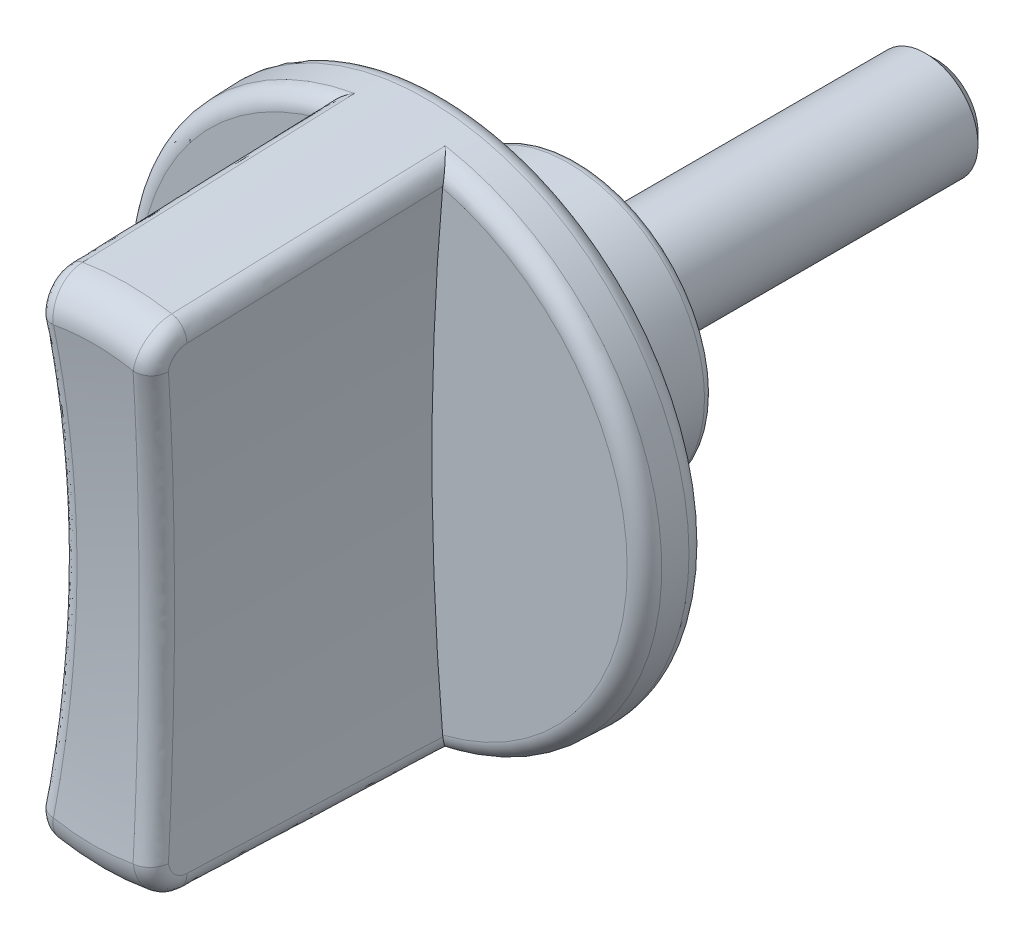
ISO-10303-21;
HEADER;
FILE_DESCRIPTION(('STEP AP214'),'2;1');
FILE_NAME('part.step','',(''),(''),'','','');
FILE_SCHEMA(('AUTOMOTIVE_DESIGN { 1 0 10303 214 1 1 1 1 }'));
ENDSEC;
DATA;
#1=APPLICATION_CONTEXT('core data for automotive mechanical design processes');
#2=APPLICATION_PROTOCOL_DEFINITION('international standard','automotive_design',2000,#1);
#3=PRODUCT_CONTEXT('',#1,'mechanical');
#4=PRODUCT('Part','Part','',(#3));
#5=PRODUCT_RELATED_PRODUCT_CATEGORY('part','',(#4));
#6=PRODUCT_DEFINITION_FORMATION('','',#4);
#7=PRODUCT_DEFINITION_CONTEXT('part definition',#1,'design');
#8=PRODUCT_DEFINITION('design','',#6,#7);
#9=PRODUCT_DEFINITION_SHAPE('','',#8);
#10=(LENGTH_UNIT() NAMED_UNIT(*) SI_UNIT(.MILLI.,.METRE.));
#11=(NAMED_UNIT(*) PLANE_ANGLE_UNIT() SI_UNIT($,.RADIAN.));
#12=(NAMED_UNIT(*) SI_UNIT($,.STERADIAN.) SOLID_ANGLE_UNIT());
#13=UNCERTAINTY_MEASURE_WITH_UNIT(LENGTH_MEASURE(1.E-05),#10,'distance_accuracy_value','');
#14=(GEOMETRIC_REPRESENTATION_CONTEXT(3) GLOBAL_UNCERTAINTY_ASSIGNED_CONTEXT((#13)) GLOBAL_UNIT_ASSIGNED_CONTEXT((#10,
#11,#12)) REPRESENTATION_CONTEXT('',''));
#15=CARTESIAN_POINT('',(0.,0.,0.));
#16=DIRECTION('',(0.,0.,1.));
#17=DIRECTION('',(1.,0.,0.));
#18=AXIS2_PLACEMENT_3D('',#15,#16,#17);
#19=CARTESIAN_POINT('',(0.,0.,9.0348994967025));
#20=DIRECTION('',(0.,0.,-1.));
#21=DIRECTION('',(-1.,0.,0.));
#22=AXIS2_PLACEMENT_3D('',#19,#20,#21);
#23=CONICAL_SURFACE('',#22,14.9638605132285,0.0349065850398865);
#24=CARTESIAN_POINT('',(0.,0.,26.069798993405));
#25=DIRECTION('',(0.,0.,1.));
#26=DIRECTION('',(1.,0.,0.));
#27=AXIS2_PLACEMENT_3D('',#24,#25,#26);
#28=CIRCLE('',#27,14.3689887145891);
#29=CARTESIAN_POINT('',(-2.54030019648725,-14.1426557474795,26.069798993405));
#30=VERTEX_POINT('',#29);
#31=CARTESIAN_POINT('',(2.54030019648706,-14.1426557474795,26.069798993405));
#32=VERTEX_POINT('',#31);
#33=EDGE_CURVE('E164',#30,#32,#28,.T.);
#34=ORIENTED_EDGE('',*,*,#33,.F.);
#35=CARTESIAN_POINT('',(-3.28407586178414,-12.1751022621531,51.8564925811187));
#36=CARTESIAN_POINT('',(-3.3572269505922,-13.0733664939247,51.8881330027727));
#37=CARTESIAN_POINT('',(-2.47072494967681,-13.2386977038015,51.8913920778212));
#38=CARTESIAN_POINT('',(-3.29625817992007,-12.3246956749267,47.5528971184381));
#39=CARTESIAN_POINT('',(-3.37048679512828,-13.2250692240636,47.5802777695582));
#40=CARTESIAN_POINT('',(-2.481761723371,-13.3895173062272,47.5877966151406));
#41=CARTESIAN_POINT('',(-3.30866076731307,-12.4742191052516,43.2492998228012));
#42=CARTESIAN_POINT('',(-3.38395481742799,-13.3764900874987,43.276927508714));
#43=CARTESIAN_POINT('',(-2.49308181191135,-13.5402526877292,43.2841993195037));
#44=CARTESIAN_POINT('',(-3.33390648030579,-12.773135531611,34.6421019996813));
#45=CARTESIAN_POINT('',(-3.4113347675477,-13.6791188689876,34.6698226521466));
#46=CARTESIAN_POINT('',(-2.51627732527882,-13.8415677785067,34.6770014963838));
#47=CARTESIAN_POINT('',(-3.34674960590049,-12.922528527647,30.3385014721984));
#48=CARTESIAN_POINT('',(-3.42524621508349,-13.8303115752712,30.3664881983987));
#49=CARTESIAN_POINT('',(-2.52815275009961,-13.992147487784,30.3734009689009));
#50=CARTESIAN_POINT('',(-3.37287639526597,-13.2211936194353,21.7312975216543));
#51=CARTESIAN_POINT('',(-3.45351306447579,-14.132503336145,21.7593974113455));
#52=CARTESIAN_POINT('',(-2.55244764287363,-14.2931640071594,21.7661970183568));
#53=CARTESIAN_POINT('',(-3.3861600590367,-13.3704657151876,17.4276940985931));
#54=CARTESIAN_POINT('',(-3.46786803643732,-14.2834886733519,17.4560208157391));
#55=CARTESIAN_POINT('',(-2.56486711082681,-14.4436008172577,17.4625935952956));
#56=CARTESIAN_POINT('',(-3.41316792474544,-13.66889656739,8.8204846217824));
#57=CARTESIAN_POINT('',(-3.49702180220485,-14.5852775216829,8.84893399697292));
#58=CARTESIAN_POINT('',(-2.59024087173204,-14.7443416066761,8.8553841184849));
#59=CARTESIAN_POINT('',(-3.42689212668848,-13.8180553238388,4.51687856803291));
#60=CARTESIAN_POINT('',(-3.51182020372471,-14.7360685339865,4.54557049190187));
#61=CARTESIAN_POINT('',(-2.6031951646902,-14.8946455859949,4.55177806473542));
#62=CARTESIAN_POINT('',(-3.44083659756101,-13.9671611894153,0.213271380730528));
#63=CARTESIAN_POINT('',(-3.5268279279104,-14.886650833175,0.24562150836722));
#64=CARTESIAN_POINT('',(-2.61641226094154,-15.0448881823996,0.248170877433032));
#65=(BOUNDED_SURFACE() B_SPLINE_SURFACE(3,2,((#35,#36,#37),(#38,#39,#40),(#41,#42,#43),(#44,#45,
#46),(#47,#48,#49),(#50,#51,#52),(#53,#54,#55),(#56,#57,#58),(#59,#60,#61),(#62,#63,#64)),
.UNSPECIFIED.,.F.,.F.,.F.) B_SPLINE_SURFACE_WITH_KNOTS((4,2,2,2,4),(3,3),(0.,12.9187405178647,
25.8374808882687,38.7562212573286,51.6749617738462),(0.,1.),
.UNSPECIFIED.) GEOMETRIC_REPRESENTATION_ITEM() RATIONAL_B_SPLINE_SURFACE(((1.,0.742631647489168,
1.),(1.,0.741878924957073,1.),(1.,0.74114605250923,1.),(1.,0.739716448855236,1.),(1.,
0.739019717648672,1.),(1.,0.737658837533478,1.),(1.,0.736994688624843,1.),(1.,0.735696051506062,
1.),(1.,0.735061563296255,1.),(1.,0.73444044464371,1.))) REPRESENTATION_ITEM('') SURFACE());
#66=CARTESIAN_POINT('',(-2.47072494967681,-13.2386977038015,51.8913920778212));
#67=CARTESIAN_POINT('',(-2.481761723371,-13.3895173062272,47.5877966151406));
#68=CARTESIAN_POINT('',(-2.49308181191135,-13.5402526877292,43.2841993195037));
#69=CARTESIAN_POINT('',(-2.51627732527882,-13.8415677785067,34.6770014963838));
#70=CARTESIAN_POINT('',(-2.52815275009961,-13.992147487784,30.3734009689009));
#71=CARTESIAN_POINT('',(-2.55244764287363,-14.2931640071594,21.7661970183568));
#72=CARTESIAN_POINT('',(-2.56486711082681,-14.4436008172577,17.4625935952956));
#73=CARTESIAN_POINT('',(-2.59024087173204,-14.7443416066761,8.8553841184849));
#74=CARTESIAN_POINT('',(-2.6031951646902,-14.8946455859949,4.5517780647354));
#75=CARTESIAN_POINT('',(-2.61641226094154,-15.0448881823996,0.248170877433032));
#76=B_SPLINE_CURVE_WITH_KNOTS('',3,(#66,#67,#68,#69,#70,#71,#72,#73,#74,#75),.UNSPECIFIED.,.F.,
.F.,(4,2,2,2,4),(0.,12.9187405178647,25.8374808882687,38.7562212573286,51.6749617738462),.UNSPECIFIED.);
#77=CARTESIAN_POINT('',(-2.58532278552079,-14.6856502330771,10.5348994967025));
#78=VERTEX_POINT('',#77);
#79=EDGE_CURVE('E454',#30,#78,#76,.T.);
#80=ORIENTED_EDGE('',*,*,#79,.T.);
#81=CARTESIAN_POINT('',(0.,0.,10.5348994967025));
#82=DIRECTION('',(0.,0.,-1.));
#83=DIRECTION('',(-1.,0.,0.));
#84=AXIS2_PLACEMENT_3D('',#81,#82,#83);
#85=CIRCLE('',#84,14.9114793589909);
#86=CARTESIAN_POINT('',(-2.58532278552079,14.6856502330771,10.5348994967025));
#87=VERTEX_POINT('',#86);
#88=EDGE_CURVE('E460',#78,#87,#85,.T.);
#89=ORIENTED_EDGE('',*,*,#88,.T.);
#90=CARTESIAN_POINT('',(-2.47072494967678,13.2386977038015,51.8913920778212));
#91=CARTESIAN_POINT('',(-3.35722695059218,13.0733664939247,51.8881330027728));
#92=CARTESIAN_POINT('',(-3.28407586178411,12.1751022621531,51.8564925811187));
#93=CARTESIAN_POINT('',(-2.48176172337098,13.3895173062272,47.5877966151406));
#94=CARTESIAN_POINT('',(-3.37048679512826,13.2250692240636,47.5802777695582));
#95=CARTESIAN_POINT('',(-3.29625817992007,12.3246956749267,47.5528971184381));
#96=CARTESIAN_POINT('',(-2.49308181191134,13.5402526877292,43.2841993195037));
#97=CARTESIAN_POINT('',(-3.38395481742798,13.3764900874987,43.276927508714));
#98=CARTESIAN_POINT('',(-3.30866076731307,12.4742191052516,43.2492998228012));
#99=CARTESIAN_POINT('',(-2.51627732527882,13.8415677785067,34.6770014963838));
#100=CARTESIAN_POINT('',(-3.4113347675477,13.6791188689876,34.6698226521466));
#101=CARTESIAN_POINT('',(-3.33390648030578,12.773135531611,34.6421019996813));
#102=CARTESIAN_POINT('',(-2.5281527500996,13.992147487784,30.3734009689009));
#103=CARTESIAN_POINT('',(-3.42524621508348,13.8303115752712,30.3664881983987));
#104=CARTESIAN_POINT('',(-3.34674960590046,12.922528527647,30.3385014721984));
#105=CARTESIAN_POINT('',(-2.55244764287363,14.2931640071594,21.7661970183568));
#106=CARTESIAN_POINT('',(-3.45351306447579,14.132503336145,21.7593974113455));
#107=CARTESIAN_POINT('',(-3.37287639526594,13.2211936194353,21.7312975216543));
#108=CARTESIAN_POINT('',(-2.56486711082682,14.4436008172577,17.4625935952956));
#109=CARTESIAN_POINT('',(-3.46786803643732,14.2834886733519,17.4560208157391));
#110=CARTESIAN_POINT('',(-3.38616005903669,13.3704657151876,17.4276940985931));
#111=CARTESIAN_POINT('',(-2.59024087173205,14.7443416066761,8.8553841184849));
#112=CARTESIAN_POINT('',(-3.49702180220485,14.5852775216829,8.84893399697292));
#113=CARTESIAN_POINT('',(-3.41316792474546,13.66889656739,8.8204846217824));
#114=CARTESIAN_POINT('',(-2.6031951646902,14.8946455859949,4.55177806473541));
#115=CARTESIAN_POINT('',(-3.51182020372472,14.7360685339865,4.54557049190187));
#116=CARTESIAN_POINT('',(-3.4268921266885,13.8180553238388,4.51687856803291));
#117=CARTESIAN_POINT('',(-2.61641226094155,15.0448881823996,0.248170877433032));
#118=CARTESIAN_POINT('',(-3.52682792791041,14.886650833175,0.24562150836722));
#119=CARTESIAN_POINT('',(-3.44083659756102,13.9671611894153,0.213271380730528));
#120=(BOUNDED_SURFACE() B_SPLINE_SURFACE(3,2,((#90,#91,#92),(#93,#94,#95),(#96,#97,#98),(#99,
#100,#101),(#102,#103,#104),(#105,#106,#107),(#108,#109,#110),(#111,#112,#113),(#114,#115,#116),
(#117,#118,#119)),.UNSPECIFIED.,.F.,.F.,.F.) B_SPLINE_SURFACE_WITH_KNOTS((4,2,2,2,4),(3,3),(0.,
12.9187405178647,25.8374808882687,38.7562212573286,51.6749617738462),(0.,1.),
.UNSPECIFIED.) GEOMETRIC_REPRESENTATION_ITEM() RATIONAL_B_SPLINE_SURFACE(((1.,0.742631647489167,
1.),(1.,0.741878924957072,1.),(1.,0.741146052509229,1.),(1.,0.739716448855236,1.),(1.,
0.739019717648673,1.),(1.,0.737658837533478,1.),(1.,0.736994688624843,1.),(1.,0.735696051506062,
1.),(1.,0.735061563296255,1.),(1.,0.73444044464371,1.))) REPRESENTATION_ITEM('') SURFACE());
#121=CARTESIAN_POINT('',(-2.61641226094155,15.0448881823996,0.248170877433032));
#122=CARTESIAN_POINT('',(-2.6031951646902,14.8946455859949,4.5517780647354));
#123=CARTESIAN_POINT('',(-2.59024087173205,14.7443416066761,8.8553841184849));
#124=CARTESIAN_POINT('',(-2.56486711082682,14.4436008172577,17.4625935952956));
#125=CARTESIAN_POINT('',(-2.55244764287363,14.2931640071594,21.7661970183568));
#126=CARTESIAN_POINT('',(-2.5281527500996,13.992147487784,30.3734009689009));
#127=CARTESIAN_POINT('',(-2.51627732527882,13.8415677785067,34.6770014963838));
#128=CARTESIAN_POINT('',(-2.49308181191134,13.5402526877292,43.2841993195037));
#129=CARTESIAN_POINT('',(-2.48176172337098,13.3895173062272,47.5877966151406));
#130=CARTESIAN_POINT('',(-2.47072494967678,13.2386977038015,51.8913920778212));
#131=B_SPLINE_CURVE_WITH_KNOTS('',3,(#121,#122,#123,#124,#125,#126,#127,#128,#129,#130),
.UNSPECIFIED.,.F.,.F.,(4,2,2,2,4),(0.,12.9187405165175,25.8374808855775,38.7562212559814,
51.6749617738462),.UNSPECIFIED.);
#132=CARTESIAN_POINT('',(-2.54030019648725,14.1426557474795,26.069798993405));
#133=VERTEX_POINT('',#132);
#134=EDGE_CURVE('E145',#87,#133,#131,.T.);
#135=ORIENTED_EDGE('',*,*,#134,.T.);
#136=CARTESIAN_POINT('',(2.54030019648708,14.1426557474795,26.069798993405));
#137=VERTEX_POINT('',#136);
#138=EDGE_CURVE('E152',#137,#133,#28,.T.);
#139=ORIENTED_EDGE('',*,*,#138,.F.);
#140=CARTESIAN_POINT('',(3.28407586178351,12.1751022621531,51.8564925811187));
#141=CARTESIAN_POINT('',(3.35722695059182,13.0733664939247,51.8881330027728));
#142=CARTESIAN_POINT('',(2.47072494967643,13.2386977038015,51.8913920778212));
#143=CARTESIAN_POINT('',(3.2962581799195,12.3246956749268,47.5528971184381));
#144=CARTESIAN_POINT('',(3.37048679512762,13.2250692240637,47.5802777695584));
#145=CARTESIAN_POINT('',(2.48176172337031,13.3895173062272,47.5877966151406));
#146=CARTESIAN_POINT('',(3.30866076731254,12.4742191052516,43.2492998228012));
#147=CARTESIAN_POINT('',(3.38395481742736,13.3764900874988,43.2769275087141));
#148=CARTESIAN_POINT('',(2.49308181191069,13.5402526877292,43.2841993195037));
#149=CARTESIAN_POINT('',(3.33390648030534,12.773135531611,34.6421019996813));
#150=CARTESIAN_POINT('',(3.4113347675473,13.6791188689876,34.6698226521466));
#151=CARTESIAN_POINT('',(2.5162773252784,13.8415677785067,34.6770014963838));
#152=CARTESIAN_POINT('',(3.34674960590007,12.922528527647,30.3385014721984));
#153=CARTESIAN_POINT('',(3.42524621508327,13.8303115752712,30.3664881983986));
#154=CARTESIAN_POINT('',(2.52815275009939,13.992147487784,30.3734009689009));
#155=CARTESIAN_POINT('',(3.3728763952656,13.2211936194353,21.7312975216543));
#156=CARTESIAN_POINT('',(3.45351306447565,14.132503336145,21.7593974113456));
#157=CARTESIAN_POINT('',(2.55244764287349,14.2931640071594,21.7661970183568));
#158=CARTESIAN_POINT('',(3.38616005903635,13.3704657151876,17.4276940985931));
#159=CARTESIAN_POINT('',(3.46786803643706,14.2834886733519,17.4560208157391));
#160=CARTESIAN_POINT('',(2.56486711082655,14.4436008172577,17.4625935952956));
#161=CARTESIAN_POINT('',(3.41316792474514,13.66889656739,8.82048462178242));
#162=CARTESIAN_POINT('',(3.4970218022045,14.585277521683,8.84893399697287));
#163=CARTESIAN_POINT('',(2.59024087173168,14.7443416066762,8.85538411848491));
#164=CARTESIAN_POINT('',(3.4268921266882,13.8180553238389,4.51687856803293));
#165=CARTESIAN_POINT('',(3.5118202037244,14.7360685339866,4.54557049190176));
#166=CARTESIAN_POINT('',(2.60319516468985,14.8946455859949,4.55177806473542));
#167=CARTESIAN_POINT('',(3.44083659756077,13.9671611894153,0.213271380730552));
#168=CARTESIAN_POINT('',(3.52682792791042,14.886650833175,0.245621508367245));
#169=CARTESIAN_POINT('',(2.61641226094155,15.0448881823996,0.24817087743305));
#170=(BOUNDED_SURFACE() B_SPLINE_SURFACE(3,2,((#140,#141,#142),(#143,#144,#145),(#146,#147,
#148),(#149,#150,#151),(#152,#153,#154),(#155,#156,#157),(#158,#159,#160),(#161,#162,#163),
(#164,#165,#166),(#167,#168,#169)),.UNSPECIFIED.,.F.,.F.,.F.) B_SPLINE_SURFACE_WITH_KNOTS((4,2,
2,2,4),(3,3),(0.,12.9187405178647,25.8374808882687,38.7562212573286,51.6749617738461),(0.,1.),
.UNSPECIFIED.) GEOMETRIC_REPRESENTATION_ITEM() RATIONAL_B_SPLINE_SURFACE(((1.,0.742631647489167,
1.),(1.,0.741878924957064,1.),(1.,0.741146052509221,1.),(1.,0.739716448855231,1.),(1.,
0.739019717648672,1.),(1.,0.737658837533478,1.),(1.,0.73699468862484,1.),(1.,0.735696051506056,
1.),(1.,0.735061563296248,1.),(1.,0.73444044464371,1.))) REPRESENTATION_ITEM('') SURFACE());
#171=CARTESIAN_POINT('',(2.47072494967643,13.2386977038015,51.8913920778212));
#172=CARTESIAN_POINT('',(2.48176172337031,13.3895173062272,47.5877966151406));
#173=CARTESIAN_POINT('',(2.49308181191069,13.5402526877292,43.2841993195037));
#174=CARTESIAN_POINT('',(2.5162773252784,13.8415677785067,34.6770014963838));
#175=CARTESIAN_POINT('',(2.52815275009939,13.992147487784,30.3734009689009));
#176=CARTESIAN_POINT('',(2.55244764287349,14.2931640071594,21.7661970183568));
#177=CARTESIAN_POINT('',(2.56486711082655,14.4436008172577,17.4625935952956));
#178=CARTESIAN_POINT('',(2.59024087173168,14.7443416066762,8.8553841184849));
#179=CARTESIAN_POINT('',(2.60319516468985,14.8946455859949,4.55177806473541));
#180=CARTESIAN_POINT('',(2.61641226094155,15.0448881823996,0.24817087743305));
#181=B_SPLINE_CURVE_WITH_KNOTS('',3,(#171,#172,#173,#174,#175,#176,#177,#178,#179,#180),
.UNSPECIFIED.,.F.,.F.,(4,2,2,2,4),(0.,12.9187405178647,25.8374808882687,38.7562212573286,
51.6749617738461),.UNSPECIFIED.);
#182=CARTESIAN_POINT('',(2.58532278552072,14.6856502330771,10.5348994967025));
#183=VERTEX_POINT('',#182);
#184=EDGE_CURVE('E138',#137,#183,#181,.T.);
#185=ORIENTED_EDGE('',*,*,#184,.T.);
#186=CARTESIAN_POINT('',(0.,0.,10.5348994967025));
#187=DIRECTION('',(0.,0.,-1.));
#188=DIRECTION('',(-1.,0.,0.));
#189=AXIS2_PLACEMENT_3D('',#186,#187,#188);
#190=CIRCLE('',#189,14.9114793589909);
#191=CARTESIAN_POINT('',(2.58532278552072,-14.6856502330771,10.5348994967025));
#192=VERTEX_POINT('',#191);
#193=EDGE_CURVE('E146',#183,#192,#190,.T.);
#194=ORIENTED_EDGE('',*,*,#193,.T.);
#195=CARTESIAN_POINT('',(2.47072494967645,-13.2386977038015,51.8913920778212));
#196=CARTESIAN_POINT('',(3.35722695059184,-13.0733664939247,51.8881330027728));
#197=CARTESIAN_POINT('',(3.28407586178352,-12.1751022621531,51.8564925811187));
#198=CARTESIAN_POINT('',(2.48176172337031,-13.3895173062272,47.5877966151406));
#199=CARTESIAN_POINT('',(3.37048679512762,-13.2250692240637,47.5802777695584));
#200=CARTESIAN_POINT('',(3.29625817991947,-12.3246956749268,47.5528971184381));
#201=CARTESIAN_POINT('',(2.49308181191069,-13.5402526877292,43.2841993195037));
#202=CARTESIAN_POINT('',(3.38395481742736,-13.3764900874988,43.2769275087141));
#203=CARTESIAN_POINT('',(3.30866076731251,-12.4742191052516,43.2492998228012));
#204=CARTESIAN_POINT('',(2.5162773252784,-13.8415677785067,34.6770014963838));
#205=CARTESIAN_POINT('',(3.41133476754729,-13.6791188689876,34.6698226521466));
#206=CARTESIAN_POINT('',(3.33390648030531,-12.773135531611,34.6421019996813));
#207=CARTESIAN_POINT('',(2.52815275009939,-13.992147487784,30.3734009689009));
#208=CARTESIAN_POINT('',(3.42524621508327,-13.8303115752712,30.3664881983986));
#209=CARTESIAN_POINT('',(3.34674960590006,-12.922528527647,30.3385014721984));
#210=CARTESIAN_POINT('',(2.55244764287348,-14.2931640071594,21.7661970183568));
#211=CARTESIAN_POINT('',(3.45351306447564,-14.132503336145,21.7593974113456));
#212=CARTESIAN_POINT('',(3.37287639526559,-13.2211936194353,21.7312975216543));
#213=CARTESIAN_POINT('',(2.56486711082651,-14.4436008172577,17.4625935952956));
#214=CARTESIAN_POINT('',(3.46786803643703,-14.2834886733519,17.4560208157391));
#215=CARTESIAN_POINT('',(3.38616005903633,-13.3704657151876,17.4276940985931));
#216=CARTESIAN_POINT('',(2.59024087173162,-14.7443416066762,8.85538411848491));
#217=CARTESIAN_POINT('',(3.49702180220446,-14.585277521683,8.84893399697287));
#218=CARTESIAN_POINT('',(3.41316792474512,-13.6688965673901,8.82048462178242));
#219=CARTESIAN_POINT('',(2.60319516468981,-14.8946455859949,4.55177806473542));
#220=CARTESIAN_POINT('',(3.51182020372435,-14.7360685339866,4.54557049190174));
#221=CARTESIAN_POINT('',(3.4268921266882,-13.8180553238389,4.51687856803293));
#222=CARTESIAN_POINT('',(2.61641226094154,-15.0448881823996,0.24817087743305));
#223=CARTESIAN_POINT('',(3.5268279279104,-14.886650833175,0.245621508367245));
#224=CARTESIAN_POINT('',(3.44083659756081,-13.9671611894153,0.213271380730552));
#225=(BOUNDED_SURFACE() B_SPLINE_SURFACE(3,2,((#195,#196,#197),(#198,#199,#200),(#201,#202,
#203),(#204,#205,#206),(#207,#208,#209),(#210,#211,#212),(#213,#214,#215),(#216,#217,#218),
(#219,#220,#221),(#222,#223,#224)),.UNSPECIFIED.,.F.,.F.,.F.) B_SPLINE_SURFACE_WITH_KNOTS((4,2,
2,2,4),(3,3),(0.,12.9187405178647,25.8374808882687,38.7562212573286,51.6749617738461),(0.,1.),
.UNSPECIFIED.) GEOMETRIC_REPRESENTATION_ITEM() RATIONAL_B_SPLINE_SURFACE(((1.,0.742631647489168,
1.),(1.,0.741878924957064,1.),(1.,0.74114605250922,1.),(1.,0.739716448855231,1.),(1.,
0.739019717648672,1.),(1.,0.737658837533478,1.),(1.,0.736994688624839,1.),(1.,0.735696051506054,
1.),(1.,0.735061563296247,1.),(1.,0.73444044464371,1.))) REPRESENTATION_ITEM('') SURFACE());
#226=CARTESIAN_POINT('',(2.61641226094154,-15.0448881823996,0.24817087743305));
#227=CARTESIAN_POINT('',(2.60319516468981,-14.8946455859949,4.55177806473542));
#228=CARTESIAN_POINT('',(2.59024087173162,-14.7443416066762,8.85538411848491));
#229=CARTESIAN_POINT('',(2.56486711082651,-14.4436008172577,17.4625935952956));
#230=CARTESIAN_POINT('',(2.55244764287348,-14.2931640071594,21.7661970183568));
#231=CARTESIAN_POINT('',(2.52815275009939,-13.992147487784,30.3734009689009));
#232=CARTESIAN_POINT('',(2.5162773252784,-13.8415677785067,34.6770014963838));
#233=CARTESIAN_POINT('',(2.49308181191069,-13.5402526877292,43.2841993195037));
#234=CARTESIAN_POINT('',(2.48176172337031,-13.3895173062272,47.5877966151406));
#235=CARTESIAN_POINT('',(2.47072494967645,-13.2386977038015,51.8913920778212));
#236=B_SPLINE_CURVE_WITH_KNOTS('',3,(#226,#227,#228,#229,#230,#231,#232,#233,#234,#235),
.UNSPECIFIED.,.F.,.F.,(4,2,2,2,4),(0.,12.9187405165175,25.8374808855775,38.7562212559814,
51.6749617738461),.UNSPECIFIED.);
#237=EDGE_CURVE('E478',#192,#32,#236,.T.);
#238=ORIENTED_EDGE('',*,*,#237,.T.);
#239=EDGE_LOOP('',(#34,#80,#89,#135,#139,#185,#194,#238));
#240=FACE_BOUND('',#239,.T.);
#241=CARTESIAN_POINT('',(0.,0.,9.0348994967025));
#242=DIRECTION('',(0.,0.,1.));
#243=DIRECTION('',(1.,0.,0.));
#244=AXIS2_PLACEMENT_3D('',#241,#242,#243);
#245=CIRCLE('',#244,14.9638605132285);
#246=CARTESIAN_POINT('',(14.9638605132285,0.,9.03489949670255));
#247=VERTEX_POINT('',#246);
#248=EDGE_CURVE('E163',#247,#247,#245,.T.);
#249=ORIENTED_EDGE('',*,*,#248,.T.);
#250=EDGE_LOOP('',(#249));
#251=FACE_BOUND('',#250,.T.);
#252=ADVANCED_FACE('F14',(#240,#251),#23,.T.);
#253=CARTESIAN_POINT('',(0.,0.,26.));
#254=DIRECTION('',(0.,0.,1.));
#255=DIRECTION('',(1.,0.,0.));
#256=AXIS2_PLACEMENT_3D('',#253,#254,#255);
#257=TOROIDAL_SURFACE('',#256,12.3702070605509,2.);
#258=CARTESIAN_POINT('',(-5.10022096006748,26.2293832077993,30.1580238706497));
#259=CARTESIAN_POINT('',(-5.04919899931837,25.9420955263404,31.1080364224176));
#260=CARTESIAN_POINT('',(-4.07040142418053,26.1140892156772,31.1139337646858));
#261=CARTESIAN_POINT('',(-4.91107231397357,25.1644836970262,29.8236073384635));
#262=CARTESIAN_POINT('',(-4.86389549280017,24.8867519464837,30.7789353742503));
#263=CARTESIAN_POINT('',(-3.88208420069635,25.0538705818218,30.7831921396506));
#264=CARTESIAN_POINT('',(-4.73239782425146,24.0913982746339,29.509585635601));
#265=CARTESIAN_POINT('',(-4.6891052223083,23.8247402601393,30.4703352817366));
#266=CARTESIAN_POINT('',(-3.70419509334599,23.985502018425,30.4726212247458));
#267=CARTESIAN_POINT('',(-4.39697538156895,21.9307162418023,28.922845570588));
#268=CARTESIAN_POINT('',(-4.36095056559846,21.6864324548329,29.8936616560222));
#269=CARTESIAN_POINT('',(-3.37024703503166,21.8343174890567,29.892328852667));
#270=CARTESIAN_POINT('',(-4.24022820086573,20.8431191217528,28.6501286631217));
#271=CARTESIAN_POINT('',(-4.20766672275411,20.6103663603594,29.6257351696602));
#272=CARTESIAN_POINT('',(-3.21418885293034,20.7515010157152,29.6226088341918));
#273=CARTESIAN_POINT('',(-3.94963897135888,18.6552510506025,28.1465128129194));
#274=CARTESIAN_POINT('',(-3.92346310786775,18.4457423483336,29.1308863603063));
#275=CARTESIAN_POINT('',(-2.92487693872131,18.5732499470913,29.1245272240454));
#276=CARTESIAN_POINT('',(-3.81579898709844,17.5549789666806,27.9156176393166));
#277=CARTESIAN_POINT('',(-3.79261814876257,17.3574384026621,28.9040978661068));
#278=CARTESIAN_POINT('',(-2.79162526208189,17.4778142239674,28.8961693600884));
#279=CARTESIAN_POINT('',(-3.57185939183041,15.3439948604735,27.4961236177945));
#280=CARTESIAN_POINT('',(-3.55410366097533,15.1704760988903,28.4919953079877));
#281=CARTESIAN_POINT('',(-2.54875792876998,15.2765487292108,28.4812851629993));
#282=CARTESIAN_POINT('',(-3.46175936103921,14.2332830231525,27.307524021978));
#283=CARTESIAN_POINT('',(-3.44649739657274,14.0720941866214,28.3067925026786));
#284=CARTESIAN_POINT('',(-2.43914185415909,14.1707191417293,28.2947580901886));
#285=CARTESIAN_POINT('',(-3.17384143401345,10.9534047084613,26.8154875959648));
#286=CARTESIAN_POINT('',(-3.16488899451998,10.8268209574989,27.8232430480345));
#287=CARTESIAN_POINT('',(-2.15248950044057,10.9052578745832,27.808128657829));
#288=CARTESIAN_POINT('',(-3.02984120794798,8.77210691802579,26.5710741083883));
#289=CARTESIAN_POINT('',(-3.02430957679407,8.67116249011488,27.5834882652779));
#290=CARTESIAN_POINT('',(-2.00912224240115,8.73354820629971,27.5664010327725));
#291=CARTESIAN_POINT('',(-2.83750095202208,4.39387142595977,26.2450475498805));
#292=CARTESIAN_POINT('',(-2.83634308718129,4.34250856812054,27.2633382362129));
#293=CARTESIAN_POINT('',(-1.81762743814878,4.3745577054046,27.2439571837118));
#294=CARTESIAN_POINT('',(-2.78914896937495,2.19693571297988,26.1634141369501));
#295=CARTESIAN_POINT('',(-2.78914896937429,2.17185387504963,27.1832722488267));
#296=CARTESIAN_POINT('',(-1.76948799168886,2.1872788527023,27.1632208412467));
#297=CARTESIAN_POINT('',(-2.78914896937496,-2.1969357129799,26.1634141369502));
#298=CARTESIAN_POINT('',(-2.78914896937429,-2.17185387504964,27.1832722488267));
#299=CARTESIAN_POINT('',(-1.76948799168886,-2.18727885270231,27.1632208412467));
#300=CARTESIAN_POINT('',(-2.83750095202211,-4.3938714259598,26.2450475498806));
#301=CARTESIAN_POINT('',(-2.83634308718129,-4.34250856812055,27.2633382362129));
#302=CARTESIAN_POINT('',(-1.81762743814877,-4.37455770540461,27.2439571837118));
#303=CARTESIAN_POINT('',(-3.02984120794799,-8.77210691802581,26.5710741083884));
#304=CARTESIAN_POINT('',(-3.02430957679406,-8.6711624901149,27.583488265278));
#305=CARTESIAN_POINT('',(-2.00912224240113,-8.73354820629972,27.5664010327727));
#306=CARTESIAN_POINT('',(-3.17384143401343,-10.9534047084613,26.8154875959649));
#307=CARTESIAN_POINT('',(-3.16488899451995,-10.8268209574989,27.8232430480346));
#308=CARTESIAN_POINT('',(-2.15248950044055,-10.9052578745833,27.8081286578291));
#309=CARTESIAN_POINT('',(-3.4617593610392,-14.2332830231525,27.3075240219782));
#310=CARTESIAN_POINT('',(-3.44649739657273,-14.0720941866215,28.3067925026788));
#311=CARTESIAN_POINT('',(-2.43914185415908,-14.1707191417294,28.2947580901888));
#312=CARTESIAN_POINT('',(-3.5718593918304,-15.3439948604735,27.4961236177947));
#313=CARTESIAN_POINT('',(-3.55410366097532,-15.1704760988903,28.4919953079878));
#314=CARTESIAN_POINT('',(-2.54875792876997,-15.2765487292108,28.4812851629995));
#315=CARTESIAN_POINT('',(-3.81579898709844,-17.5549789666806,27.9156176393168));
#316=CARTESIAN_POINT('',(-3.79261814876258,-17.3574384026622,28.904097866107));
#317=CARTESIAN_POINT('',(-2.7916252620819,-17.4778142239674,28.8961693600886));
#318=CARTESIAN_POINT('',(-3.94963897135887,-18.6552510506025,28.1465128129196));
#319=CARTESIAN_POINT('',(-3.92346310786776,-18.4457423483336,29.1308863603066));
#320=CARTESIAN_POINT('',(-2.92487693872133,-18.5732499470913,29.1245272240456));
#321=CARTESIAN_POINT('',(-4.24022820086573,-20.8431191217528,28.650128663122));
#322=CARTESIAN_POINT('',(-4.20766672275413,-20.6103663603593,29.6257351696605));
#323=CARTESIAN_POINT('',(-3.21418885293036,-20.7515010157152,29.622608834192));
#324=CARTESIAN_POINT('',(-4.39697538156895,-21.9307162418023,28.9228455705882));
#325=CARTESIAN_POINT('',(-4.36095056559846,-21.6864324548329,29.8936616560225));
#326=CARTESIAN_POINT('',(-3.37024703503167,-21.8343174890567,29.8923288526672));
#327=CARTESIAN_POINT('',(-4.73239782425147,-24.0913982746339,29.5095856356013));
#328=CARTESIAN_POINT('',(-4.6891052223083,-23.8247402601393,30.4703352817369));
#329=CARTESIAN_POINT('',(-3.70419509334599,-23.985502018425,30.4726212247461));
#330=CARTESIAN_POINT('',(-4.91107231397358,-25.1644836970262,29.8236073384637));
#331=CARTESIAN_POINT('',(-4.86389549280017,-24.8867519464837,30.7789353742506));
#332=CARTESIAN_POINT('',(-3.88208420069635,-25.0538705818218,30.7831921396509));
#333=CARTESIAN_POINT('',(-5.10022096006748,-26.2293832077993,30.15802387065));
#334=CARTESIAN_POINT('',(-5.0491989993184,-25.9420955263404,31.1080364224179));
#335=CARTESIAN_POINT('',(-4.07040142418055,-26.1140892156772,31.1139337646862));
#336=(BOUNDED_SURFACE() B_SPLINE_SURFACE(3,2,((#258,#259,#260),(#261,#262,#263),(#264,#265,
#266),(#267,#268,#269),(#270,#271,#272),(#273,#274,#275),(#276,#277,#278),(#279,#280,#281),
(#282,#283,#284),(#285,#286,#287),(#288,#289,#290),(#291,#292,#293),(#294,#295,#296),(#297,#298,
#299),(#300,#301,#302),(#303,#304,#305),(#306,#307,#308),(#309,#310,#311),(#312,#313,#314),
(#315,#316,#317),(#318,#319,#320),(#321,#322,#323),(#324,#325,#326),(#327,#328,#329),(#330,#331,
#332),(#333,#334,#335)),.UNSPECIFIED.,.F.,.F.,.F.) B_SPLINE_SURFACE_WITH_KNOTS((4,2,2,2,2,2,2,2,
2,2,2,2,4),(3,3),(0.,3.41667725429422,6.83347481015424,10.250580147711,13.6676250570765,
20.3013017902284,26.9341494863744,33.5669971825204,40.2006739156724,43.6177188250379,
47.0348241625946,50.4516217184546,53.8682989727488),(0.,1.),
.UNSPECIFIED.) GEOMETRIC_REPRESENTATION_ITEM() RATIONAL_B_SPLINE_SURFACE(((1.,0.709298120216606,
1.),(1.,0.708551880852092,1.),(1.,0.707845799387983,1.),(1.,0.706518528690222,1.),(1.,
0.705897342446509,1.),(1.,0.704744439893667,1.),(1.,0.704212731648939,1.),(1.,0.703242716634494,
1.),(1.,0.702804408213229,1.),(1.,0.701657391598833,1.),(1.,0.701082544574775,1.),(1.,
0.700314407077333,1.),(1.,0.700121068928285,1.),(1.,0.700121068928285,1.),(1.,0.700314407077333,
1.),(1.,0.701082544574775,1.),(1.,0.701657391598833,1.),(1.,0.702804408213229,1.),(1.,
0.703242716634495,1.),(1.,0.70421273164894,1.),(1.,0.704744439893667,1.),(1.,0.70589734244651,
1.),(1.,0.706518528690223,1.),(1.,0.707845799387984,1.),(1.,0.708551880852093,1.),(1.,
0.709298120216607,1.))) REPRESENTATION_ITEM('') SURFACE());
#337=CARTESIAN_POINT('',(-2.26545380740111,-12.1609926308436,28.));
#338=CARTESIAN_POINT('',(-2.26777941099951,-12.1605218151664,28.0000000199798));
#339=CARTESIAN_POINT('',(-2.27011553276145,-12.1601298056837,28.0000000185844));
#340=CARTESIAN_POINT('',(-2.27480882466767,-12.1595033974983,27.9999999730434));
#341=CARTESIAN_POINT('',(-2.27716599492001,-12.1592689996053,27.9999999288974));
#342=CARTESIAN_POINT('',(-2.27953368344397,-12.1591134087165,27.9999998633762));
#343=B_SPLINE_CURVE_WITH_KNOTS('',3,(#337,#338,#339,#340,#341,#342),.UNSPECIFIED.,.F.,.F.,(4,2,
4),(0.,0.00710635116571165,0.01421273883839),.UNSPECIFIED.);
#344=CARTESIAN_POINT('',(-2.26545380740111,-12.1609926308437,28.));
#345=VERTEX_POINT('',#344);
#346=CARTESIAN_POINT('',(-2.27953368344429,-12.1591134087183,27.9999998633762));
#347=VERTEX_POINT('',#346);
#348=EDGE_CURVE('E436',#345,#347,#343,.T.);
#349=ORIENTED_EDGE('',*,*,#348,.T.);
#350=CARTESIAN_POINT('',(-2.53653713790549,-14.1136545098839,25.6524571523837));
#351=CARTESIAN_POINT('',(-3.43692781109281,-13.9543847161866,25.6666827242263));
#352=CARTESIAN_POINT('',(-3.35854418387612,-13.0573486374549,25.8262285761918));
#353=CARTESIAN_POINT('',(-2.53810104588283,-14.1257062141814,25.7212084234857));
#354=CARTESIAN_POINT('',(-3.43794104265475,-13.965558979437,25.7326743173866));
#355=CARTESIAN_POINT('',(-3.35907128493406,-13.0633794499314,25.8606042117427));
#356=CARTESIAN_POINT('',(-2.53919855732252,-14.1341647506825,25.7905710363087));
#357=CARTESIAN_POINT('',(-3.4386524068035,-13.9733995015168,25.7992134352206));
#358=CARTESIAN_POINT('',(-3.35944138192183,-13.0676121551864,25.8952855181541));
#359=CARTESIAN_POINT('',(-2.54045624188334,-14.1438582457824,25.9299207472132));
#360=CARTESIAN_POINT('',(-3.43946762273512,-13.9823822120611,25.932823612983));
#361=CARTESIAN_POINT('',(-3.35986559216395,-13.0724628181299,25.9649603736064));
#362=CARTESIAN_POINT('',(-2.54061493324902,-14.1450817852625,25.9999086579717));
#363=CARTESIAN_POINT('',(-3.43957072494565,-13.9835161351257,25.9999125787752));
#364=CARTESIAN_POINT('',(-3.3599192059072,-13.0730750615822,25.9999543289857));
#365=CARTESIAN_POINT('',(-2.53979595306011,-14.138768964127,26.1817711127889));
#366=CARTESIAN_POINT('',(-3.4390395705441,-13.977666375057,26.1742564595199));
#367=CARTESIAN_POINT('',(-3.35964284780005,-13.0699161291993,26.0908855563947));
#368=CARTESIAN_POINT('',(-2.53807653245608,-14.1255145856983,26.2934927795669));
#369=CARTESIAN_POINT('',(-3.43792355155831,-13.9653793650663,26.2814240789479));
#370=CARTESIAN_POINT('',(-3.3590624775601,-13.0632836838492,26.1467463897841));
#371=CARTESIAN_POINT('',(-2.53225104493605,-14.0806305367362,26.5131195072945));
#372=CARTESIAN_POINT('',(-3.43415179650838,-13.9237441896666,26.4923972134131));
#373=CARTESIAN_POINT('',(-3.3571006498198,-13.0408228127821,26.2565597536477));
#374=CARTESIAN_POINT('',(-2.52814354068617,-14.0489897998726,26.6210222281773));
#375=CARTESIAN_POINT('',(-3.43149263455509,-13.8943581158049,26.5962682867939));
#376=CARTESIAN_POINT('',(-3.35571870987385,-13.0249888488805,26.3105111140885));
#377=CARTESIAN_POINT('',(-2.51765575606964,-13.9682663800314,26.8298883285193));
#378=CARTESIAN_POINT('',(-3.42472668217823,-13.8192784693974,26.7979353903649));
#379=CARTESIAN_POINT('',(-3.352202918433,-12.9845894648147,26.4149441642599));
#380=CARTESIAN_POINT('',(-2.51127646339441,-13.9191912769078,26.9308547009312));
#381=CARTESIAN_POINT('',(-3.42061611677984,-13.7735427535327,26.895792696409));
#382=CARTESIAN_POINT('',(-3.35006939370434,-12.9600278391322,26.4654273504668));
#383=CARTESIAN_POINT('',(-2.49641729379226,-13.8050114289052,27.1230473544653));
#384=CARTESIAN_POINT('',(-3.41108321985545,-13.6668880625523,27.0829795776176));
#385=CARTESIAN_POINT('',(-3.34512397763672,-12.9028761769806,26.5615236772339));
#386=CARTESIAN_POINT('',(-2.4879372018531,-13.7399050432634,27.2142726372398));
#387=CARTESIAN_POINT('',(-3.40565474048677,-13.6058991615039,27.1723525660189));
#388=CARTESIAN_POINT('',(-3.34231201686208,-12.8702853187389,26.6071363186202));
#389=CARTESIAN_POINT('',(-2.46908943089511,-13.5954148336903,27.3845687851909));
#390=CARTESIAN_POINT('',(-3.39365068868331,-13.4701119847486,27.3404193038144));
#391=CARTESIAN_POINT('',(-3.33609996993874,-12.7979475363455,26.6922843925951));
#392=CARTESIAN_POINT('',(-2.4587185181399,-13.5160065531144,27.4636183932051));
#393=CARTESIAN_POINT('',(-3.38706594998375,-13.395206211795,27.4191191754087));
#394=CARTESIAN_POINT('',(-3.33269887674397,-12.7581883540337,26.7318091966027));
#395=CARTESIAN_POINT('',(-2.43637743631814,-13.3452616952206,27.6071770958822));
#396=CARTESIAN_POINT('',(-3.37296064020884,-13.2334658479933,27.5636105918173));
#397=CARTESIAN_POINT('',(-3.32542461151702,-12.6726847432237,26.8035885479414));
#398=CARTESIAN_POINT('',(-2.42440716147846,-13.2539243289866,27.671685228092));
#399=CARTESIAN_POINT('',(-3.3654321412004,-13.146536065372,27.6294028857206));
#400=CARTESIAN_POINT('',(-3.32155140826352,-12.6269399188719,26.835842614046));
#401=CARTESIAN_POINT('',(-2.39913642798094,-13.0615299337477,27.7846111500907));
#402=CARTESIAN_POINT('',(-3.34963230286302,-12.9624623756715,27.7465483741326));
#403=CARTESIAN_POINT('',(-3.31344101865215,-12.5305657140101,26.8923055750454));
#404=CARTESIAN_POINT('',(-2.38583073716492,-12.9604347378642,27.8329621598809));
#405=CARTESIAN_POINT('',(-3.34135028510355,-12.8651811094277,27.7978151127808));
#406=CARTESIAN_POINT('',(-3.30920241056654,-12.4799171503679,26.9164810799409));
#407=CARTESIAN_POINT('',(-2.35828870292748,-12.7517205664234,27.911885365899));
#408=CARTESIAN_POINT('',(-3.32430943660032,-12.6630601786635,27.8840705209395));
#409=CARTESIAN_POINT('',(-3.30050751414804,-12.3753314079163,26.95594268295));
#410=CARTESIAN_POINT('',(-2.34405238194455,-12.6441017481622,27.942457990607));
#411=CARTESIAN_POINT('',(-3.31554350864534,-12.5581272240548,27.9190056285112));
#412=CARTESIAN_POINT('',(-3.29605123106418,-12.3213943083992,26.9712289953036));
#413=CARTESIAN_POINT('',(-2.31496623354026,-12.4248783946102,27.9850986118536));
#414=CARTESIAN_POINT('',(-3.29773683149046,-12.3427725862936,27.9715668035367));
#415=CARTESIAN_POINT('',(-3.28703416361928,-12.2114994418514,26.9925493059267));
#416=CARTESIAN_POINT('',(-2.30011392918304,-12.3132580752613,27.9970825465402));
#417=CARTESIAN_POINT('',(-3.2886896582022,-12.2322516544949,27.9890314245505));
#418=CARTESIAN_POINT('',(-3.28247299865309,-12.1555336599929,26.9985412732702));
#419=CARTESIAN_POINT('',(-2.27025985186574,-12.0896276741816,28.0019761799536));
#420=CARTESIAN_POINT('',(-3.27060012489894,-12.0089238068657,28.005565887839));
#421=CARTESIAN_POINT('',(-3.27339685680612,-12.0433816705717,27.0009880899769));
#422=CARTESIAN_POINT('',(-2.25525804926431,-11.9776175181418,27.9948820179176));
#423=CARTESIAN_POINT('',(-3.26155455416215,-11.8960629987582,28.004526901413));
#424=CARTESIAN_POINT('',(-3.26888188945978,-11.9871954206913,26.9974410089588));
#425=CARTESIAN_POINT('',(-2.22548303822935,-11.75608355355,27.9617454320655));
#426=CARTESIAN_POINT('',(-3.24368390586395,-11.6707215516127,27.983549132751));
#427=CARTESIAN_POINT('',(-3.26001246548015,-11.8760444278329,26.9808727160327));
#428=CARTESIAN_POINT('',(-2.21071058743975,-11.6465675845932,27.9356500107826));
#429=CARTESIAN_POINT('',(-3.2348593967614,-11.5582263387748,27.9634374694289));
#430=CARTESIAN_POINT('',(-3.25565849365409,-11.821083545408,26.9678250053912));
#431=CARTESIAN_POINT('',(-2.18184746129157,-11.4333419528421,27.8652599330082));
#432=CARTESIAN_POINT('',(-3.21767584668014,-11.3369636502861,27.904295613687));
#433=CARTESIAN_POINT('',(-3.24723521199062,-11.7140515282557,26.9326299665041));
#434=CARTESIAN_POINT('',(-2.16775728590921,-11.3296365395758,27.8209521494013));
#435=CARTESIAN_POINT('',(-3.20932025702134,-11.2282244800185,27.8651311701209));
#436=CARTESIAN_POINT('',(-3.24316610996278,-11.6619825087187,26.9104760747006));
#437=CARTESIAN_POINT('',(-2.15422439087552,-11.2304160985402,27.7679622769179));
#438=CARTESIAN_POINT('',(-3.20134856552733,-11.1234113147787,27.8167118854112));
#439=CARTESIAN_POINT('',(-3.23929810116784,-11.6121533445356,26.8839811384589));
#440=(BOUNDED_SURFACE() B_SPLINE_SURFACE(3,2,((#350,#351,#352),(#353,#354,#355),(#356,#357,
#358),(#359,#360,#361),(#362,#363,#364),(#365,#366,#367),(#368,#369,#370),(#371,#372,#373),
(#374,#375,#376),(#377,#378,#379),(#380,#381,#382),(#383,#384,#385),(#386,#387,#388),(#389,#390,
#391),(#392,#393,#394),(#395,#396,#397),(#398,#399,#400),(#401,#402,#403),(#404,#405,#406),
(#407,#408,#409),(#410,#411,#412),(#413,#414,#415),(#416,#417,#418),(#419,#420,#421),(#422,#423,
#424),(#425,#426,#427),(#428,#429,#430),(#431,#432,#433),(#434,#435,#436),(#437,#438,#439)),
.UNSPECIFIED.,.F.,.F.,.F.) B_SPLINE_SURFACE_WITH_KNOTS((4,2,2,2,2,2,2,2,2,2,2,2,2,2,4),(3,3),
(0.,0.104655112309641,0.209475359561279,0.37740909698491,0.545444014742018,0.71340596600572,
0.881385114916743,1.04965428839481,1.21793459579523,1.38690206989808,1.5558654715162,
1.72559075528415,1.89535038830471,2.06558532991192,2.23594318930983),(0.,1.),
.UNSPECIFIED.) GEOMETRIC_REPRESENTATION_ITEM() RATIONAL_B_SPLINE_SURFACE(((1.,0.737957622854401,
1.),(1.,0.73811646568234,1.),(1.,0.738227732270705,1.),(1.,0.738355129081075,1.),(1.,
0.738371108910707,1.),(1.,0.738288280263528,1.),(1.,0.738114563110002,1.),(1.,0.737521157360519,
1.),(1.,0.737101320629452,1.),(1.,0.736015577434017,1.),(1.,0.735349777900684,1.),(1.,
0.733772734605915,1.),(1.,0.732861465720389,1.),(1.,0.73079484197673,1.),(1.,0.729639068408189,
1.),(1.,0.727091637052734,1.),(1.,0.725699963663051,1.),(1.,0.722688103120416,1.),(1.,
0.721067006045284,1.),(1.,0.717622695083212,1.),(1.,0.71579948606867,1.),(1.,0.711974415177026,
1.),(1.,0.709971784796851,1.),(1.,0.705839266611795,1.),(1.,0.703709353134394,1.),(1.,
0.699373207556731,1.),(1.,0.697166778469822,1.),(1.,0.692754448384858,1.),(1.,0.690548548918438,
1.),(1.,0.688380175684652,1.))) REPRESENTATION_ITEM('') SURFACE());
#441=CARTESIAN_POINT('',(-2.15422439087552,-11.2304160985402,27.7679622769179));
#442=CARTESIAN_POINT('',(-2.16775728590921,-11.3296365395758,27.8209521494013));
#443=CARTESIAN_POINT('',(-2.18184746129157,-11.4333419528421,27.8652599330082));
#444=CARTESIAN_POINT('',(-2.21071058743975,-11.6465675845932,27.9356500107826));
#445=CARTESIAN_POINT('',(-2.22548303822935,-11.75608355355,27.9617454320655));
#446=CARTESIAN_POINT('',(-2.25525804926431,-11.9776175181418,27.9948820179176));
#447=CARTESIAN_POINT('',(-2.27025985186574,-12.0896276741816,28.0019761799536));
#448=CARTESIAN_POINT('',(-2.30011392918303,-12.3132580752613,27.9970825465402));
#449=CARTESIAN_POINT('',(-2.31496623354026,-12.4248783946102,27.9850986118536));
#450=CARTESIAN_POINT('',(-2.34405238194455,-12.6441017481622,27.942457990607));
#451=CARTESIAN_POINT('',(-2.35828870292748,-12.7517205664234,27.911885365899));
#452=CARTESIAN_POINT('',(-2.38583073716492,-12.9604347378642,27.8329621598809));
#453=CARTESIAN_POINT('',(-2.39913642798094,-13.0615299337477,27.7846111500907));
#454=CARTESIAN_POINT('',(-2.42440716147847,-13.2539243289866,27.671685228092));
#455=CARTESIAN_POINT('',(-2.43637743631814,-13.3452616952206,27.6071770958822));
#456=CARTESIAN_POINT('',(-2.4587185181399,-13.5160065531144,27.4636183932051));
#457=CARTESIAN_POINT('',(-2.46908943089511,-13.5954148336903,27.3845687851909));
#458=CARTESIAN_POINT('',(-2.4879372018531,-13.7399050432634,27.2142726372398));
#459=CARTESIAN_POINT('',(-2.49641729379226,-13.8050114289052,27.1230473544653));
#460=CARTESIAN_POINT('',(-2.51127646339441,-13.9191912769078,26.9308547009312));
#461=CARTESIAN_POINT('',(-2.51765575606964,-13.9682663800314,26.8298883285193));
#462=CARTESIAN_POINT('',(-2.52814354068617,-14.0489897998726,26.6210222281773));
#463=CARTESIAN_POINT('',(-2.53225104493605,-14.0806305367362,26.5131195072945));
#464=CARTESIAN_POINT('',(-2.53807653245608,-14.1255145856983,26.2934927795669));
#465=CARTESIAN_POINT('',(-2.53979595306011,-14.138768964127,26.1817711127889));
#466=CARTESIAN_POINT('',(-2.54061493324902,-14.1450817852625,25.9999086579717));
#467=CARTESIAN_POINT('',(-2.54045624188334,-14.1438582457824,25.9299207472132));
#468=CARTESIAN_POINT('',(-2.53919855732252,-14.1341647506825,25.7905710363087));
#469=CARTESIAN_POINT('',(-2.53810104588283,-14.1257062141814,25.7212084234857));
#470=CARTESIAN_POINT('',(-2.53653713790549,-14.1136545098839,25.6524571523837));
#471=B_SPLINE_CURVE_WITH_KNOTS('',3,(#441,#442,#443,#444,#445,#446,#447,#448,#449,#450,#451,
#452,#453,#454,#455,#456,#457,#458,#459,#460,#461,#462,#463,#464,#465,#466,#467,#468,#469,#470),
.UNSPECIFIED.,.F.,.F.,(4,2,2,2,2,2,2,2,2,2,2,2,2,2,4),(0.,0.170357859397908,0.340592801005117,
0.510352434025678,0.680077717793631,0.849041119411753,1.0180085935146,1.18628890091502,
1.35455807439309,1.52253722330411,1.69049917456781,1.85853409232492,2.02646782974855,
2.13128807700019,2.23594318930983),.UNSPECIFIED.);
#472=EDGE_CURVE('E430',#347,#30,#471,.T.);
#473=ORIENTED_EDGE('',*,*,#472,.T.);
#474=ORIENTED_EDGE('',*,*,#33,.T.);
#475=CARTESIAN_POINT('',(3.35854418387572,-13.0573486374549,25.8262285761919));
#476=CARTESIAN_POINT('',(3.43692781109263,-13.9543847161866,25.6666827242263));
#477=CARTESIAN_POINT('',(2.53653713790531,-14.1136545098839,25.6524571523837));
#478=CARTESIAN_POINT('',(3.35907128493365,-13.0633794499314,25.8606042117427));
#479=CARTESIAN_POINT('',(3.43794104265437,-13.965558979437,25.7326743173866));
#480=CARTESIAN_POINT('',(2.53810104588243,-14.1257062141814,25.7212084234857));
#481=CARTESIAN_POINT('',(3.35944138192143,-13.0676121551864,25.8952855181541));
#482=CARTESIAN_POINT('',(3.43865240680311,-13.9733995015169,25.7992134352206));
#483=CARTESIAN_POINT('',(2.53919855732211,-14.1341647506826,25.7905710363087));
#484=CARTESIAN_POINT('',(3.35986559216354,-13.0724628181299,25.9649603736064));
#485=CARTESIAN_POINT('',(3.43946762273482,-13.9823822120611,25.932823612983));
#486=CARTESIAN_POINT('',(2.54045624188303,-14.1438582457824,25.9299207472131));
#487=CARTESIAN_POINT('',(3.35991920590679,-13.0730750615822,25.9999543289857));
#488=CARTESIAN_POINT('',(3.43957072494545,-13.9835161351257,25.9999125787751));
#489=CARTESIAN_POINT('',(2.54061493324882,-14.1450817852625,25.9999086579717));
#490=CARTESIAN_POINT('',(3.35964284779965,-13.0699161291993,26.0908855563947));
#491=CARTESIAN_POINT('',(3.43903957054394,-13.977666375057,26.1742564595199));
#492=CARTESIAN_POINT('',(2.53979595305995,-14.138768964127,26.1817711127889));
#493=CARTESIAN_POINT('',(3.35906247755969,-13.0632836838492,26.1467463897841));
#494=CARTESIAN_POINT('',(3.43792355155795,-13.9653793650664,26.2814240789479));
#495=CARTESIAN_POINT('',(2.53807653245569,-14.1255145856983,26.2934927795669));
#496=CARTESIAN_POINT('',(3.35710064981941,-13.0408228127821,26.2565597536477));
#497=CARTESIAN_POINT('',(3.43415179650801,-13.9237441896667,26.4923972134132));
#498=CARTESIAN_POINT('',(2.53225104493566,-14.0806305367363,26.5131195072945));
#499=CARTESIAN_POINT('',(3.35571870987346,-13.0249888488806,26.3105111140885));
#500=CARTESIAN_POINT('',(3.4314926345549,-13.8943581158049,26.5962682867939));
#501=CARTESIAN_POINT('',(2.52814354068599,-14.0489897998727,26.6210222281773));
#502=CARTESIAN_POINT('',(3.35220291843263,-12.9845894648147,26.4149441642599));
#503=CARTESIAN_POINT('',(3.42472668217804,-13.8192784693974,26.7979353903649));
#504=CARTESIAN_POINT('',(2.51765575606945,-13.9682663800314,26.8298883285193));
#505=CARTESIAN_POINT('',(3.35006939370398,-12.9600278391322,26.4654273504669));
#506=CARTESIAN_POINT('',(3.42061611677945,-13.7735427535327,26.895792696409));
#507=CARTESIAN_POINT('',(2.51127646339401,-13.9191912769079,26.9308547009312));
#508=CARTESIAN_POINT('',(3.34512397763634,-12.9028761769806,26.5615236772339));
#509=CARTESIAN_POINT('',(3.41108321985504,-13.6668880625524,27.0829795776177));
#510=CARTESIAN_POINT('',(2.49641729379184,-13.8050114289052,27.1230473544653));
#511=CARTESIAN_POINT('',(3.34231201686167,-12.8702853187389,26.6071363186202));
#512=CARTESIAN_POINT('',(3.40565474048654,-13.6058991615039,27.1723525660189));
#513=CARTESIAN_POINT('',(2.48793720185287,-13.7399050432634,27.2142726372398));
#514=CARTESIAN_POINT('',(3.33609996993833,-12.7979475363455,26.6922843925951));
#515=CARTESIAN_POINT('',(3.39365068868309,-13.4701119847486,27.3404193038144));
#516=CARTESIAN_POINT('',(2.4690894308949,-13.5954148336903,27.3845687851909));
#517=CARTESIAN_POINT('',(3.3326988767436,-12.7581883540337,26.7318091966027));
#518=CARTESIAN_POINT('',(3.38706594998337,-13.395206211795,27.4191191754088));
#519=CARTESIAN_POINT('',(2.45871851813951,-13.5160065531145,27.4636183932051));
#520=CARTESIAN_POINT('',(3.32542461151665,-12.6726847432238,26.8035885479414));
#521=CARTESIAN_POINT('',(3.37296064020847,-13.2334658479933,27.5636105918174));
#522=CARTESIAN_POINT('',(2.43637743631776,-13.3452616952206,27.6071770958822));
#523=CARTESIAN_POINT('',(3.32155140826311,-12.6269399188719,26.835842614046));
#524=CARTESIAN_POINT('',(3.36543214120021,-13.146536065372,27.6294028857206));
#525=CARTESIAN_POINT('',(2.42440716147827,-13.2539243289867,27.671685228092));
#526=CARTESIAN_POINT('',(3.31344101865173,-12.5305657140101,26.8923055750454));
#527=CARTESIAN_POINT('',(3.34963230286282,-12.9624623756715,27.7465483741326));
#528=CARTESIAN_POINT('',(2.39913642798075,-13.0615299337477,27.7846111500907));
#529=CARTESIAN_POINT('',(3.30920241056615,-12.4799171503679,26.9164810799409));
#530=CARTESIAN_POINT('',(3.34135028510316,-12.8651811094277,27.7978151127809));
#531=CARTESIAN_POINT('',(2.38583073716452,-12.9604347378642,27.8329621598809));
#532=CARTESIAN_POINT('',(3.30050751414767,-12.3753314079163,26.95594268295));
#533=CARTESIAN_POINT('',(3.32430943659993,-12.6630601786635,27.8840705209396));
#534=CARTESIAN_POINT('',(2.35828870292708,-12.7517205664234,27.911885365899));
#535=CARTESIAN_POINT('',(3.2960512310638,-12.3213943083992,26.9712289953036));
#536=CARTESIAN_POINT('',(3.31554350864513,-12.5581272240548,27.9190056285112));
#537=CARTESIAN_POINT('',(2.34405238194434,-12.6441017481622,27.942457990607));
#538=CARTESIAN_POINT('',(3.28703416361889,-12.2114994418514,26.9925493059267));
#539=CARTESIAN_POINT('',(3.29773683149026,-12.3427725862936,27.9715668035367));
#540=CARTESIAN_POINT('',(2.31496623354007,-12.4248783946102,27.9850986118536));
#541=CARTESIAN_POINT('',(3.28247299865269,-12.1555336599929,26.9985412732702));
#542=CARTESIAN_POINT('',(3.28868965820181,-12.2322516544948,27.9890314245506));
#543=CARTESIAN_POINT('',(2.30011392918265,-12.3132580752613,27.9970825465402));
#544=CARTESIAN_POINT('',(3.27339685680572,-12.0433816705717,27.000988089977));
#545=CARTESIAN_POINT('',(3.27060012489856,-12.0089238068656,28.0055658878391));
#546=CARTESIAN_POINT('',(2.27025985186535,-12.0896276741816,28.0019761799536));
#547=CARTESIAN_POINT('',(3.26888188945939,-11.9871954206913,26.9974410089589));
#548=CARTESIAN_POINT('',(3.26155455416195,-11.8960629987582,28.0045269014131));
#549=CARTESIAN_POINT('',(2.25525804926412,-11.9776175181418,27.9948820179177));
#550=CARTESIAN_POINT('',(3.26001246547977,-11.8760444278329,26.9808727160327));
#551=CARTESIAN_POINT('',(3.24368390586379,-11.6707215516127,27.983549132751));
#552=CARTESIAN_POINT('',(2.2254830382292,-11.75608355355,27.9617454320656));
#553=CARTESIAN_POINT('',(3.2556584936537,-11.821083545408,26.9678250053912));
#554=CARTESIAN_POINT('',(3.2348593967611,-11.5582263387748,27.9634374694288));
#555=CARTESIAN_POINT('',(2.21071058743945,-11.6465675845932,27.9356500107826));
#556=CARTESIAN_POINT('',(3.24723521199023,-11.7140515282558,26.9326299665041));
#557=CARTESIAN_POINT('',(3.21767584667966,-11.3369636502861,27.9042956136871));
#558=CARTESIAN_POINT('',(2.1818474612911,-11.4333419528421,27.8652599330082));
#559=CARTESIAN_POINT('',(3.24316610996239,-11.6619825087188,26.9104760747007));
#560=CARTESIAN_POINT('',(3.20932025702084,-11.2282244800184,27.8651311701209));
#561=CARTESIAN_POINT('',(2.16775728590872,-11.3296365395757,27.8209521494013));
#562=CARTESIAN_POINT('',(3.23929810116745,-11.6121533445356,26.883981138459));
#563=CARTESIAN_POINT('',(3.20134856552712,-11.1234113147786,27.8167118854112));
#564=CARTESIAN_POINT('',(2.15422439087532,-11.2304160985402,27.7679622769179));
#565=(BOUNDED_SURFACE() B_SPLINE_SURFACE(3,2,((#475,#476,#477),(#478,#479,#480),(#481,#482,
#483),(#484,#485,#486),(#487,#488,#489),(#490,#491,#492),(#493,#494,#495),(#496,#497,#498),
(#499,#500,#501),(#502,#503,#504),(#505,#506,#507),(#508,#509,#510),(#511,#512,#513),(#514,#515,
#516),(#517,#518,#519),(#520,#521,#522),(#523,#524,#525),(#526,#527,#528),(#529,#530,#531),
(#532,#533,#534),(#535,#536,#537),(#538,#539,#540),(#541,#542,#543),(#544,#545,#546),(#547,#548,
#549),(#550,#551,#552),(#553,#554,#555),(#556,#557,#558),(#559,#560,#561),(#562,#563,#564)),
.UNSPECIFIED.,.F.,.F.,.F.) B_SPLINE_SURFACE_WITH_KNOTS((4,2,2,2,2,2,2,2,2,2,2,2,2,2,4),(3,3),
(0.,0.104655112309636,0.20947535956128,0.377409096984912,0.545444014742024,0.713405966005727,
0.881385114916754,1.04965428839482,1.21793459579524,1.3869020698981,1.55586547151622,
1.72559075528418,1.89535038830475,2.06558532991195,2.23594318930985),(0.,1.),
.UNSPECIFIED.) GEOMETRIC_REPRESENTATION_ITEM() RATIONAL_B_SPLINE_SURFACE(((1.,0.737957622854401,
1.),(1.,0.738116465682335,1.),(1.,0.738227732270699,1.),(1.,0.738355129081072,1.),(1.,
0.738371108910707,1.),(1.,0.738288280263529,1.),(1.,0.738114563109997,1.),(1.,0.737521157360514,
1.),(1.,0.737101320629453,1.),(1.,0.736015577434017,1.),(1.,0.735349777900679,1.),(1.,
0.733772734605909,1.),(1.,0.732861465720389,1.),(1.,0.73079484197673,1.),(1.,0.729639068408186,
1.),(1.,0.727091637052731,1.),(1.,0.725699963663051,1.),(1.,0.722688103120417,1.),(1.,
0.721067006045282,1.),(1.,0.717622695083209,1.),(1.,0.71579948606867,1.),(1.,0.711974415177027,
1.),(1.,0.70997178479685,1.),(1.,0.705839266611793,1.),(1.,0.703709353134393,1.),(1.,
0.699373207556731,1.),(1.,0.697166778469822,1.),(1.,0.692754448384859,1.),(1.,0.690548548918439,
1.),(1.,0.688380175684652,1.))) REPRESENTATION_ITEM('') SURFACE());
#566=CARTESIAN_POINT('',(2.53653713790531,-14.1136545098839,25.6524571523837));
#567=CARTESIAN_POINT('',(2.53810104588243,-14.1257062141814,25.7212084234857));
#568=CARTESIAN_POINT('',(2.53919855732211,-14.1341647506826,25.7905710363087));
#569=CARTESIAN_POINT('',(2.54045624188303,-14.1438582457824,25.9299207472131));
#570=CARTESIAN_POINT('',(2.54061493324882,-14.1450817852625,25.9999086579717));
#571=CARTESIAN_POINT('',(2.53979595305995,-14.138768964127,26.1817711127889));
#572=CARTESIAN_POINT('',(2.53807653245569,-14.1255145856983,26.2934927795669));
#573=CARTESIAN_POINT('',(2.53225104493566,-14.0806305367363,26.5131195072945));
#574=CARTESIAN_POINT('',(2.52814354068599,-14.0489897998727,26.6210222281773));
#575=CARTESIAN_POINT('',(2.51765575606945,-13.9682663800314,26.8298883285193));
#576=CARTESIAN_POINT('',(2.51127646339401,-13.9191912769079,26.9308547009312));
#577=CARTESIAN_POINT('',(2.49641729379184,-13.8050114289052,27.1230473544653));
#578=CARTESIAN_POINT('',(2.48793720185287,-13.7399050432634,27.2142726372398));
#579=CARTESIAN_POINT('',(2.4690894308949,-13.5954148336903,27.3845687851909));
#580=CARTESIAN_POINT('',(2.45871851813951,-13.5160065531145,27.4636183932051));
#581=CARTESIAN_POINT('',(2.43637743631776,-13.3452616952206,27.6071770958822));
#582=CARTESIAN_POINT('',(2.42440716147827,-13.2539243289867,27.671685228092));
#583=CARTESIAN_POINT('',(2.39913642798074,-13.0615299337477,27.7846111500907));
#584=CARTESIAN_POINT('',(2.38583073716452,-12.9604347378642,27.8329621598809));
#585=CARTESIAN_POINT('',(2.35828870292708,-12.7517205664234,27.911885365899));
#586=CARTESIAN_POINT('',(2.34405238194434,-12.6441017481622,27.942457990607));
#587=CARTESIAN_POINT('',(2.31496623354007,-12.4248783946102,27.9850986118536));
#588=CARTESIAN_POINT('',(2.30011392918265,-12.3132580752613,27.9970825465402));
#589=CARTESIAN_POINT('',(2.27025985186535,-12.0896276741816,28.0019761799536));
#590=CARTESIAN_POINT('',(2.25525804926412,-11.9776175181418,27.9948820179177));
#591=CARTESIAN_POINT('',(2.2254830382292,-11.75608355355,27.9617454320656));
#592=CARTESIAN_POINT('',(2.21071058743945,-11.6465675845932,27.9356500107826));
#593=CARTESIAN_POINT('',(2.1818474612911,-11.4333419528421,27.8652599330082));
#594=CARTESIAN_POINT('',(2.16775728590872,-11.3296365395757,27.8209521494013));
#595=CARTESIAN_POINT('',(2.15422439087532,-11.2304160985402,27.7679622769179));
#596=B_SPLINE_CURVE_WITH_KNOTS('',3,(#566,#567,#568,#569,#570,#571,#572,#573,#574,#575,#576,
#577,#578,#579,#580,#581,#582,#583,#584,#585,#586,#587,#588,#589,#590,#591,#592,#593,#594,#595),
.UNSPECIFIED.,.F.,.F.,(4,2,2,2,2,2,2,2,2,2,2,2,2,2,4),(0.,0.104655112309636,0.20947535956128,
0.377409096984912,0.545444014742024,0.713405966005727,0.881385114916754,1.04965428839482,
1.21793459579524,1.3869020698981,1.55586547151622,1.72559075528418,1.89535038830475,
2.06558532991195,2.23594318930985),.UNSPECIFIED.);
#597=CARTESIAN_POINT('',(2.27953368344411,-12.1591134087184,27.9999998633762));
#598=VERTEX_POINT('',#597);
#599=EDGE_CURVE('E448',#32,#598,#596,.T.);
#600=ORIENTED_EDGE('',*,*,#599,.T.);
#601=CARTESIAN_POINT('',(5.10022096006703,-26.2293832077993,30.1580238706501));
#602=CARTESIAN_POINT('',(5.04919899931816,-25.9420955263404,31.1080364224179));
#603=CARTESIAN_POINT('',(4.07040142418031,-26.1140892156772,31.1139337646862));
#604=CARTESIAN_POINT('',(4.91107231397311,-25.1644836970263,29.8236073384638));
#605=CARTESIAN_POINT('',(4.86389549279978,-24.8867519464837,30.7789353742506));
#606=CARTESIAN_POINT('',(3.88208420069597,-25.0538705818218,30.7831921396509));
#607=CARTESIAN_POINT('',(4.73239782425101,-24.091398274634,29.5095856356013));
#608=CARTESIAN_POINT('',(4.68910522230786,-23.8247402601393,30.4703352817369));
#609=CARTESIAN_POINT('',(3.70419509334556,-23.9855020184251,30.4726212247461));
#610=CARTESIAN_POINT('',(4.39697538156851,-21.9307162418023,28.9228455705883));
#611=CARTESIAN_POINT('',(4.36095056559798,-21.686432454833,29.8936616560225));
#612=CARTESIAN_POINT('',(3.3702470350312,-21.8343174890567,29.8923288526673));
#613=CARTESIAN_POINT('',(4.24022820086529,-20.8431191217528,28.650128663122));
#614=CARTESIAN_POINT('',(4.20766672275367,-20.6103663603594,29.6257351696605));
#615=CARTESIAN_POINT('',(3.2141888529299,-20.7515010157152,29.6226088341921));
#616=CARTESIAN_POINT('',(3.94963897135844,-18.6552510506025,28.1465128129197));
#617=CARTESIAN_POINT('',(3.92346310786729,-18.4457423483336,29.1308863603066));
#618=CARTESIAN_POINT('',(2.92487693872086,-18.5732499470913,29.1245272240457));
#619=CARTESIAN_POINT('',(3.81579898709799,-17.5549789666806,27.9156176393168));
#620=CARTESIAN_POINT('',(3.79261814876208,-17.3574384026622,28.904097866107));
#621=CARTESIAN_POINT('',(2.7916252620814,-17.4778142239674,28.8961693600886));
#622=CARTESIAN_POINT('',(3.57185939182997,-15.3439948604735,27.4961236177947));
#623=CARTESIAN_POINT('',(3.55410366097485,-15.1704760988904,28.4919953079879));
#624=CARTESIAN_POINT('',(2.54875792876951,-15.2765487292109,28.4812851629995));
#625=CARTESIAN_POINT('',(3.4617593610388,-14.2332830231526,27.3075240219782));
#626=CARTESIAN_POINT('',(3.44649739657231,-14.0720941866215,28.3067925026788));
#627=CARTESIAN_POINT('',(2.43914185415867,-14.1707191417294,28.2947580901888));
#628=CARTESIAN_POINT('',(3.17384143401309,-10.9534047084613,26.8154875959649));
#629=CARTESIAN_POINT('',(3.1648889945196,-10.8268209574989,27.8232430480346));
#630=CARTESIAN_POINT('',(2.1524895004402,-10.9052578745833,27.8081286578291));
#631=CARTESIAN_POINT('',(3.02984120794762,-8.77210691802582,26.5710741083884));
#632=CARTESIAN_POINT('',(3.02430957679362,-8.6711624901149,27.583488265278));
#633=CARTESIAN_POINT('',(2.0091222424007,-8.73354820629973,27.5664010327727));
#634=CARTESIAN_POINT('',(2.83750095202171,-4.3938714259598,26.2450475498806));
#635=CARTESIAN_POINT('',(2.83634308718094,-4.34250856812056,27.2633382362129));
#636=CARTESIAN_POINT('',(1.81762743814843,-4.37455770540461,27.2439571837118));
#637=CARTESIAN_POINT('',(2.78914896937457,-2.1969357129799,26.1634141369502));
#638=CARTESIAN_POINT('',(2.78914896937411,-2.17185387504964,27.1832722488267));
#639=CARTESIAN_POINT('',(1.76948799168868,-2.1872788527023,27.1632208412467));
#640=CARTESIAN_POINT('',(2.78914896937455,2.1969357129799,26.1634141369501));
#641=CARTESIAN_POINT('',(2.78914896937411,2.17185387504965,27.1832722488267));
#642=CARTESIAN_POINT('',(1.76948799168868,2.18727885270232,27.1632208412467));
#643=CARTESIAN_POINT('',(2.83750095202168,4.3938714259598,26.2450475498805));
#644=CARTESIAN_POINT('',(2.83634308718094,4.34250856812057,27.2633382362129));
#645=CARTESIAN_POINT('',(1.81762743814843,4.37455770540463,27.2439571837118));
#646=CARTESIAN_POINT('',(3.0298412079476,8.77210691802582,26.5710741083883));
#647=CARTESIAN_POINT('',(3.02430957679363,8.67116249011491,27.5834882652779));
#648=CARTESIAN_POINT('',(2.0091222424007,8.73354820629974,27.5664010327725));
#649=CARTESIAN_POINT('',(3.17384143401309,10.9534047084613,26.8154875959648));
#650=CARTESIAN_POINT('',(3.16488899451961,10.8268209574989,27.8232430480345));
#651=CARTESIAN_POINT('',(2.15248950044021,10.9052578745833,27.808128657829));
#652=CARTESIAN_POINT('',(3.46175936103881,14.2332830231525,27.307524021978));
#653=CARTESIAN_POINT('',(3.44649739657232,14.0720941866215,28.3067925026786));
#654=CARTESIAN_POINT('',(2.43914185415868,14.1707191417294,28.2947580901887));
#655=CARTESIAN_POINT('',(3.57185939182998,15.3439948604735,27.4961236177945));
#656=CARTESIAN_POINT('',(3.55410366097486,15.1704760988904,28.4919953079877));
#657=CARTESIAN_POINT('',(2.54875792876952,15.2765487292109,28.4812851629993));
#658=CARTESIAN_POINT('',(3.81579898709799,17.5549789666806,27.9156176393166));
#659=CARTESIAN_POINT('',(3.79261814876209,17.3574384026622,28.9040978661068));
#660=CARTESIAN_POINT('',(2.79162526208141,17.4778142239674,28.8961693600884));
#661=CARTESIAN_POINT('',(3.94963897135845,18.6552510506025,28.1465128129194));
#662=CARTESIAN_POINT('',(3.9234631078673,18.4457423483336,29.1308863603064));
#663=CARTESIAN_POINT('',(2.92487693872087,18.5732499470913,29.1245272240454));
#664=CARTESIAN_POINT('',(4.2402282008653,20.8431191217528,28.6501286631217));
#665=CARTESIAN_POINT('',(4.20766672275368,20.6103663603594,29.6257351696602));
#666=CARTESIAN_POINT('',(3.21418885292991,20.7515010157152,29.6226088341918));
#667=CARTESIAN_POINT('',(4.39697538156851,21.9307162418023,28.922845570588));
#668=CARTESIAN_POINT('',(4.36095056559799,21.6864324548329,29.8936616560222));
#669=CARTESIAN_POINT('',(3.37024703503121,21.8343174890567,29.892328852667));
#670=CARTESIAN_POINT('',(4.73239782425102,24.091398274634,29.509585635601));
#671=CARTESIAN_POINT('',(4.68910522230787,23.8247402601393,30.4703352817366));
#672=CARTESIAN_POINT('',(3.70419509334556,23.9855020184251,30.4726212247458));
#673=CARTESIAN_POINT('',(4.91107231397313,25.1644836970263,29.8236073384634));
#674=CARTESIAN_POINT('',(4.86389549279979,24.8867519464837,30.7789353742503));
#675=CARTESIAN_POINT('',(3.88208420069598,25.0538705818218,30.7831921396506));
#676=CARTESIAN_POINT('',(5.10022096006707,26.2293832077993,30.1580238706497));
#677=CARTESIAN_POINT('',(5.04919899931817,25.9420955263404,31.1080364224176));
#678=CARTESIAN_POINT('',(4.07040142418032,26.1140892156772,31.1139337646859));
#679=(BOUNDED_SURFACE() B_SPLINE_SURFACE(3,2,((#601,#602,#603),(#604,#605,#606),(#607,#608,
#609),(#610,#611,#612),(#613,#614,#615),(#616,#617,#618),(#619,#620,#621),(#622,#623,#624),
(#625,#626,#627),(#628,#629,#630),(#631,#632,#633),(#634,#635,#636),(#637,#638,#639),(#640,#641,
#642),(#643,#644,#645),(#646,#647,#648),(#649,#650,#651),(#652,#653,#654),(#655,#656,#657),
(#658,#659,#660),(#661,#662,#663),(#664,#665,#666),(#667,#668,#669),(#670,#671,#672),(#673,#674,
#675),(#676,#677,#678)),.UNSPECIFIED.,.F.,.F.,.F.) B_SPLINE_SURFACE_WITH_KNOTS((4,2,2,2,2,2,2,2,
2,2,2,2,4),(3,3),(0.,3.41667725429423,6.83347481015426,10.250580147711,13.6676250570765,
20.3013017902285,26.9341494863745,33.5669971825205,40.2006739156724,43.6177188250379,
47.0348241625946,50.4516217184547,53.8682989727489),(0.,1.),
.UNSPECIFIED.) GEOMETRIC_REPRESENTATION_ITEM() RATIONAL_B_SPLINE_SURFACE(((1.,0.709298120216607,
1.),(1.,0.708551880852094,1.),(1.,0.707845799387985,1.),(1.,0.706518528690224,1.),(1.,
0.705897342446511,1.),(1.,0.704744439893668,1.),(1.,0.704212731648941,1.),(1.,0.703242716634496,
1.),(1.,0.70280440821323,1.),(1.,0.701657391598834,1.),(1.,0.701082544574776,1.),(1.,
0.700314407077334,1.),(1.,0.700121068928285,1.),(1.,0.700121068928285,1.),(1.,0.700314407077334,
1.),(1.,0.701082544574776,1.),(1.,0.701657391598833,1.),(1.,0.70280440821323,1.),(1.,
0.703242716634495,1.),(1.,0.70421273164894,1.),(1.,0.704744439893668,1.),(1.,0.70589734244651,
1.),(1.,0.706518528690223,1.),(1.,0.707845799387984,1.),(1.,0.708551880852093,1.),(1.,
0.709298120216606,1.))) REPRESENTATION_ITEM('') SURFACE());
#680=CARTESIAN_POINT('',(2.27953368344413,-12.1591134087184,27.9999998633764));
#681=CARTESIAN_POINT('',(2.27716599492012,-12.1592689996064,27.9999999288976));
#682=CARTESIAN_POINT('',(2.27480882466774,-12.1595033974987,27.9999999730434));
#683=CARTESIAN_POINT('',(2.27011553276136,-12.1601298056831,28.0000000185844));
#684=CARTESIAN_POINT('',(2.26777941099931,-12.1605218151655,28.0000000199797));
#685=CARTESIAN_POINT('',(2.26545380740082,-12.1609926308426,28.));
#686=B_SPLINE_CURVE_WITH_KNOTS('',3,(#680,#681,#682,#683,#684,#685),.UNSPECIFIED.,.F.,.F.,(4,2,
4),(0.,0.00710638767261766,0.0142127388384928),.UNSPECIFIED.);
#687=CARTESIAN_POINT('',(2.26545380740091,-12.1609926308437,28.));
#688=VERTEX_POINT('',#687);
#689=EDGE_CURVE('E442',#598,#688,#686,.T.);
#690=ORIENTED_EDGE('',*,*,#689,.T.);
#691=CARTESIAN_POINT('',(0.,0.,28.));
#692=DIRECTION('',(0.,0.,1.));
#693=DIRECTION('',(1.,0.,0.));
#694=AXIS2_PLACEMENT_3D('',#691,#692,#693);
#695=CIRCLE('',#694,12.3702070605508);
#696=EDGE_CURVE('E172',#345,#688,#695,.T.);
#697=ORIENTED_EDGE('',*,*,#696,.F.);
#698=EDGE_LOOP('',(#349,#473,#474,#600,#690,#697));
#699=FACE_BOUND('',#698,.T.);
#700=ADVANCED_FACE('F207',(#699),#257,.T.);
#701=ORIENTED_EDGE('',*,*,#138,.T.);
#702=CARTESIAN_POINT('',(-3.3585441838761,13.0573486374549,25.8262285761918));
#703=CARTESIAN_POINT('',(-3.43692781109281,13.9543847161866,25.6666827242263));
#704=CARTESIAN_POINT('',(-2.5365371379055,14.1136545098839,25.6524571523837));
#705=CARTESIAN_POINT('',(-3.35907128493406,13.0633794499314,25.8606042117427));
#706=CARTESIAN_POINT('',(-3.43794104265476,13.965558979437,25.7326743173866));
#707=CARTESIAN_POINT('',(-2.53810104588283,14.1257062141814,25.7212084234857));
#708=CARTESIAN_POINT('',(-3.35944138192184,13.0676121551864,25.8952855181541));
#709=CARTESIAN_POINT('',(-3.43865240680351,13.9733995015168,25.7992134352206));
#710=CARTESIAN_POINT('',(-2.53919855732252,14.1341647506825,25.7905710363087));
#711=CARTESIAN_POINT('',(-3.35986559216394,13.0724628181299,25.9649603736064));
#712=CARTESIAN_POINT('',(-3.43946762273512,13.9823822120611,25.932823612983));
#713=CARTESIAN_POINT('',(-2.54045624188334,14.1438582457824,25.9299207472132));
#714=CARTESIAN_POINT('',(-3.35991920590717,13.0730750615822,25.9999543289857));
#715=CARTESIAN_POINT('',(-3.43957072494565,13.9835161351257,25.9999125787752));
#716=CARTESIAN_POINT('',(-2.54061493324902,14.1450817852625,25.9999086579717));
#717=CARTESIAN_POINT('',(-3.35964284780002,13.0699161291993,26.0908855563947));
#718=CARTESIAN_POINT('',(-3.4390395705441,13.977666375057,26.1742564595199));
#719=CARTESIAN_POINT('',(-2.53979595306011,14.138768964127,26.1817711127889));
#720=CARTESIAN_POINT('',(-3.35906247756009,13.0632836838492,26.1467463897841));
#721=CARTESIAN_POINT('',(-3.43792355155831,13.9653793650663,26.2814240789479));
#722=CARTESIAN_POINT('',(-2.53807653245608,14.1255145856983,26.2934927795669));
#723=CARTESIAN_POINT('',(-3.35710064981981,13.0408228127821,26.2565597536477));
#724=CARTESIAN_POINT('',(-3.43415179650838,13.9237441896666,26.4923972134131));
#725=CARTESIAN_POINT('',(-2.53225104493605,14.0806305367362,26.5131195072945));
#726=CARTESIAN_POINT('',(-3.35571870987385,13.0249888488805,26.3105111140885));
#727=CARTESIAN_POINT('',(-3.43149263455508,13.8943581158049,26.5962682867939));
#728=CARTESIAN_POINT('',(-2.52814354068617,14.0489897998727,26.6210222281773));
#729=CARTESIAN_POINT('',(-3.352202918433,12.9845894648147,26.4149441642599));
#730=CARTESIAN_POINT('',(-3.42472668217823,13.8192784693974,26.7979353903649));
#731=CARTESIAN_POINT('',(-2.51765575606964,13.9682663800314,26.8298883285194));
#732=CARTESIAN_POINT('',(-3.35006939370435,12.9600278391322,26.4654273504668));
#733=CARTESIAN_POINT('',(-3.42061611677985,13.7735427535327,26.895792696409));
#734=CARTESIAN_POINT('',(-2.51127646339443,13.9191912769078,26.9308547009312));
#735=CARTESIAN_POINT('',(-3.34512397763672,12.9028761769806,26.5615236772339));
#736=CARTESIAN_POINT('',(-3.41108321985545,13.6668880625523,27.0829795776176));
#737=CARTESIAN_POINT('',(-2.49641729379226,13.8050114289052,27.1230473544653));
#738=CARTESIAN_POINT('',(-3.34231201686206,12.8702853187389,26.6071363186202));
#739=CARTESIAN_POINT('',(-3.40565474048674,13.6058991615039,27.1723525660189));
#740=CARTESIAN_POINT('',(-2.48793720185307,13.7399050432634,27.2142726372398));
#741=CARTESIAN_POINT('',(-3.33609996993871,12.7979475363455,26.6922843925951));
#742=CARTESIAN_POINT('',(-3.39365068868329,13.4701119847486,27.3404193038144));
#743=CARTESIAN_POINT('',(-2.46908943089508,13.5954148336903,27.3845687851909));
#744=CARTESIAN_POINT('',(-3.33269887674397,12.7581883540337,26.7318091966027));
#745=CARTESIAN_POINT('',(-3.38706594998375,13.395206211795,27.4191191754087));
#746=CARTESIAN_POINT('',(-2.4587185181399,13.5160065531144,27.4636183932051));
#747=CARTESIAN_POINT('',(-3.32542461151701,12.6726847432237,26.8035885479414));
#748=CARTESIAN_POINT('',(-3.37296064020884,13.2334658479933,27.5636105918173));
#749=CARTESIAN_POINT('',(-2.43637743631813,13.3452616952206,27.6071770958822));
#750=CARTESIAN_POINT('',(-3.3215514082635,12.6269399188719,26.835842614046));
#751=CARTESIAN_POINT('',(-3.36543214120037,13.146536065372,27.6294028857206));
#752=CARTESIAN_POINT('',(-2.42440716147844,13.2539243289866,27.671685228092));
#753=CARTESIAN_POINT('',(-3.31344101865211,12.5305657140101,26.8923055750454));
#754=CARTESIAN_POINT('',(-3.34963230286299,12.9624623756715,27.7465483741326));
#755=CARTESIAN_POINT('',(-2.39913642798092,13.0615299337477,27.7846111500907));
#756=CARTESIAN_POINT('',(-3.30920241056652,12.4799171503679,26.9164810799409));
#757=CARTESIAN_POINT('',(-3.34135028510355,12.8651811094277,27.7978151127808));
#758=CARTESIAN_POINT('',(-2.38583073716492,12.9604347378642,27.8329621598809));
#759=CARTESIAN_POINT('',(-3.30050751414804,12.3753314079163,26.95594268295));
#760=CARTESIAN_POINT('',(-3.32430943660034,12.6630601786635,27.8840705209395));
#761=CARTESIAN_POINT('',(-2.35828870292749,12.7517205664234,27.911885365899));
#762=CARTESIAN_POINT('',(-3.29605123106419,12.3213943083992,26.9712289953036));
#763=CARTESIAN_POINT('',(-3.31554350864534,12.5581272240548,27.9190056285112));
#764=CARTESIAN_POINT('',(-2.34405238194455,12.6441017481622,27.942457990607));
#765=CARTESIAN_POINT('',(-3.28703416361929,12.2114994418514,26.9925493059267));
#766=CARTESIAN_POINT('',(-3.29773683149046,12.3427725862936,27.9715668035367));
#767=CARTESIAN_POINT('',(-2.31496623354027,12.4248783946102,27.9850986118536));
#768=CARTESIAN_POINT('',(-3.28247299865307,12.1555336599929,26.9985412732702));
#769=CARTESIAN_POINT('',(-3.28868965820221,12.2322516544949,27.9890314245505));
#770=CARTESIAN_POINT('',(-2.30011392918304,12.3132580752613,27.9970825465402));
#771=CARTESIAN_POINT('',(-3.2733968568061,12.0433816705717,27.0009880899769));
#772=CARTESIAN_POINT('',(-3.27060012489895,12.0089238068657,28.005565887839));
#773=CARTESIAN_POINT('',(-2.27025985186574,12.0896276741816,28.0019761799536));
#774=CARTESIAN_POINT('',(-3.26888188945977,11.9871954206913,26.9974410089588));
#775=CARTESIAN_POINT('',(-3.26155455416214,11.8960629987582,28.004526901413));
#776=CARTESIAN_POINT('',(-2.25525804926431,11.9776175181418,27.9948820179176));
#777=CARTESIAN_POINT('',(-3.26001246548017,11.8760444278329,26.9808727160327));
#778=CARTESIAN_POINT('',(-3.24368390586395,11.6707215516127,27.983549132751));
#779=CARTESIAN_POINT('',(-2.22548303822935,11.75608355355,27.9617454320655));
#780=CARTESIAN_POINT('',(-3.25565849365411,11.821083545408,26.9678250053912));
#781=CARTESIAN_POINT('',(-3.23485939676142,11.5582263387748,27.9634374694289));
#782=CARTESIAN_POINT('',(-2.21071058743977,11.6465675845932,27.9356500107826));
#783=CARTESIAN_POINT('',(-3.24723521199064,11.7140515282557,26.9326299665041));
#784=CARTESIAN_POINT('',(-3.21767584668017,11.3369636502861,27.904295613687));
#785=CARTESIAN_POINT('',(-2.1818474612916,11.4333419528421,27.8652599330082));
#786=CARTESIAN_POINT('',(-3.2431661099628,11.6619825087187,26.9104760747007));
#787=CARTESIAN_POINT('',(-3.20932025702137,11.2282244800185,27.8651311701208));
#788=CARTESIAN_POINT('',(-2.16775728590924,11.3296365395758,27.8209521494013));
#789=CARTESIAN_POINT('',(-3.23929810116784,11.6121533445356,26.8839811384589));
#790=CARTESIAN_POINT('',(-3.20134856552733,11.1234113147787,27.8167118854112));
#791=CARTESIAN_POINT('',(-2.15422439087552,11.2304160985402,27.7679622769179));
#792=(BOUNDED_SURFACE() B_SPLINE_SURFACE(3,2,((#702,#703,#704),(#705,#706,#707),(#708,#709,
#710),(#711,#712,#713),(#714,#715,#716),(#717,#718,#719),(#720,#721,#722),(#723,#724,#725),
(#726,#727,#728),(#729,#730,#731),(#732,#733,#734),(#735,#736,#737),(#738,#739,#740),(#741,#742,
#743),(#744,#745,#746),(#747,#748,#749),(#750,#751,#752),(#753,#754,#755),(#756,#757,#758),
(#759,#760,#761),(#762,#763,#764),(#765,#766,#767),(#768,#769,#770),(#771,#772,#773),(#774,#775,
#776),(#777,#778,#779),(#780,#781,#782),(#783,#784,#785),(#786,#787,#788),(#789,#790,#791)),
.UNSPECIFIED.,.F.,.F.,.F.) B_SPLINE_SURFACE_WITH_KNOTS((4,2,2,2,2,2,2,2,2,2,2,2,2,2,4),(3,3),
(0.,0.104655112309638,0.209475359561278,0.377409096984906,0.545444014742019,0.713405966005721,
0.881385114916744,1.04965428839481,1.21793459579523,1.38690206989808,1.5558654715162,
1.72559075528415,1.89535038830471,2.06558532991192,2.23594318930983),(0.,1.),
.UNSPECIFIED.) GEOMETRIC_REPRESENTATION_ITEM() RATIONAL_B_SPLINE_SURFACE(((1.,0.737957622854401,
1.),(1.,0.73811646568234,1.),(1.,0.738227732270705,1.),(1.,0.738355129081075,1.),(1.,
0.738371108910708,1.),(1.,0.738288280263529,1.),(1.,0.738114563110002,1.),(1.,0.737521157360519,
1.),(1.,0.737101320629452,1.),(1.,0.736015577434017,1.),(1.,0.735349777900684,1.),(1.,
0.733772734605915,1.),(1.,0.732861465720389,1.),(1.,0.73079484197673,1.),(1.,0.729639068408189,
1.),(1.,0.727091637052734,1.),(1.,0.72569996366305,1.),(1.,0.722688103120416,1.),(1.,
0.721067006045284,1.),(1.,0.717622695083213,1.),(1.,0.71579948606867,1.),(1.,0.711974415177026,
1.),(1.,0.709971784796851,1.),(1.,0.705839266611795,1.),(1.,0.703709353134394,1.),(1.,
0.699373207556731,1.),(1.,0.697166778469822,1.),(1.,0.692754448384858,1.),(1.,0.690548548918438,
1.),(1.,0.688380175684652,1.))) REPRESENTATION_ITEM('') SURFACE());
#793=CARTESIAN_POINT('',(-2.5365371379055,14.1136545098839,25.6524571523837));
#794=CARTESIAN_POINT('',(-2.53810104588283,14.1257062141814,25.7212084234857));
#795=CARTESIAN_POINT('',(-2.53919855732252,14.1341647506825,25.7905710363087));
#796=CARTESIAN_POINT('',(-2.54045624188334,14.1438582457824,25.9299207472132));
#797=CARTESIAN_POINT('',(-2.54061493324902,14.1450817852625,25.9999086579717));
#798=CARTESIAN_POINT('',(-2.53979595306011,14.138768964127,26.1817711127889));
#799=CARTESIAN_POINT('',(-2.53807653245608,14.1255145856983,26.2934927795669));
#800=CARTESIAN_POINT('',(-2.53225104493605,14.0806305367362,26.5131195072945));
#801=CARTESIAN_POINT('',(-2.52814354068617,14.0489897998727,26.6210222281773));
#802=CARTESIAN_POINT('',(-2.51765575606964,13.9682663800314,26.8298883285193));
#803=CARTESIAN_POINT('',(-2.51127646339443,13.9191912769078,26.9308547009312));
#804=CARTESIAN_POINT('',(-2.49641729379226,13.8050114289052,27.1230473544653));
#805=CARTESIAN_POINT('',(-2.48793720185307,13.7399050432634,27.2142726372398));
#806=CARTESIAN_POINT('',(-2.46908943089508,13.5954148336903,27.3845687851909));
#807=CARTESIAN_POINT('',(-2.4587185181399,13.5160065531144,27.4636183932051));
#808=CARTESIAN_POINT('',(-2.43637743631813,13.3452616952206,27.6071770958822));
#809=CARTESIAN_POINT('',(-2.42440716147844,13.2539243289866,27.671685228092));
#810=CARTESIAN_POINT('',(-2.39913642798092,13.0615299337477,27.7846111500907));
#811=CARTESIAN_POINT('',(-2.38583073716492,12.9604347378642,27.8329621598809));
#812=CARTESIAN_POINT('',(-2.35828870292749,12.7517205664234,27.911885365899));
#813=CARTESIAN_POINT('',(-2.34405238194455,12.6441017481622,27.942457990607));
#814=CARTESIAN_POINT('',(-2.31496623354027,12.4248783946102,27.9850986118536));
#815=CARTESIAN_POINT('',(-2.30011392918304,12.3132580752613,27.9970825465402));
#816=CARTESIAN_POINT('',(-2.27025985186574,12.0896276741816,28.0019761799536));
#817=CARTESIAN_POINT('',(-2.25525804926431,11.9776175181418,27.9948820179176));
#818=CARTESIAN_POINT('',(-2.22548303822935,11.75608355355,27.9617454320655));
#819=CARTESIAN_POINT('',(-2.21071058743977,11.6465675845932,27.9356500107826));
#820=CARTESIAN_POINT('',(-2.1818474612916,11.4333419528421,27.8652599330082));
#821=CARTESIAN_POINT('',(-2.16775728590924,11.3296365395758,27.8209521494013));
#822=CARTESIAN_POINT('',(-2.15422439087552,11.2304160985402,27.7679622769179));
#823=B_SPLINE_CURVE_WITH_KNOTS('',3,(#793,#794,#795,#796,#797,#798,#799,#800,#801,#802,#803,
#804,#805,#806,#807,#808,#809,#810,#811,#812,#813,#814,#815,#816,#817,#818,#819,#820,#821,#822),
.UNSPECIFIED.,.F.,.F.,(4,2,2,2,2,2,2,2,2,2,2,2,2,2,4),(0.,0.104655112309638,0.209475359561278,
0.377409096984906,0.545444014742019,0.713405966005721,0.881385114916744,1.04965428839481,
1.21793459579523,1.38690206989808,1.5558654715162,1.72559075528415,1.89535038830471,
2.06558532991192,2.23594318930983),.UNSPECIFIED.);
#824=CARTESIAN_POINT('',(-2.27953368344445,12.1591134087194,27.9999998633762));
#825=VERTEX_POINT('',#824);
#826=EDGE_CURVE('E596',#133,#825,#823,.T.);
#827=ORIENTED_EDGE('',*,*,#826,.T.);
#828=CARTESIAN_POINT('',(-2.27953368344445,12.1591134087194,27.9999998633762));
#829=CARTESIAN_POINT('',(-2.27716599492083,12.1592689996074,27.9999999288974));
#830=CARTESIAN_POINT('',(-2.27480882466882,12.1595033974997,27.9999999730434));
#831=CARTESIAN_POINT('',(-2.27011553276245,12.1601298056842,28.0000000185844));
#832=CARTESIAN_POINT('',(-2.26777941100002,12.1605218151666,28.0000000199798));
#833=CARTESIAN_POINT('',(-2.26545380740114,12.1609926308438,28.));
#834=B_SPLINE_CURVE_WITH_KNOTS('',3,(#828,#829,#830,#831,#832,#833),.UNSPECIFIED.,.F.,.F.,(4,2,
4),(0.,0.00710638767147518,0.0142127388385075),.UNSPECIFIED.);
#835=CARTESIAN_POINT('',(-2.26545380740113,12.1609926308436,28.));
#836=VERTEX_POINT('',#835);
#837=EDGE_CURVE('E158',#825,#836,#834,.T.);
#838=ORIENTED_EDGE('',*,*,#837,.T.);
#839=CARTESIAN_POINT('',(2.2654538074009,12.1609926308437,28.));
#840=VERTEX_POINT('',#839);
#841=EDGE_CURVE('E170',#840,#836,#695,.T.);
#842=ORIENTED_EDGE('',*,*,#841,.F.);
#843=CARTESIAN_POINT('',(2.2654538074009,12.1609926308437,28.));
#844=CARTESIAN_POINT('',(2.26777941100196,12.1605218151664,28.0000000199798));
#845=CARTESIAN_POINT('',(2.27011553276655,12.1601298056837,28.0000000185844));
#846=CARTESIAN_POINT('',(2.27480882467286,12.159503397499,27.9999999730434));
#847=CARTESIAN_POINT('',(2.2771659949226,12.1592689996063,27.9999999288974));
#848=CARTESIAN_POINT('',(2.2795336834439,12.1591134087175,27.9999998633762));
#849=B_SPLINE_CURVE_WITH_KNOTS('',3,(#843,#844,#845,#846,#847,#848),.UNSPECIFIED.,.F.,.F.,(4,2,
4),(0.,0.00710635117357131,0.0142127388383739),.UNSPECIFIED.);
#850=CARTESIAN_POINT('',(2.27953368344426,12.1591134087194,27.9999998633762));
#851=VERTEX_POINT('',#850);
#852=EDGE_CURVE('E156',#840,#851,#849,.T.);
#853=ORIENTED_EDGE('',*,*,#852,.T.);
#854=CARTESIAN_POINT('',(2.53653713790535,14.1136545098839,25.6524571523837));
#855=CARTESIAN_POINT('',(3.43692781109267,13.9543847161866,25.6666827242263));
#856=CARTESIAN_POINT('',(3.35854418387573,13.0573486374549,25.8262285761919));
#857=CARTESIAN_POINT('',(2.53810104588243,14.1257062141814,25.7212084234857));
#858=CARTESIAN_POINT('',(3.43794104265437,13.965558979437,25.7326743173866));
#859=CARTESIAN_POINT('',(3.35907128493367,13.0633794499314,25.8606042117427));
#860=CARTESIAN_POINT('',(2.5391985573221,14.1341647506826,25.7905710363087));
#861=CARTESIAN_POINT('',(3.4386524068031,13.9733995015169,25.7992134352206));
#862=CARTESIAN_POINT('',(3.35944138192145,13.0676121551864,25.8952855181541));
#863=CARTESIAN_POINT('',(2.54045624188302,14.1438582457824,25.9299207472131));
#864=CARTESIAN_POINT('',(3.43946762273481,13.9823822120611,25.932823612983));
#865=CARTESIAN_POINT('',(3.35986559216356,13.0724628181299,25.9649603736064));
#866=CARTESIAN_POINT('',(2.54061493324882,14.1450817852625,25.9999086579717));
#867=CARTESIAN_POINT('',(3.43957072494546,13.9835161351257,25.9999125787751));
#868=CARTESIAN_POINT('',(3.3599192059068,13.0730750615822,25.9999543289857));
#869=CARTESIAN_POINT('',(2.53979595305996,14.1387689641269,26.1817711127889));
#870=CARTESIAN_POINT('',(3.43903957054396,13.977666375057,26.1742564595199));
#871=CARTESIAN_POINT('',(3.35964284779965,13.0699161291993,26.0908855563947));
#872=CARTESIAN_POINT('',(2.5380765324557,14.1255145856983,26.2934927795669));
#873=CARTESIAN_POINT('',(3.43792355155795,13.9653793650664,26.2814240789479));
#874=CARTESIAN_POINT('',(3.3590624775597,13.0632836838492,26.1467463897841));
#875=CARTESIAN_POINT('',(2.53225104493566,14.0806305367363,26.5131195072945));
#876=CARTESIAN_POINT('',(3.43415179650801,13.9237441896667,26.4923972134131));
#877=CARTESIAN_POINT('',(3.35710064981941,13.0408228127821,26.2565597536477));
#878=CARTESIAN_POINT('',(2.528143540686,14.0489897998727,26.6210222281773));
#879=CARTESIAN_POINT('',(3.43149263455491,13.8943581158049,26.5962682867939));
#880=CARTESIAN_POINT('',(3.35571870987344,13.0249888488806,26.3105111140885));
#881=CARTESIAN_POINT('',(2.51765575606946,13.9682663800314,26.8298883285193));
#882=CARTESIAN_POINT('',(3.42472668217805,13.8192784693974,26.7979353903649));
#883=CARTESIAN_POINT('',(3.35220291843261,12.9845894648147,26.4149441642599));
#884=CARTESIAN_POINT('',(2.51127646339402,13.9191912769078,26.9308547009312));
#885=CARTESIAN_POINT('',(3.42061611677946,13.7735427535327,26.895792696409));
#886=CARTESIAN_POINT('',(3.35006939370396,12.9600278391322,26.4654273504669));
#887=CARTESIAN_POINT('',(2.49641729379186,13.8050114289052,27.1230473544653));
#888=CARTESIAN_POINT('',(3.41108321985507,13.6668880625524,27.0829795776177));
#889=CARTESIAN_POINT('',(3.34512397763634,12.9028761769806,26.5615236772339));
#890=CARTESIAN_POINT('',(2.48793720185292,13.7399050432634,27.2142726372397));
#891=CARTESIAN_POINT('',(3.40565474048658,13.6058991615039,27.1723525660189));
#892=CARTESIAN_POINT('',(3.34231201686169,12.8702853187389,26.6071363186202));
#893=CARTESIAN_POINT('',(2.46908943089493,13.5954148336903,27.3845687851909));
#894=CARTESIAN_POINT('',(3.39365068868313,13.4701119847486,27.3404193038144));
#895=CARTESIAN_POINT('',(3.33609996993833,12.7979475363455,26.6922843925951));
#896=CARTESIAN_POINT('',(2.4587185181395,13.5160065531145,27.4636183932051));
#897=CARTESIAN_POINT('',(3.38706594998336,13.3952062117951,27.4191191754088));
#898=CARTESIAN_POINT('',(3.33269887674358,12.7581883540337,26.7318091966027));
#899=CARTESIAN_POINT('',(2.43637743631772,13.3452616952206,27.6071770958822));
#900=CARTESIAN_POINT('',(3.37296064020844,13.2334658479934,27.5636105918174));
#901=CARTESIAN_POINT('',(3.32542461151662,12.6726847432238,26.8035885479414));
#902=CARTESIAN_POINT('',(2.42440716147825,13.2539243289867,27.671685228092));
#903=CARTESIAN_POINT('',(3.36543214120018,13.146536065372,27.6294028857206));
#904=CARTESIAN_POINT('',(3.32155140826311,12.6269399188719,26.835842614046));
#905=CARTESIAN_POINT('',(2.39913642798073,13.0615299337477,27.7846111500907));
#906=CARTESIAN_POINT('',(3.34963230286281,12.9624623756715,27.7465483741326));
#907=CARTESIAN_POINT('',(3.31344101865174,12.5305657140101,26.8923055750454));
#908=CARTESIAN_POINT('',(2.38583073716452,12.9604347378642,27.8329621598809));
#909=CARTESIAN_POINT('',(3.34135028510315,12.8651811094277,27.7978151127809));
#910=CARTESIAN_POINT('',(3.30920241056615,12.4799171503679,26.9164810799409));
#911=CARTESIAN_POINT('',(2.35828870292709,12.7517205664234,27.911885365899));
#912=CARTESIAN_POINT('',(3.32430943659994,12.6630601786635,27.8840705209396));
#913=CARTESIAN_POINT('',(3.30050751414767,12.3753314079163,26.95594268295));
#914=CARTESIAN_POINT('',(2.34405238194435,12.6441017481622,27.942457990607));
#915=CARTESIAN_POINT('',(3.31554350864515,12.5581272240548,27.9190056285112));
#916=CARTESIAN_POINT('',(3.29605123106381,12.3213943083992,26.9712289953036));
#917=CARTESIAN_POINT('',(2.31496623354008,12.4248783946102,27.9850986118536));
#918=CARTESIAN_POINT('',(3.29773683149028,12.3427725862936,27.9715668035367));
#919=CARTESIAN_POINT('',(3.2870341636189,12.2114994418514,26.9925493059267));
#920=CARTESIAN_POINT('',(2.30011392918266,12.3132580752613,27.9970825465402));
#921=CARTESIAN_POINT('',(3.28868965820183,12.2322516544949,27.9890314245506));
#922=CARTESIAN_POINT('',(3.28247299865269,12.1555336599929,26.9985412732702));
#923=CARTESIAN_POINT('',(2.27025985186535,12.0896276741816,28.0019761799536));
#924=CARTESIAN_POINT('',(3.27060012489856,12.0089238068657,28.0055658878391));
#925=CARTESIAN_POINT('',(3.27339685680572,12.0433816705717,27.000988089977));
#926=CARTESIAN_POINT('',(2.2552580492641,11.9776175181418,27.9948820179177));
#927=CARTESIAN_POINT('',(3.26155455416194,11.8960629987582,28.0045269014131));
#928=CARTESIAN_POINT('',(3.2688818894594,11.9871954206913,26.9974410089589));
#929=CARTESIAN_POINT('',(2.22548303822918,11.75608355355,27.9617454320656));
#930=CARTESIAN_POINT('',(3.24368390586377,11.6707215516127,27.983549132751));
#931=CARTESIAN_POINT('',(3.26001246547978,11.8760444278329,26.9808727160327));
#932=CARTESIAN_POINT('',(2.21071058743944,11.6465675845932,27.9356500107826));
#933=CARTESIAN_POINT('',(3.23485939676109,11.5582263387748,27.9634374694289));
#934=CARTESIAN_POINT('',(3.25565849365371,11.821083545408,26.9678250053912));
#935=CARTESIAN_POINT('',(2.18184746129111,11.4333419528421,27.8652599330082));
#936=CARTESIAN_POINT('',(3.21767584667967,11.3369636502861,27.904295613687));
#937=CARTESIAN_POINT('',(3.24723521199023,11.7140515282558,26.9326299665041));
#938=CARTESIAN_POINT('',(2.16775728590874,11.3296365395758,27.8209521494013));
#939=CARTESIAN_POINT('',(3.20932025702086,11.2282244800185,27.8651311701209));
#940=CARTESIAN_POINT('',(3.24316610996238,11.6619825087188,26.9104760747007));
#941=CARTESIAN_POINT('',(2.15422439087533,11.2304160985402,27.7679622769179));
#942=CARTESIAN_POINT('',(3.20134856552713,11.1234113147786,27.8167118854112));
#943=CARTESIAN_POINT('',(3.23929810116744,11.6121533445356,26.883981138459));
#944=(BOUNDED_SURFACE() B_SPLINE_SURFACE(3,2,((#854,#855,#856),(#857,#858,#859),(#860,#861,
#862),(#863,#864,#865),(#866,#867,#868),(#869,#870,#871),(#872,#873,#874),(#875,#876,#877),
(#878,#879,#880),(#881,#882,#883),(#884,#885,#886),(#887,#888,#889),(#890,#891,#892),(#893,#894,
#895),(#896,#897,#898),(#899,#900,#901),(#902,#903,#904),(#905,#906,#907),(#908,#909,#910),
(#911,#912,#913),(#914,#915,#916),(#917,#918,#919),(#920,#921,#922),(#923,#924,#925),(#926,#927,
#928),(#929,#930,#931),(#932,#933,#934),(#935,#936,#937),(#938,#939,#940),(#941,#942,#943)),
.UNSPECIFIED.,.F.,.F.,.F.) B_SPLINE_SURFACE_WITH_KNOTS((4,2,2,2,2,2,2,2,2,2,2,2,2,2,4),(3,3),
(0.,0.104655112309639,0.20947535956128,0.377409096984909,0.545444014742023,0.713405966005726,
0.881385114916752,1.04965428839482,1.21793459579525,1.3869020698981,1.55586547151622,
1.72559075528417,1.89535038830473,2.06558532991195,2.23594318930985),(0.,1.),
.UNSPECIFIED.) GEOMETRIC_REPRESENTATION_ITEM() RATIONAL_B_SPLINE_SURFACE(((1.,0.737957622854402,
1.),(1.,0.738116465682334,1.),(1.,0.738227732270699,1.),(1.,0.738355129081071,1.),(1.,
0.738371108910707,1.),(1.,0.738288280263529,1.),(1.,0.738114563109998,1.),(1.,0.737521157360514,
1.),(1.,0.737101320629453,1.),(1.,0.736015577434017,1.),(1.,0.73534977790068,1.),(1.,
0.73377273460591,1.),(1.,0.73286146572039,1.),(1.,0.730794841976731,1.),(1.,0.729639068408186,
1.),(1.,0.72709163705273,1.),(1.,0.72569996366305,1.),(1.,0.722688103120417,1.),(1.,
0.721067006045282,1.),(1.,0.71762269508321,1.),(1.,0.71579948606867,1.),(1.,0.711974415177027,
1.),(1.,0.70997178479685,1.),(1.,0.705839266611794,1.),(1.,0.703709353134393,1.),(1.,
0.699373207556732,1.),(1.,0.697166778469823,1.),(1.,0.692754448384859,1.),(1.,0.690548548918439,
1.),(1.,0.688380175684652,1.))) REPRESENTATION_ITEM('') SURFACE());
#945=CARTESIAN_POINT('',(2.15422439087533,11.2304160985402,27.7679622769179));
#946=CARTESIAN_POINT('',(2.16775728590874,11.3296365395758,27.8209521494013));
#947=CARTESIAN_POINT('',(2.18184746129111,11.4333419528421,27.8652599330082));
#948=CARTESIAN_POINT('',(2.21071058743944,11.6465675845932,27.9356500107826));
#949=CARTESIAN_POINT('',(2.22548303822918,11.75608355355,27.9617454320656));
#950=CARTESIAN_POINT('',(2.2552580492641,11.9776175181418,27.9948820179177));
#951=CARTESIAN_POINT('',(2.27025985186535,12.0896276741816,28.0019761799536));
#952=CARTESIAN_POINT('',(2.30011392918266,12.3132580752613,27.9970825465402));
#953=CARTESIAN_POINT('',(2.31496623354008,12.4248783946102,27.9850986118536));
#954=CARTESIAN_POINT('',(2.34405238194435,12.6441017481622,27.942457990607));
#955=CARTESIAN_POINT('',(2.35828870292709,12.7517205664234,27.911885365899));
#956=CARTESIAN_POINT('',(2.38583073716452,12.9604347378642,27.8329621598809));
#957=CARTESIAN_POINT('',(2.39913642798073,13.0615299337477,27.7846111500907));
#958=CARTESIAN_POINT('',(2.42440716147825,13.2539243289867,27.671685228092));
#959=CARTESIAN_POINT('',(2.43637743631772,13.3452616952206,27.6071770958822));
#960=CARTESIAN_POINT('',(2.4587185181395,13.5160065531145,27.4636183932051));
#961=CARTESIAN_POINT('',(2.46908943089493,13.5954148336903,27.3845687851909));
#962=CARTESIAN_POINT('',(2.48793720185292,13.7399050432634,27.2142726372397));
#963=CARTESIAN_POINT('',(2.49641729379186,13.8050114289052,27.1230473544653));
#964=CARTESIAN_POINT('',(2.51127646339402,13.9191912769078,26.9308547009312));
#965=CARTESIAN_POINT('',(2.51765575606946,13.9682663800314,26.8298883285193));
#966=CARTESIAN_POINT('',(2.528143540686,14.0489897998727,26.6210222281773));
#967=CARTESIAN_POINT('',(2.53225104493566,14.0806305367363,26.5131195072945));
#968=CARTESIAN_POINT('',(2.5380765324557,14.1255145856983,26.2934927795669));
#969=CARTESIAN_POINT('',(2.53979595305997,14.1387689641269,26.1817711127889));
#970=CARTESIAN_POINT('',(2.54061493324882,14.1450817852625,25.9999086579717));
#971=CARTESIAN_POINT('',(2.54045624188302,14.1438582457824,25.9299207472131));
#972=CARTESIAN_POINT('',(2.5391985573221,14.1341647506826,25.7905710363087));
#973=CARTESIAN_POINT('',(2.53810104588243,14.1257062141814,25.7212084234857));
#974=CARTESIAN_POINT('',(2.53653713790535,14.1136545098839,25.6524571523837));
#975=B_SPLINE_CURVE_WITH_KNOTS('',3,(#945,#946,#947,#948,#949,#950,#951,#952,#953,#954,#955,
#956,#957,#958,#959,#960,#961,#962,#963,#964,#965,#966,#967,#968,#969,#970,#971,#972,#973,#974),
.UNSPECIFIED.,.F.,.F.,(4,2,2,2,2,2,2,2,2,2,2,2,2,2,4),(0.,0.170357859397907,0.340592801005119,
0.510352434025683,0.680077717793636,0.849041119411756,1.01800859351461,1.18628890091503,
1.3545580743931,1.52253722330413,1.69049917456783,1.85853409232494,2.02646782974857,
2.13128807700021,2.23594318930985),.UNSPECIFIED.);
#976=EDGE_CURVE('E132',#851,#137,#975,.T.);
#977=ORIENTED_EDGE('',*,*,#976,.T.);
#978=EDGE_LOOP('',(#701,#827,#838,#842,#853,#977));
#979=FACE_BOUND('',#978,.T.);
#980=ADVANCED_FACE('F150',(#979),#257,.T.);
#981=CARTESIAN_POINT('',(-4.09012459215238E-13,5.55111512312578E-13,117.145824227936));
#982=DIRECTION('',(0.,0.,1.));
#983=DIRECTION('',(0.,1.,0.));
#984=AXIS2_PLACEMENT_3D('',#981,#982,#983);
#985=SPHERICAL_SURFACE('',#984,89.9999999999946);
#986=ORIENTED_EDGE('',*,*,#841,.T.);
#987=CARTESIAN_POINT('',(-4.07040142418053,26.1140892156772,31.1139337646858));
#988=CARTESIAN_POINT('',(-3.88208420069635,25.0538705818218,30.7831921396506));
#989=CARTESIAN_POINT('',(-3.70419509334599,23.985502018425,30.4726212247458));
#990=CARTESIAN_POINT('',(-3.37024703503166,21.8343174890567,29.892328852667));
#991=CARTESIAN_POINT('',(-3.21418885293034,20.7515010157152,29.6226088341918));
#992=CARTESIAN_POINT('',(-2.92487693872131,18.5732499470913,29.1245272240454));
#993=CARTESIAN_POINT('',(-2.79162526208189,17.4778142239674,28.8961693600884));
#994=CARTESIAN_POINT('',(-2.54875792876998,15.2765487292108,28.4812851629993));
#995=CARTESIAN_POINT('',(-2.43914185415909,14.1707191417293,28.2947580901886));
#996=CARTESIAN_POINT('',(-2.15248950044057,10.9052578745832,27.808128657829));
#997=CARTESIAN_POINT('',(-2.00912224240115,8.73354820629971,27.5664010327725));
#998=CARTESIAN_POINT('',(-1.81762743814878,4.3745577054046,27.2439571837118));
#999=CARTESIAN_POINT('',(-1.76948799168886,2.1872788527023,27.1632208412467));
#1000=CARTESIAN_POINT('',(-1.76948799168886,-2.18727885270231,27.1632208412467));
#1001=CARTESIAN_POINT('',(-1.81762743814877,-4.37455770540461,27.2439571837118));
#1002=CARTESIAN_POINT('',(-2.00912224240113,-8.73354820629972,27.5664010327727));
#1003=CARTESIAN_POINT('',(-2.15248950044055,-10.9052578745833,27.8081286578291));
#1004=CARTESIAN_POINT('',(-2.43914185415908,-14.1707191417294,28.2947580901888));
#1005=CARTESIAN_POINT('',(-2.54875792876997,-15.2765487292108,28.4812851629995));
#1006=CARTESIAN_POINT('',(-2.7916252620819,-17.4778142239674,28.8961693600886));
#1007=CARTESIAN_POINT('',(-2.92487693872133,-18.5732499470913,29.1245272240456));
#1008=CARTESIAN_POINT('',(-3.21418885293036,-20.7515010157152,29.622608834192));
#1009=CARTESIAN_POINT('',(-3.37024703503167,-21.8343174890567,29.8923288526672));
#1010=CARTESIAN_POINT('',(-3.70419509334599,-23.985502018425,30.4726212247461));
#1011=CARTESIAN_POINT('',(-3.88208420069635,-25.0538705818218,30.7831921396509));
#1012=CARTESIAN_POINT('',(-4.07040142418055,-26.1140892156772,31.1139337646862));
#1013=B_SPLINE_CURVE_WITH_KNOTS('',3,(#987,#988,#989,#990,#991,#992,#993,#994,#995,#996,#997,
#998,#999,#1000,#1001,#1002,#1003,#1004,#1005,#1006,#1007,#1008,#1009,#1010,#1011,#1012),
.UNSPECIFIED.,.F.,.F.,(4,2,2,2,2,2,2,2,2,2,2,2,4),(0.,3.41667725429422,6.83347481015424,
10.250580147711,13.6676250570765,20.3013017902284,26.9341494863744,33.5669971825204,
40.2006739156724,43.6177188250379,47.0348241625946,50.4516217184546,53.8682989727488),.UNSPECIFIED.);
#1014=EDGE_CURVE('E409',#836,#345,#1013,.T.);
#1015=ORIENTED_EDGE('',*,*,#1014,.T.);
#1016=ORIENTED_EDGE('',*,*,#696,.T.);
#1017=CARTESIAN_POINT('',(4.07040142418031,-26.1140892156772,31.1139337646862));
#1018=CARTESIAN_POINT('',(3.88208420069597,-25.0538705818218,30.7831921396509));
#1019=CARTESIAN_POINT('',(3.70419509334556,-23.985502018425,30.4726212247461));
#1020=CARTESIAN_POINT('',(3.3702470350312,-21.8343174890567,29.8923288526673));
#1021=CARTESIAN_POINT('',(3.2141888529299,-20.7515010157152,29.6226088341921));
#1022=CARTESIAN_POINT('',(2.92487693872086,-18.5732499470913,29.1245272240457));
#1023=CARTESIAN_POINT('',(2.7916252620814,-17.4778142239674,28.8961693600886));
#1024=CARTESIAN_POINT('',(2.54875792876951,-15.2765487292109,28.4812851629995));
#1025=CARTESIAN_POINT('',(2.43914185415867,-14.1707191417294,28.2947580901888));
#1026=CARTESIAN_POINT('',(2.1524895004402,-10.9052578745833,27.8081286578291));
#1027=CARTESIAN_POINT('',(2.0091222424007,-8.73354820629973,27.5664010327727));
#1028=CARTESIAN_POINT('',(1.81762743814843,-4.37455770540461,27.2439571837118));
#1029=CARTESIAN_POINT('',(1.76948799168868,-2.1872788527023,27.1632208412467));
#1030=CARTESIAN_POINT('',(1.76948799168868,2.18727885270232,27.1632208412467));
#1031=CARTESIAN_POINT('',(1.81762743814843,4.37455770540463,27.2439571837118));
#1032=CARTESIAN_POINT('',(2.0091222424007,8.73354820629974,27.5664010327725));
#1033=CARTESIAN_POINT('',(2.15248950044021,10.9052578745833,27.808128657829));
#1034=CARTESIAN_POINT('',(2.43914185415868,14.1707191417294,28.2947580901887));
#1035=CARTESIAN_POINT('',(2.54875792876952,15.2765487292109,28.4812851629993));
#1036=CARTESIAN_POINT('',(2.79162526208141,17.4778142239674,28.8961693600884));
#1037=CARTESIAN_POINT('',(2.92487693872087,18.5732499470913,29.1245272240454));
#1038=CARTESIAN_POINT('',(3.21418885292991,20.7515010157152,29.6226088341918));
#1039=CARTESIAN_POINT('',(3.37024703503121,21.8343174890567,29.892328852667));
#1040=CARTESIAN_POINT('',(3.70419509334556,23.9855020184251,30.4726212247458));
#1041=CARTESIAN_POINT('',(3.88208420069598,25.0538705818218,30.7831921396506));
#1042=CARTESIAN_POINT('',(4.07040142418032,26.1140892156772,31.1139337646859));
#1043=B_SPLINE_CURVE_WITH_KNOTS('',3,(#1017,#1018,#1019,#1020,#1021,#1022,#1023,#1024,#1025,
#1026,#1027,#1028,#1029,#1030,#1031,#1032,#1033,#1034,#1035,#1036,#1037,#1038,#1039,#1040,#1041,
#1042),.UNSPECIFIED.,.F.,.F.,(4,2,2,2,2,2,2,2,2,2,2,2,4),(0.,3.41667725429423,6.83347481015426,
10.250580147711,13.6676250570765,20.3013017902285,26.9341494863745,33.5669971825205,
40.2006739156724,43.6177188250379,47.0348241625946,50.4516217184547,53.8682989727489),.UNSPECIFIED.);
#1044=EDGE_CURVE('E415',#688,#840,#1043,.T.);
#1045=ORIENTED_EDGE('',*,*,#1044,.T.);
#1046=EDGE_LOOP('',(#986,#1015,#1016,#1045));
#1047=FACE_BOUND('',#1046,.T.);
#1048=ADVANCED_FACE('F231',(#1047),#985,.F.);
#1049=CARTESIAN_POINT('',(0.,0.,0.));
#1050=DIRECTION('',(0.,0.,1.));
#1051=DIRECTION('',(1.,0.,0.));
#1052=AXIS2_PLACEMENT_3D('',#1049,#1050,#1051);
#1053=PLANE('',#1052);
#1054=CARTESIAN_POINT('',(0.,0.,0.));
#1055=DIRECTION('',(0.,0.,1.));
#1056=DIRECTION('',(1.,0.,0.));
#1057=AXIS2_PLACEMENT_3D('',#1054,#1055,#1056);
#1058=CIRCLE('',#1057,3.);
#1059=CARTESIAN_POINT('',(3.,0.,0.));
#1060=VERTEX_POINT('',#1059);
#1061=EDGE_CURVE('E9',#1060,#1060,#1058,.F.);
#1062=ORIENTED_EDGE('',*,*,#1061,.F.);
#1063=EDGE_LOOP('',(#1062));
#1064=FACE_BOUND('',#1063,.T.);
#1065=CARTESIAN_POINT('',(0.,0.,0.));
#1066=DIRECTION('',(0.,0.,1.));
#1067=DIRECTION('',(1.,0.,0.));
#1068=AXIS2_PLACEMENT_3D('',#1065,#1066,#1067);
#1069=CIRCLE('',#1068,4.);
#1070=CARTESIAN_POINT('',(4.,0.,0.));
#1071=VERTEX_POINT('',#1070);
#1072=EDGE_CURVE('E192',#1071,#1071,#1069,.T.);
#1073=ORIENTED_EDGE('',*,*,#1072,.F.);
#1074=EDGE_LOOP('',(#1073));
#1075=FACE_BOUND('',#1074,.T.);
#1076=ADVANCED_FACE('F589',(#1064,#1075),#1053,.F.);
#1077=CARTESIAN_POINT('',(0.,0.,27.1458242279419));
#1078=DIRECTION('',(0.,0.,1.));
#1079=DIRECTION('',(1.,0.,0.));
#1080=AXIS2_PLACEMENT_3D('',#1077,#1078,#1079);
#1081=CYLINDRICAL_SURFACE('',#1080,4.);
#1082=CARTESIAN_POINT('',(0.,0.,0.4));
#1083=DIRECTION('',(0.,0.,1.));
#1084=DIRECTION('',(1.,0.,0.));
#1085=AXIS2_PLACEMENT_3D('',#1082,#1083,#1084);
#1086=CIRCLE('',#1085,4.);
#1087=CARTESIAN_POINT('',(4.,0.,0.400000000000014));
#1088=VERTEX_POINT('',#1087);
#1089=EDGE_CURVE('E189',#1088,#1088,#1086,.T.);
#1090=ORIENTED_EDGE('',*,*,#1089,.F.);
#1091=EDGE_LOOP('',(#1090));
#1092=FACE_BOUND('',#1091,.T.);
#1093=ORIENTED_EDGE('',*,*,#1072,.T.);
#1094=EDGE_LOOP('',(#1093));
#1095=FACE_BOUND('',#1094,.T.);
#1096=ADVANCED_FACE('F721',(#1092,#1095),#1081,.T.);
#1097=CARTESIAN_POINT('',(0.,4.,0.4));
#1098=DIRECTION('',(0.,0.,1.));
#1099=DIRECTION('',(1.,0.,0.));
#1100=AXIS2_PLACEMENT_3D('',#1097,#1098,#1099);
#1101=PLANE('',#1100);
#1102=CARTESIAN_POINT('',(0.,0.,0.4));
#1103=DIRECTION('',(0.,0.,1.));
#1104=DIRECTION('',(1.,0.,0.));
#1105=AXIS2_PLACEMENT_3D('',#1102,#1103,#1104);
#1106=CIRCLE('',#1105,7.23223484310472);
#1107=CARTESIAN_POINT('',(7.23223484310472,0.,0.400000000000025));
#1108=VERTEX_POINT('',#1107);
#1109=EDGE_CURVE('E186',#1108,#1108,#1106,.T.);
#1110=ORIENTED_EDGE('',*,*,#1109,.F.);
#1111=EDGE_LOOP('',(#1110));
#1112=FACE_BOUND('',#1111,.T.);
#1113=ORIENTED_EDGE('',*,*,#1089,.T.);
#1114=EDGE_LOOP('',(#1113));
#1115=FACE_BOUND('',#1114,.T.);
#1116=ADVANCED_FACE('F727',(#1112,#1115),#1101,.F.);
#1117=CARTESIAN_POINT('',(0.,0.,0.9));
#1118=DIRECTION('',(0.,0.,1.));
#1119=DIRECTION('',(1.,0.,0.));
#1120=AXIS2_PLACEMENT_3D('',#1117,#1118,#1119);
#1121=TOROIDAL_SURFACE('',#1120,7.23223484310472,0.5);
#1122=ORIENTED_EDGE('',*,*,#1109,.T.);
#1123=EDGE_LOOP('',(#1122));
#1124=FACE_BOUND('',#1123,.T.);
#1125=CARTESIAN_POINT('',(0.,0.,0.91744974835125));
#1126=DIRECTION('',(0.,0.,1.));
#1127=DIRECTION('',(1.,0.,0.));
#1128=AXIS2_PLACEMENT_3D('',#1125,#1126,#1127);
#1129=CIRCLE('',#1128,7.73193025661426);
#1130=CARTESIAN_POINT('',(7.73193025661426,0.,0.917449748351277));
#1131=VERTEX_POINT('',#1130);
#1132=EDGE_CURVE('E183',#1131,#1131,#1129,.T.);
#1133=ORIENTED_EDGE('',*,*,#1132,.F.);
#1134=EDGE_LOOP('',(#1133));
#1135=FACE_BOUND('',#1134,.T.);
#1136=ADVANCED_FACE('F788',(#1124,#1135),#1121,.T.);
#1137=CARTESIAN_POINT('',(0.,0.,0.91744974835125));
#1138=DIRECTION('',(0.,0.,-1.));
#1139=DIRECTION('',(-1.,0.,0.));
#1140=AXIS2_PLACEMENT_3D('',#1137,#1138,#1139);
#1141=CONICAL_SURFACE('',#1140,7.73193025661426,0.0349065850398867);
#1142=CARTESIAN_POINT('',(0.,0.,5.930201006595));
#1143=DIRECTION('',(0.,0.,1.));
#1144=DIRECTION('',(1.,0.,0.));
#1145=AXIS2_PLACEMENT_3D('',#1142,#1143,#1144);
#1146=CIRCLE('',#1145,7.55688112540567);
#1147=CARTESIAN_POINT('',(7.55688112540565,0.,5.93020100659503));
#1148=VERTEX_POINT('',#1147);
#1149=EDGE_CURVE('E180',#1148,#1148,#1146,.T.);
#1150=ORIENTED_EDGE('',*,*,#1149,.F.);
#1151=EDGE_LOOP('',(#1150));
#1152=FACE_BOUND('',#1151,.T.);
#1153=ORIENTED_EDGE('',*,*,#1132,.T.);
#1154=EDGE_LOOP('',(#1153));
#1155=FACE_BOUND('',#1154,.T.);
#1156=ADVANCED_FACE('F796',(#1152,#1155),#1141,.T.);
#1157=CARTESIAN_POINT('',(0.,0.,6.));
#1158=DIRECTION('',(0.,0.,1.));
#1159=DIRECTION('',(1.,0.,0.));
#1160=AXIS2_PLACEMENT_3D('',#1157,#1158,#1159);
#1161=TOROIDAL_SURFACE('',#1160,9.55566277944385,2.);
#1162=CARTESIAN_POINT('',(0.,0.,8.));
#1163=DIRECTION('',(0.,0.,1.));
#1164=DIRECTION('',(1.,0.,0.));
#1165=AXIS2_PLACEMENT_3D('',#1162,#1163,#1164);
#1166=CIRCLE('',#1165,9.55566277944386);
#1167=CARTESIAN_POINT('',(9.55566277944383,0.,8.00000000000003));
#1168=VERTEX_POINT('',#1167);
#1169=EDGE_CURVE('E177',#1168,#1168,#1166,.T.);
#1170=ORIENTED_EDGE('',*,*,#1169,.F.);
#1171=EDGE_LOOP('',(#1170));
#1172=FACE_BOUND('',#1171,.T.);
#1173=ORIENTED_EDGE('',*,*,#1149,.T.);
#1174=EDGE_LOOP('',(#1173));
#1175=FACE_BOUND('',#1174,.T.);
#1176=ADVANCED_FACE('F805',(#1172,#1175),#1161,.F.);
#1177=CARTESIAN_POINT('',(0.,9.55566277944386,8.));
#1178=DIRECTION('',(0.,0.,1.));
#1179=DIRECTION('',(1.,0.,0.));
#1180=AXIS2_PLACEMENT_3D('',#1177,#1178,#1179);
#1181=PLANE('',#1180);
#1182=CARTESIAN_POINT('',(0.,0.,8.));
#1183=DIRECTION('',(0.,0.,1.));
#1184=DIRECTION('',(1.,0.,0.));
#1185=AXIS2_PLACEMENT_3D('',#1182,#1183,#1184);
#1186=CIRCLE('',#1185,13.9644696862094);
#1187=CARTESIAN_POINT('',(13.9644696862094,0.,8.00000000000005));
#1188=VERTEX_POINT('',#1187);
#1189=EDGE_CURVE('E167',#1188,#1188,#1186,.T.);
#1190=ORIENTED_EDGE('',*,*,#1189,.F.);
#1191=EDGE_LOOP('',(#1190));
#1192=FACE_BOUND('',#1191,.T.);
#1193=ORIENTED_EDGE('',*,*,#1169,.T.);
#1194=EDGE_LOOP('',(#1193));
#1195=FACE_BOUND('',#1194,.T.);
#1196=ADVANCED_FACE('F814',(#1192,#1195),#1181,.F.);
#1197=CARTESIAN_POINT('',(0.,0.,9.));
#1198=DIRECTION('',(0.,0.,1.));
#1199=DIRECTION('',(1.,0.,0.));
#1200=AXIS2_PLACEMENT_3D('',#1197,#1198,#1199);
#1201=TOROIDAL_SURFACE('',#1200,13.9644696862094,1.);
#1202=ORIENTED_EDGE('',*,*,#1189,.T.);
#1203=EDGE_LOOP('',(#1202));
#1204=FACE_BOUND('',#1203,.T.);
#1205=ORIENTED_EDGE('',*,*,#248,.F.);
#1206=EDGE_LOOP('',(#1205));
#1207=FACE_BOUND('',#1206,.T.);
#1208=ADVANCED_FACE('F823',(#1204,#1207),#1201,.T.);
#1209=CARTESIAN_POINT('',(-152.789148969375,0.,39.4999999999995));
#1210=DIRECTION('',(0.,0.,-1.));
#1211=DIRECTION('',(-1.,0.,0.));
#1212=AXIS2_PLACEMENT_3D('',#1209,#1210,#1211);
#1213=CYLINDRICAL_SURFACE('',#1212,150.);
#1214=CARTESIAN_POINT('',(-3.23929810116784,11.6121533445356,26.8839811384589));
#1215=CARTESIAN_POINT('',(-3.2431661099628,11.6619825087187,26.9104760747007));
#1216=CARTESIAN_POINT('',(-3.24723521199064,11.7140515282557,26.9326299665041));
#1217=CARTESIAN_POINT('',(-3.25565849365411,11.821083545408,26.9678250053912));
#1218=CARTESIAN_POINT('',(-3.26001246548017,11.8760444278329,26.9808727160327));
#1219=CARTESIAN_POINT('',(-3.26888188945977,11.9871954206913,26.9974410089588));
#1220=CARTESIAN_POINT('',(-3.2733968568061,12.0433816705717,27.0009880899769));
#1221=CARTESIAN_POINT('',(-3.28247299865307,12.1555336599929,26.9985412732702));
#1222=CARTESIAN_POINT('',(-3.28703416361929,12.2114994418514,26.9925493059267));
#1223=CARTESIAN_POINT('',(-3.29605123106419,12.3213943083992,26.9712289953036));
#1224=CARTESIAN_POINT('',(-3.30050751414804,12.3753314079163,26.95594268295));
#1225=CARTESIAN_POINT('',(-3.30920241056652,12.4799171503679,26.9164810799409));
#1226=CARTESIAN_POINT('',(-3.31344101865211,12.5305657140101,26.8923055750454));
#1227=CARTESIAN_POINT('',(-3.3215514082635,12.6269399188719,26.835842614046));
#1228=CARTESIAN_POINT('',(-3.32542461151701,12.6726847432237,26.8035885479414));
#1229=CARTESIAN_POINT('',(-3.33269887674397,12.7581883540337,26.7318091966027));
#1230=CARTESIAN_POINT('',(-3.33609996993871,12.7979475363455,26.6922843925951));
#1231=CARTESIAN_POINT('',(-3.34231201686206,12.8702853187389,26.6071363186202));
#1232=CARTESIAN_POINT('',(-3.34512397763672,12.9028761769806,26.5615236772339));
#1233=CARTESIAN_POINT('',(-3.35006939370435,12.9600278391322,26.4654273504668));
#1234=CARTESIAN_POINT('',(-3.352202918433,12.9845894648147,26.4149441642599));
#1235=CARTESIAN_POINT('',(-3.35571870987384,13.0249888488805,26.3105111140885));
#1236=CARTESIAN_POINT('',(-3.35710064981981,13.0408228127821,26.2565597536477));
#1237=CARTESIAN_POINT('',(-3.35906247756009,13.0632836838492,26.1467463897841));
#1238=CARTESIAN_POINT('',(-3.35964284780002,13.0699161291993,26.0908855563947));
#1239=CARTESIAN_POINT('',(-3.35991920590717,13.0730750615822,25.9999543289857));
#1240=CARTESIAN_POINT('',(-3.35986559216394,13.0724628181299,25.9649603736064));
#1241=CARTESIAN_POINT('',(-3.35944138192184,13.0676121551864,25.8952855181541));
#1242=CARTESIAN_POINT('',(-3.35907128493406,13.0633794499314,25.8606042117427));
#1243=CARTESIAN_POINT('',(-3.3585441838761,13.0573486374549,25.8262285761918));
#1244=B_SPLINE_CURVE_WITH_KNOTS('',3,(#1214,#1215,#1216,#1217,#1218,#1219,#1220,#1221,#1222,
#1223,#1224,#1225,#1226,#1227,#1228,#1229,#1230,#1231,#1232,#1233,#1234,#1235,#1236,#1237,#1238,
#1239,#1240,#1241,#1242,#1243),.UNSPECIFIED.,.F.,.F.,(4,2,2,2,2,2,2,2,2,2,2,2,2,2,4),(0.,
0.170357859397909,0.340592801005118,0.510352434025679,0.680077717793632,0.849041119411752,
1.0180085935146,1.18628890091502,1.35455807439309,1.52253722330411,1.69049917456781,
1.85853409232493,2.02646782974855,2.13128807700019,2.23594318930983),.UNSPECIFIED.);
#1245=CARTESIAN_POINT('',(-3.28078766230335,12.1346569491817,26.9983712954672));
#1246=VERTEX_POINT('',#1245);
#1247=CARTESIAN_POINT('',(-3.35981300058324,13.071861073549,26.0348994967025));
#1248=VERTEX_POINT('',#1247);
#1249=EDGE_CURVE('E630',#1246,#1248,#1244,.T.);
#1250=ORIENTED_EDGE('',*,*,#1249,.T.);
#1251=CARTESIAN_POINT('',(-3.28407586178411,12.1751022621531,51.8564925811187));
#1252=CARTESIAN_POINT('',(-3.29625817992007,12.3246956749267,47.5528971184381));
#1253=CARTESIAN_POINT('',(-3.30866076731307,12.4742191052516,43.2492998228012));
#1254=CARTESIAN_POINT('',(-3.33390648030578,12.773135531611,34.6421019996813));
#1255=CARTESIAN_POINT('',(-3.34674960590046,12.922528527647,30.3385014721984));
#1256=CARTESIAN_POINT('',(-3.37287639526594,13.2211936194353,21.7312975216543));
#1257=CARTESIAN_POINT('',(-3.38616005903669,13.3704657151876,17.4276940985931));
#1258=CARTESIAN_POINT('',(-3.41316792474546,13.66889656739,8.8204846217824));
#1259=CARTESIAN_POINT('',(-3.4268921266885,13.8180553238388,4.51687856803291));
#1260=CARTESIAN_POINT('',(-3.44083659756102,13.9671611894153,0.213271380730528));
#1261=B_SPLINE_CURVE_WITH_KNOTS('',3,(#1251,#1252,#1253,#1254,#1255,#1256,#1257,#1258,#1259,
#1260),.UNSPECIFIED.,.F.,.F.,(4,2,2,2,4),(0.,12.9187405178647,25.8374808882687,38.7562212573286,
51.6749617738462),.UNSPECIFIED.);
#1262=CARTESIAN_POINT('',(-3.40478180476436,13.5761130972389,11.4964268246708));
#1263=VERTEX_POINT('',#1262);
#1264=EDGE_CURVE('E636',#1248,#1263,#1261,.T.);
#1265=ORIENTED_EDGE('',*,*,#1264,.T.);
#1266=CARTESIAN_POINT('',(-3.40478180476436,13.5761130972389,11.4964268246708));
#1267=CARTESIAN_POINT('',(-3.40349436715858,13.5619468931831,11.4976177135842));
#1268=CARTESIAN_POINT('',(-3.40220782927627,13.5477681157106,11.4985109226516));
#1269=CARTESIAN_POINT('',(-3.39963655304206,13.519385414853,11.499701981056));
#1270=CARTESIAN_POINT('',(-3.39835181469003,13.5051814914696,11.4999998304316));
#1271=CARTESIAN_POINT('',(-3.39706797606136,13.4909649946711,11.5));
#1272=B_SPLINE_CURVE_WITH_KNOTS('',3,(#1266,#1267,#1268,#1269,#1270,#1271),.UNSPECIFIED.,.F.,
.F.,(4,2,4),(0.,0.0427950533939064,0.0855901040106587),.UNSPECIFIED.);
#1273=CARTESIAN_POINT('',(-3.39706797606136,13.4909649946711,11.5));
#1274=VERTEX_POINT('',#1273);
#1275=EDGE_CURVE('E279',#1263,#1274,#1272,.T.);
#1276=ORIENTED_EDGE('',*,*,#1275,.T.);
#1277=CARTESIAN_POINT('',(-152.789148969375,0.,11.4999999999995));
#1278=DIRECTION('',(0.,0.,1.));
#1279=DIRECTION('',(1.,0.,0.));
#1280=AXIS2_PLACEMENT_3D('',#1277,#1278,#1279);
#1281=CIRCLE('',#1280,150.);
#1282=CARTESIAN_POINT('',(-3.39706797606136,-13.4909649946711,11.5));
#1283=VERTEX_POINT('',#1282);
#1284=EDGE_CURVE('E678',#1283,#1274,#1281,.T.);
#1285=ORIENTED_EDGE('',*,*,#1284,.F.);
#1286=CARTESIAN_POINT('',(-3.39706797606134,-13.4909649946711,11.5));
#1287=CARTESIAN_POINT('',(-3.39835181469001,-13.5051814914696,11.4999998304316));
#1288=CARTESIAN_POINT('',(-3.39963655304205,-13.519385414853,11.499701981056));
#1289=CARTESIAN_POINT('',(-3.40220782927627,-13.5477681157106,11.4985109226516));
#1290=CARTESIAN_POINT('',(-3.40349436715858,-13.5619468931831,11.4976177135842));
#1291=CARTESIAN_POINT('',(-3.40478180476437,-13.5761130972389,11.4964268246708));
#1292=B_SPLINE_CURVE_WITH_KNOTS('',3,(#1286,#1287,#1288,#1289,#1290,#1291),.UNSPECIFIED.,.F.,
.F.,(4,2,4),(0.,0.0427950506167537,0.0855901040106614),.UNSPECIFIED.);
#1293=CARTESIAN_POINT('',(-3.40478180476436,-13.5761130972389,11.4964268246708));
#1294=VERTEX_POINT('',#1293);
#1295=EDGE_CURVE('E400',#1283,#1294,#1292,.T.);
#1296=ORIENTED_EDGE('',*,*,#1295,.T.);
#1297=CARTESIAN_POINT('',(-3.44083659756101,-13.9671611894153,0.213271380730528));
#1298=CARTESIAN_POINT('',(-3.42689212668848,-13.8180553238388,4.51687856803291));
#1299=CARTESIAN_POINT('',(-3.41316792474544,-13.66889656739,8.8204846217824));
#1300=CARTESIAN_POINT('',(-3.3861600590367,-13.3704657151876,17.4276940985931));
#1301=CARTESIAN_POINT('',(-3.37287639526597,-13.2211936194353,21.7312975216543));
#1302=CARTESIAN_POINT('',(-3.34674960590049,-12.922528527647,30.3385014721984));
#1303=CARTESIAN_POINT('',(-3.33390648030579,-12.773135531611,34.6421019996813));
#1304=CARTESIAN_POINT('',(-3.30866076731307,-12.4742191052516,43.2492998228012));
#1305=CARTESIAN_POINT('',(-3.29625817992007,-12.3246956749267,47.5528971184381));
#1306=CARTESIAN_POINT('',(-3.28407586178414,-12.1751022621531,51.8564925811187));
#1307=B_SPLINE_CURVE_WITH_KNOTS('',3,(#1297,#1298,#1299,#1300,#1301,#1302,#1303,#1304,#1305,
#1306),.UNSPECIFIED.,.F.,.F.,(4,2,2,2,4),(0.,12.9187405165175,25.8374808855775,38.7562212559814,
51.6749617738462),.UNSPECIFIED.);
#1308=CARTESIAN_POINT('',(-3.35981300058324,-13.071861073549,26.0348994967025));
#1309=VERTEX_POINT('',#1308);
#1310=EDGE_CURVE('E618',#1294,#1309,#1307,.T.);
#1311=ORIENTED_EDGE('',*,*,#1310,.T.);
#1312=CARTESIAN_POINT('',(-3.35854418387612,-13.0573486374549,25.8262285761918));
#1313=CARTESIAN_POINT('',(-3.35907128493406,-13.0633794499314,25.8606042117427));
#1314=CARTESIAN_POINT('',(-3.35944138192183,-13.0676121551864,25.8952855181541));
#1315=CARTESIAN_POINT('',(-3.35986559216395,-13.0724628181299,25.9649603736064));
#1316=CARTESIAN_POINT('',(-3.3599192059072,-13.0730750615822,25.9999543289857));
#1317=CARTESIAN_POINT('',(-3.35964284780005,-13.0699161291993,26.0908855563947));
#1318=CARTESIAN_POINT('',(-3.3590624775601,-13.0632836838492,26.1467463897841));
#1319=CARTESIAN_POINT('',(-3.3571006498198,-13.0408228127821,26.2565597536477));
#1320=CARTESIAN_POINT('',(-3.35571870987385,-13.0249888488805,26.3105111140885));
#1321=CARTESIAN_POINT('',(-3.352202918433,-12.9845894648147,26.4149441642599));
#1322=CARTESIAN_POINT('',(-3.35006939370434,-12.9600278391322,26.4654273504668));
#1323=CARTESIAN_POINT('',(-3.34512397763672,-12.9028761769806,26.5615236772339));
#1324=CARTESIAN_POINT('',(-3.34231201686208,-12.8702853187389,26.6071363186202));
#1325=CARTESIAN_POINT('',(-3.33609996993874,-12.7979475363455,26.6922843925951));
#1326=CARTESIAN_POINT('',(-3.33269887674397,-12.7581883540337,26.7318091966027));
#1327=CARTESIAN_POINT('',(-3.32542461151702,-12.6726847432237,26.8035885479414));
#1328=CARTESIAN_POINT('',(-3.32155140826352,-12.6269399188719,26.835842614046));
#1329=CARTESIAN_POINT('',(-3.31344101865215,-12.5305657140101,26.8923055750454));
#1330=CARTESIAN_POINT('',(-3.30920241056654,-12.4799171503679,26.9164810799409));
#1331=CARTESIAN_POINT('',(-3.30050751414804,-12.3753314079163,26.95594268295));
#1332=CARTESIAN_POINT('',(-3.29605123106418,-12.3213943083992,26.9712289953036));
#1333=CARTESIAN_POINT('',(-3.28703416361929,-12.2114994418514,26.9925493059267));
#1334=CARTESIAN_POINT('',(-3.28247299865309,-12.1555336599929,26.9985412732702));
#1335=CARTESIAN_POINT('',(-3.27339685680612,-12.0433816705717,27.0009880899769));
#1336=CARTESIAN_POINT('',(-3.26888188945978,-11.9871954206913,26.9974410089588));
#1337=CARTESIAN_POINT('',(-3.26001246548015,-11.8760444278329,26.9808727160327));
#1338=CARTESIAN_POINT('',(-3.25565849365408,-11.821083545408,26.9678250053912));
#1339=CARTESIAN_POINT('',(-3.24723521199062,-11.7140515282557,26.9326299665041));
#1340=CARTESIAN_POINT('',(-3.24316610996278,-11.6619825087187,26.9104760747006));
#1341=CARTESIAN_POINT('',(-3.23929810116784,-11.6121533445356,26.8839811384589));
#1342=B_SPLINE_CURVE_WITH_KNOTS('',3,(#1312,#1313,#1314,#1315,#1316,#1317,#1318,#1319,#1320,
#1321,#1322,#1323,#1324,#1325,#1326,#1327,#1328,#1329,#1330,#1331,#1332,#1333,#1334,#1335,#1336,
#1337,#1338,#1339,#1340,#1341),.UNSPECIFIED.,.F.,.F.,(4,2,2,2,2,2,2,2,2,2,2,2,2,2,4),(0.,
0.104655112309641,0.209475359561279,0.37740909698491,0.545444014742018,0.71340596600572,
0.881385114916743,1.04965428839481,1.21793459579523,1.38690206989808,1.5558654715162,
1.72559075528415,1.89535038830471,2.06558532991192,2.23594318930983),.UNSPECIFIED.);
#1343=CARTESIAN_POINT('',(-3.28078766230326,-12.1346569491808,26.9983712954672));
#1344=VERTEX_POINT('',#1343);
#1345=EDGE_CURVE('E612',#1309,#1344,#1342,.T.);
#1346=ORIENTED_EDGE('',*,*,#1345,.T.);
#1347=CARTESIAN_POINT('',(-5.10022096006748,-26.2293832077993,30.15802387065));
#1348=CARTESIAN_POINT('',(-4.91107231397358,-25.1644836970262,29.8236073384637));
#1349=CARTESIAN_POINT('',(-4.73239782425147,-24.0913982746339,29.5095856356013));
#1350=CARTESIAN_POINT('',(-4.39697538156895,-21.9307162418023,28.9228455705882));
#1351=CARTESIAN_POINT('',(-4.24022820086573,-20.8431191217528,28.650128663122));
#1352=CARTESIAN_POINT('',(-3.94963897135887,-18.6552510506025,28.1465128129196));
#1353=CARTESIAN_POINT('',(-3.81579898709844,-17.5549789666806,27.9156176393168));
#1354=CARTESIAN_POINT('',(-3.5718593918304,-15.3439948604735,27.4961236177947));
#1355=CARTESIAN_POINT('',(-3.4617593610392,-14.2332830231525,27.3075240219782));
#1356=CARTESIAN_POINT('',(-3.17384143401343,-10.9534047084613,26.8154875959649));
#1357=CARTESIAN_POINT('',(-3.02984120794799,-8.77210691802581,26.5710741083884));
#1358=CARTESIAN_POINT('',(-2.83750095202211,-4.3938714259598,26.2450475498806));
#1359=CARTESIAN_POINT('',(-2.78914896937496,-2.1969357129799,26.1634141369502));
#1360=CARTESIAN_POINT('',(-2.78914896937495,2.19693571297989,26.1634141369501));
#1361=CARTESIAN_POINT('',(-2.83750095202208,4.39387142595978,26.2450475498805));
#1362=CARTESIAN_POINT('',(-3.02984120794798,8.77210691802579,26.5710741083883));
#1363=CARTESIAN_POINT('',(-3.17384143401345,10.9534047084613,26.8154875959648));
#1364=CARTESIAN_POINT('',(-3.46175936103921,14.2332830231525,27.307524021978));
#1365=CARTESIAN_POINT('',(-3.57185939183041,15.3439948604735,27.4961236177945));
#1366=CARTESIAN_POINT('',(-3.81579898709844,17.5549789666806,27.9156176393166));
#1367=CARTESIAN_POINT('',(-3.94963897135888,18.6552510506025,28.1465128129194));
#1368=CARTESIAN_POINT('',(-4.24022820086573,20.8431191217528,28.6501286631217));
#1369=CARTESIAN_POINT('',(-4.39697538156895,21.9307162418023,28.922845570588));
#1370=CARTESIAN_POINT('',(-4.73239782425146,24.0913982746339,29.509585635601));
#1371=CARTESIAN_POINT('',(-4.91107231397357,25.1644836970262,29.8236073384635));
#1372=CARTESIAN_POINT('',(-5.10022096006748,26.2293832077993,30.1580238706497));
#1373=B_SPLINE_CURVE_WITH_KNOTS('',3,(#1347,#1348,#1349,#1350,#1351,#1352,#1353,#1354,#1355,
#1356,#1357,#1358,#1359,#1360,#1361,#1362,#1363,#1364,#1365,#1366,#1367,#1368,#1369,#1370,#1371,
#1372),.UNSPECIFIED.,.F.,.F.,(4,2,2,2,2,2,2,2,2,2,2,2,4),(0.,3.41667725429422,6.83347481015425,
10.250580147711,13.6676250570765,20.3013017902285,26.9341494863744,33.5669971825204,
40.2006739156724,43.6177188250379,47.0348241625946,50.4516217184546,53.8682989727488),.UNSPECIFIED.);
#1374=EDGE_CURVE('E602',#1344,#1246,#1373,.T.);
#1375=ORIENTED_EDGE('',*,*,#1374,.T.);
#1376=EDGE_LOOP('',(#1250,#1265,#1276,#1285,#1296,#1311,#1346,#1375));
#1377=FACE_BOUND('',#1376,.T.);
#1378=ADVANCED_FACE('F323',(#1377),#1213,.F.);
#1379=CARTESIAN_POINT('',(0.,0.,11.5));
#1380=DIRECTION('',(0.,0.,1.));
#1381=DIRECTION('',(1.,0.,0.));
#1382=AXIS2_PLACEMENT_3D('',#1379,#1380,#1381);
#1383=PLANE('',#1382);
#1384=ORIENTED_EDGE('',*,*,#1284,.T.);
#1385=CARTESIAN_POINT('',(0.,0.,11.5));
#1386=DIRECTION('',(0.,0.,1.));
#1387=DIRECTION('',(1.,0.,0.));
#1388=AXIS2_PLACEMENT_3D('',#1385,#1386,#1387);
#1389=CIRCLE('',#1388,13.9120885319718);
#1390=EDGE_CURVE('E484',#1274,#1283,#1389,.T.);
#1391=ORIENTED_EDGE('',*,*,#1390,.T.);
#1392=EDGE_LOOP('',(#1384,#1391));
#1393=FACE_BOUND('',#1392,.T.);
#1394=ADVANCED_FACE('F839',(#1393),#1383,.T.);
#1395=CARTESIAN_POINT('',(152.789148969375,0.,11.5000000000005));
#1396=DIRECTION('',(0.,0.,1.));
#1397=DIRECTION('',(1.,0.,0.));
#1398=AXIS2_PLACEMENT_3D('',#1395,#1396,#1397);
#1399=CIRCLE('',#1398,150.);
#1400=CARTESIAN_POINT('',(3.39706797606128,13.4909649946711,11.5));
#1401=VERTEX_POINT('',#1400);
#1402=CARTESIAN_POINT('',(3.39706797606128,-13.4909649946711,11.5));
#1403=VERTEX_POINT('',#1402);
#1404=EDGE_CURVE('E676',#1401,#1403,#1399,.T.);
#1405=ORIENTED_EDGE('',*,*,#1404,.T.);
#1406=CARTESIAN_POINT('',(0.,0.,11.5));
#1407=DIRECTION('',(0.,0.,1.));
#1408=DIRECTION('',(1.,0.,0.));
#1409=AXIS2_PLACEMENT_3D('',#1406,#1407,#1408);
#1410=CIRCLE('',#1409,13.9120885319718);
#1411=EDGE_CURVE('E407',#1403,#1401,#1410,.T.);
#1412=ORIENTED_EDGE('',*,*,#1411,.T.);
#1413=EDGE_LOOP('',(#1405,#1412));
#1414=FACE_BOUND('',#1413,.T.);
#1415=ADVANCED_FACE('F846',(#1414),#1383,.T.);
#1416=CARTESIAN_POINT('',(152.789148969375,0.,39.5000000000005));
#1417=DIRECTION('',(0.,0.,-1.));
#1418=DIRECTION('',(-1.,0.,0.));
#1419=AXIS2_PLACEMENT_3D('',#1416,#1417,#1418);
#1420=CYLINDRICAL_SURFACE('',#1419,150.);
#1421=CARTESIAN_POINT('',(3.39706797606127,13.4909649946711,11.5));
#1422=CARTESIAN_POINT('',(3.39835181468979,13.5051814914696,11.4999998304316));
#1423=CARTESIAN_POINT('',(3.39963655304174,13.519385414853,11.499701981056));
#1424=CARTESIAN_POINT('',(3.40220782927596,13.5477681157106,11.4985109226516));
#1425=CARTESIAN_POINT('',(3.40349436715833,13.5619468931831,11.4976177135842));
#1426=CARTESIAN_POINT('',(3.40478180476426,13.5761130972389,11.4964268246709));
#1427=B_SPLINE_CURVE_WITH_KNOTS('',3,(#1421,#1422,#1423,#1424,#1425,#1426),.UNSPECIFIED.,.F.,
.F.,(4,2,4),(0.,0.0427950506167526,0.0855901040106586),.UNSPECIFIED.);
#1428=CARTESIAN_POINT('',(3.40478180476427,13.5761130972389,11.4964268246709));
#1429=VERTEX_POINT('',#1428);
#1430=EDGE_CURVE('E273',#1401,#1429,#1427,.T.);
#1431=ORIENTED_EDGE('',*,*,#1430,.T.);
#1432=CARTESIAN_POINT('',(3.44083659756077,13.9671611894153,0.213271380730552));
#1433=CARTESIAN_POINT('',(3.4268921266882,13.8180553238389,4.51687856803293));
#1434=CARTESIAN_POINT('',(3.41316792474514,13.66889656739,8.82048462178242));
#1435=CARTESIAN_POINT('',(3.38616005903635,13.3704657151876,17.4276940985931));
#1436=CARTESIAN_POINT('',(3.3728763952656,13.2211936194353,21.7312975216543));
#1437=CARTESIAN_POINT('',(3.34674960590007,12.922528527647,30.3385014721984));
#1438=CARTESIAN_POINT('',(3.33390648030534,12.773135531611,34.6421019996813));
#1439=CARTESIAN_POINT('',(3.30866076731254,12.4742191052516,43.2492998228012));
#1440=CARTESIAN_POINT('',(3.29625817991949,12.3246956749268,47.5528971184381));
#1441=CARTESIAN_POINT('',(3.28407586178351,12.1751022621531,51.8564925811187));
#1442=B_SPLINE_CURVE_WITH_KNOTS('',3,(#1432,#1433,#1434,#1435,#1436,#1437,#1438,#1439,#1440,
#1441),.UNSPECIFIED.,.F.,.F.,(4,2,2,2,4),(0.,12.9187405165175,25.8374808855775,38.7562212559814,
51.6749617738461),.UNSPECIFIED.);
#1443=CARTESIAN_POINT('',(3.35981300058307,13.071861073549,26.0348994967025));
#1444=VERTEX_POINT('',#1443);
#1445=EDGE_CURVE('E37',#1429,#1444,#1442,.T.);
#1446=ORIENTED_EDGE('',*,*,#1445,.T.);
#1447=CARTESIAN_POINT('',(3.35854418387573,13.0573486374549,25.8262285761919));
#1448=CARTESIAN_POINT('',(3.35907128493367,13.0633794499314,25.8606042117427));
#1449=CARTESIAN_POINT('',(3.35944138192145,13.0676121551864,25.8952855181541));
#1450=CARTESIAN_POINT('',(3.35986559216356,13.0724628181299,25.9649603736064));
#1451=CARTESIAN_POINT('',(3.3599192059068,13.0730750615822,25.9999543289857));
#1452=CARTESIAN_POINT('',(3.35964284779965,13.0699161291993,26.0908855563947));
#1453=CARTESIAN_POINT('',(3.3590624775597,13.0632836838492,26.1467463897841));
#1454=CARTESIAN_POINT('',(3.35710064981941,13.0408228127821,26.2565597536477));
#1455=CARTESIAN_POINT('',(3.35571870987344,13.0249888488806,26.3105111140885));
#1456=CARTESIAN_POINT('',(3.35220291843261,12.9845894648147,26.4149441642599));
#1457=CARTESIAN_POINT('',(3.35006939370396,12.9600278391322,26.4654273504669));
#1458=CARTESIAN_POINT('',(3.34512397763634,12.9028761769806,26.5615236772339));
#1459=CARTESIAN_POINT('',(3.34231201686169,12.8702853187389,26.6071363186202));
#1460=CARTESIAN_POINT('',(3.33609996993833,12.7979475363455,26.6922843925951));
#1461=CARTESIAN_POINT('',(3.33269887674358,12.7581883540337,26.7318091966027));
#1462=CARTESIAN_POINT('',(3.32542461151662,12.6726847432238,26.8035885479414));
#1463=CARTESIAN_POINT('',(3.32155140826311,12.6269399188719,26.835842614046));
#1464=CARTESIAN_POINT('',(3.31344101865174,12.5305657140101,26.8923055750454));
#1465=CARTESIAN_POINT('',(3.30920241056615,12.4799171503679,26.9164810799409));
#1466=CARTESIAN_POINT('',(3.30050751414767,12.3753314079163,26.95594268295));
#1467=CARTESIAN_POINT('',(3.29605123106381,12.3213943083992,26.9712289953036));
#1468=CARTESIAN_POINT('',(3.2870341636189,12.2114994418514,26.9925493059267));
#1469=CARTESIAN_POINT('',(3.28247299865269,12.1555336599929,26.9985412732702));
#1470=CARTESIAN_POINT('',(3.27339685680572,12.0433816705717,27.000988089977));
#1471=CARTESIAN_POINT('',(3.2688818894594,11.9871954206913,26.9974410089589));
#1472=CARTESIAN_POINT('',(3.26001246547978,11.8760444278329,26.9808727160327));
#1473=CARTESIAN_POINT('',(3.25565849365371,11.821083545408,26.9678250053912));
#1474=CARTESIAN_POINT('',(3.24723521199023,11.7140515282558,26.9326299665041));
#1475=CARTESIAN_POINT('',(3.24316610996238,11.6619825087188,26.9104760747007));
#1476=CARTESIAN_POINT('',(3.23929810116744,11.6121533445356,26.883981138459));
#1477=B_SPLINE_CURVE_WITH_KNOTS('',3,(#1447,#1448,#1449,#1450,#1451,#1452,#1453,#1454,#1455,
#1456,#1457,#1458,#1459,#1460,#1461,#1462,#1463,#1464,#1465,#1466,#1467,#1468,#1469,#1470,#1471,
#1472,#1473,#1474,#1475,#1476),.UNSPECIFIED.,.F.,.F.,(4,2,2,2,2,2,2,2,2,2,2,2,2,2,4),(0.,
0.104655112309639,0.20947535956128,0.377409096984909,0.545444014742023,0.713405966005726,
0.881385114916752,1.04965428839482,1.21793459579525,1.3869020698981,1.55586547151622,
1.72559075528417,1.89535038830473,2.06558532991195,2.23594318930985),.UNSPECIFIED.);
#1478=CARTESIAN_POINT('',(3.28078766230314,12.1346569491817,26.9983712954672));
#1479=VERTEX_POINT('',#1478);
#1480=EDGE_CURVE('E134',#1444,#1479,#1477,.T.);
#1481=ORIENTED_EDGE('',*,*,#1480,.T.);
#1482=CARTESIAN_POINT('',(5.10022096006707,26.2293832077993,30.1580238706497));
#1483=CARTESIAN_POINT('',(4.91107231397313,25.1644836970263,29.8236073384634));
#1484=CARTESIAN_POINT('',(4.73239782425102,24.091398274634,29.509585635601));
#1485=CARTESIAN_POINT('',(4.39697538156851,21.9307162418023,28.922845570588));
#1486=CARTESIAN_POINT('',(4.2402282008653,20.8431191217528,28.6501286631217));
#1487=CARTESIAN_POINT('',(3.94963897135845,18.6552510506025,28.1465128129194));
#1488=CARTESIAN_POINT('',(3.81579898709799,17.5549789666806,27.9156176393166));
#1489=CARTESIAN_POINT('',(3.57185939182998,15.3439948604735,27.4961236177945));
#1490=CARTESIAN_POINT('',(3.46175936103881,14.2332830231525,27.307524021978));
#1491=CARTESIAN_POINT('',(3.17384143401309,10.9534047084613,26.8154875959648));
#1492=CARTESIAN_POINT('',(3.0298412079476,8.77210691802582,26.5710741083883));
#1493=CARTESIAN_POINT('',(2.83750095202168,4.3938714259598,26.2450475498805));
#1494=CARTESIAN_POINT('',(2.78914896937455,2.1969357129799,26.1634141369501));
#1495=CARTESIAN_POINT('',(2.78914896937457,-2.1969357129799,26.1634141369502));
#1496=CARTESIAN_POINT('',(2.83750095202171,-4.3938714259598,26.2450475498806));
#1497=CARTESIAN_POINT('',(3.02984120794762,-8.77210691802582,26.5710741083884));
#1498=CARTESIAN_POINT('',(3.17384143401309,-10.9534047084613,26.8154875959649));
#1499=CARTESIAN_POINT('',(3.4617593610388,-14.2332830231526,27.3075240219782));
#1500=CARTESIAN_POINT('',(3.57185939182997,-15.3439948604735,27.4961236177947));
#1501=CARTESIAN_POINT('',(3.81579898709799,-17.5549789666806,27.9156176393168));
#1502=CARTESIAN_POINT('',(3.94963897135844,-18.6552510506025,28.1465128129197));
#1503=CARTESIAN_POINT('',(4.24022820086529,-20.8431191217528,28.650128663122));
#1504=CARTESIAN_POINT('',(4.39697538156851,-21.9307162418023,28.9228455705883));
#1505=CARTESIAN_POINT('',(4.73239782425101,-24.091398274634,29.5095856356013));
#1506=CARTESIAN_POINT('',(4.91107231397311,-25.1644836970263,29.8236073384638));
#1507=CARTESIAN_POINT('',(5.10022096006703,-26.2293832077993,30.1580238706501));
#1508=B_SPLINE_CURVE_WITH_KNOTS('',3,(#1482,#1483,#1484,#1485,#1486,#1487,#1488,#1489,#1490,
#1491,#1492,#1493,#1494,#1495,#1496,#1497,#1498,#1499,#1500,#1501,#1502,#1503,#1504,#1505,#1506,
#1507),.UNSPECIFIED.,.F.,.F.,(4,2,2,2,2,2,2,2,2,2,2,2,4),(0.,3.41667725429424,6.83347481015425,
10.250580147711,13.6676250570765,20.3013017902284,26.9341494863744,33.5669971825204,
40.2006739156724,43.6177188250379,47.0348241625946,50.4516217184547,53.8682989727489),.UNSPECIFIED.);
#1509=CARTESIAN_POINT('',(3.28078766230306,-12.1346569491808,26.9983712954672));
#1510=VERTEX_POINT('',#1509);
#1511=EDGE_CURVE('E553',#1479,#1510,#1508,.T.);
#1512=ORIENTED_EDGE('',*,*,#1511,.T.);
#1513=CARTESIAN_POINT('',(3.23929810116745,-11.6121533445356,26.883981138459));
#1514=CARTESIAN_POINT('',(3.24316610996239,-11.6619825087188,26.9104760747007));
#1515=CARTESIAN_POINT('',(3.24723521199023,-11.7140515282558,26.9326299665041));
#1516=CARTESIAN_POINT('',(3.2556584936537,-11.821083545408,26.9678250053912));
#1517=CARTESIAN_POINT('',(3.26001246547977,-11.8760444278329,26.9808727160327));
#1518=CARTESIAN_POINT('',(3.26888188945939,-11.9871954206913,26.9974410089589));
#1519=CARTESIAN_POINT('',(3.27339685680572,-12.0433816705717,27.000988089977));
#1520=CARTESIAN_POINT('',(3.28247299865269,-12.1555336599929,26.9985412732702));
#1521=CARTESIAN_POINT('',(3.28703416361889,-12.2114994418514,26.9925493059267));
#1522=CARTESIAN_POINT('',(3.2960512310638,-12.3213943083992,26.9712289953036));
#1523=CARTESIAN_POINT('',(3.30050751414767,-12.3753314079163,26.95594268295));
#1524=CARTESIAN_POINT('',(3.30920241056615,-12.4799171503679,26.9164810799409));
#1525=CARTESIAN_POINT('',(3.31344101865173,-12.5305657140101,26.8923055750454));
#1526=CARTESIAN_POINT('',(3.32155140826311,-12.6269399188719,26.835842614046));
#1527=CARTESIAN_POINT('',(3.32542461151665,-12.6726847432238,26.8035885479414));
#1528=CARTESIAN_POINT('',(3.3326988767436,-12.7581883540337,26.7318091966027));
#1529=CARTESIAN_POINT('',(3.33609996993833,-12.7979475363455,26.6922843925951));
#1530=CARTESIAN_POINT('',(3.34231201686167,-12.8702853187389,26.6071363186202));
#1531=CARTESIAN_POINT('',(3.34512397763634,-12.9028761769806,26.5615236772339));
#1532=CARTESIAN_POINT('',(3.35006939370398,-12.9600278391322,26.4654273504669));
#1533=CARTESIAN_POINT('',(3.35220291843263,-12.9845894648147,26.4149441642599));
#1534=CARTESIAN_POINT('',(3.35571870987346,-13.0249888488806,26.3105111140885));
#1535=CARTESIAN_POINT('',(3.35710064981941,-13.0408228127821,26.2565597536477));
#1536=CARTESIAN_POINT('',(3.35906247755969,-13.0632836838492,26.1467463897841));
#1537=CARTESIAN_POINT('',(3.35964284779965,-13.0699161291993,26.0908855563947));
#1538=CARTESIAN_POINT('',(3.35991920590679,-13.0730750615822,25.9999543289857));
#1539=CARTESIAN_POINT('',(3.35986559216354,-13.0724628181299,25.9649603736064));
#1540=CARTESIAN_POINT('',(3.35944138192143,-13.0676121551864,25.8952855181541));
#1541=CARTESIAN_POINT('',(3.35907128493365,-13.0633794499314,25.8606042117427));
#1542=CARTESIAN_POINT('',(3.35854418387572,-13.0573486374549,25.8262285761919));
#1543=B_SPLINE_CURVE_WITH_KNOTS('',3,(#1513,#1514,#1515,#1516,#1517,#1518,#1519,#1520,#1521,
#1522,#1523,#1524,#1525,#1526,#1527,#1528,#1529,#1530,#1531,#1532,#1533,#1534,#1535,#1536,#1537,
#1538,#1539,#1540,#1541,#1542),.UNSPECIFIED.,.F.,.F.,(4,2,2,2,2,2,2,2,2,2,2,2,2,2,4),(0.,
0.170357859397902,0.340592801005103,0.510352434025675,0.680077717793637,0.849041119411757,
1.01800859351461,1.18628890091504,1.3545580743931,1.52253722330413,1.69049917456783,
1.85853409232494,2.02646782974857,2.13128807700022,2.23594318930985),.UNSPECIFIED.);
#1544=CARTESIAN_POINT('',(3.35981300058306,-13.071861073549,26.0348994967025));
#1545=VERTEX_POINT('',#1544);
#1546=EDGE_CURVE('E546',#1510,#1545,#1543,.T.);
#1547=ORIENTED_EDGE('',*,*,#1546,.T.);
#1548=CARTESIAN_POINT('',(3.28407586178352,-12.1751022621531,51.8564925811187));
#1549=CARTESIAN_POINT('',(3.29625817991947,-12.3246956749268,47.5528971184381));
#1550=CARTESIAN_POINT('',(3.30866076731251,-12.4742191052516,43.2492998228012));
#1551=CARTESIAN_POINT('',(3.33390648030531,-12.773135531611,34.6421019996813));
#1552=CARTESIAN_POINT('',(3.34674960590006,-12.922528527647,30.3385014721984));
#1553=CARTESIAN_POINT('',(3.37287639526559,-13.2211936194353,21.7312975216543));
#1554=CARTESIAN_POINT('',(3.38616005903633,-13.3704657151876,17.4276940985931));
#1555=CARTESIAN_POINT('',(3.41316792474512,-13.66889656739,8.82048462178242));
#1556=CARTESIAN_POINT('',(3.4268921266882,-13.8180553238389,4.51687856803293));
#1557=CARTESIAN_POINT('',(3.44083659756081,-13.9671611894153,0.213271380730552));
#1558=B_SPLINE_CURVE_WITH_KNOTS('',3,(#1548,#1549,#1550,#1551,#1552,#1553,#1554,#1555,#1556,
#1557),.UNSPECIFIED.,.F.,.F.,(4,2,2,2,4),(0.,12.9187405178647,25.8374808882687,38.7562212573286,
51.6749617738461),.UNSPECIFIED.);
#1559=CARTESIAN_POINT('',(3.40478180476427,-13.5761130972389,11.4964268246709));
#1560=VERTEX_POINT('',#1559);
#1561=EDGE_CURVE('E29',#1545,#1560,#1558,.T.);
#1562=ORIENTED_EDGE('',*,*,#1561,.T.);
#1563=CARTESIAN_POINT('',(3.40478180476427,-13.5761130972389,11.4964268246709));
#1564=CARTESIAN_POINT('',(3.40349436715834,-13.5619468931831,11.4976177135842));
#1565=CARTESIAN_POINT('',(3.40220782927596,-13.5477681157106,11.4985109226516));
#1566=CARTESIAN_POINT('',(3.39963655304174,-13.519385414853,11.499701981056));
#1567=CARTESIAN_POINT('',(3.39835181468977,-13.5051814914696,11.4999998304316));
#1568=CARTESIAN_POINT('',(3.39706797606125,-13.4909649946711,11.5));
#1569=B_SPLINE_CURVE_WITH_KNOTS('',3,(#1563,#1564,#1565,#1566,#1567,#1568),.UNSPECIFIED.,.F.,
.F.,(4,2,4),(0.,0.0427950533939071,0.0855901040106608),.UNSPECIFIED.);
#1570=EDGE_CURVE('E22',#1560,#1403,#1569,.T.);
#1571=ORIENTED_EDGE('',*,*,#1570,.T.);
#1572=ORIENTED_EDGE('',*,*,#1404,.F.);
#1573=EDGE_LOOP('',(#1431,#1446,#1481,#1512,#1547,#1562,#1571,#1572));
#1574=FACE_BOUND('',#1573,.T.);
#1575=ADVANCED_FACE('F227',(#1574),#1420,.F.);
#1576=ORIENTED_EDGE('',*,*,#1310,.F.);
#1577=CARTESIAN_POINT('',(-3.40478180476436,-13.5761130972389,11.4964268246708));
#1578=CARTESIAN_POINT('',(-3.40699583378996,-13.6004385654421,11.4943842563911));
#1579=CARTESIAN_POINT('',(-3.40830931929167,-13.6247507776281,11.4914716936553));
#1580=CARTESIAN_POINT('',(-3.40920075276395,-13.6731249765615,11.4840199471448));
#1581=CARTESIAN_POINT('',(-3.40878103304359,-13.697187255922,11.4794829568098));
#1582=CARTESIAN_POINT('',(-3.40505137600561,-13.7682657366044,11.4637033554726));
#1583=CARTESIAN_POINT('',(-3.39931385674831,-13.8146876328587,11.4502447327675));
#1584=CARTESIAN_POINT('',(-3.38221893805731,-13.9044195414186,11.4185623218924));
#1585=CARTESIAN_POINT('',(-3.3708902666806,-13.947744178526,11.4003631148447));
#1586=CARTESIAN_POINT('',(-3.34351148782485,-14.0310930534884,11.3601216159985));
#1587=CARTESIAN_POINT('',(-3.32744810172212,-14.0711075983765,11.3380685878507));
#1588=CARTESIAN_POINT('',(-3.28222805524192,-14.1669638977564,11.2789581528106));
#1589=CARTESIAN_POINT('',(-3.2505742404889,-14.2204521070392,11.2399897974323));
#1590=CARTESIAN_POINT('',(-3.18067509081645,-14.3188716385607,11.1574355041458));
#1591=CARTESIAN_POINT('',(-3.14241594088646,-14.3637846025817,11.1138399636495));
#1592=CARTESIAN_POINT('',(-3.04771887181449,-14.4584487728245,11.0088140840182));
#1593=CARTESIAN_POINT('',(-2.98941694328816,-14.5050176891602,10.9461968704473));
#1594=CARTESIAN_POINT('',(-2.86706604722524,-14.5837462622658,10.8179163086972));
#1595=CARTESIAN_POINT('',(-2.80302233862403,-14.6159189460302,10.7522557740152));
#1596=CARTESIAN_POINT('',(-2.68892608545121,-14.6593534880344,10.63734537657));
#1597=CARTESIAN_POINT('',(-2.63975813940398,-14.6739147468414,10.5884452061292));
#1598=CARTESIAN_POINT('',(-2.58840046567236,-14.6849973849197,10.5379254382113));
#1599=CARTESIAN_POINT('',(-2.58686193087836,-14.6853256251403,10.536412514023));
#1600=CARTESIAN_POINT('',(-2.5853227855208,-14.6856502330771,10.5348994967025));
#1601=B_SPLINE_CURVE_WITH_KNOTS('',3,(#1577,#1578,#1579,#1580,#1581,#1582,#1583,#1584,#1585,
#1586,#1587,#1588,#1589,#1590,#1591,#1592,#1593,#1594,#1595,#1596,#1597,#1598,#1599,#1600),
.UNSPECIFIED.,.F.,.F.,(4,2,2,2,2,2,2,2,2,2,2,4),(0.,0.0734643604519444,0.146829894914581,
0.292032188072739,0.436496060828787,0.581369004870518,0.800229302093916,1.01955301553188,
1.31025399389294,1.60069138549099,1.81280348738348,1.81935129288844),.UNSPECIFIED.);
#1602=EDGE_CURVE('E395',#78,#1294,#1601,.F.);
#1603=ORIENTED_EDGE('',*,*,#1602,.F.);
#1604=ORIENTED_EDGE('',*,*,#79,.F.);
#1605=CARTESIAN_POINT('',(-2.36361742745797,-13.1590068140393,26.0348994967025));
#1606=DIRECTION('',(0.00305381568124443,0.0349093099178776,0.999385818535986));
#1607=DIRECTION('',(0.,0.999390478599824,-0.0349094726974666));
#1608=AXIS2_PLACEMENT_3D('',#1605,#1606,#1607);
#1609=CIRCLE('',#1608,1.);
#1610=EDGE_CURVE('E381',#1309,#30,#1609,.T.);
#1611=ORIENTED_EDGE('',*,*,#1610,.F.);
#1612=EDGE_LOOP('',(#1576,#1603,#1604,#1611));
#1613=FACE_BOUND('',#1612,.T.);
#1614=ADVANCED_FACE('F387',(#1613),#65,.T.);
#1615=CARTESIAN_POINT('',(0.,0.,10.5));
#1616=DIRECTION('',(0.,0.,1.));
#1617=DIRECTION('',(1.,0.,0.));
#1618=AXIS2_PLACEMENT_3D('',#1615,#1616,#1617);
#1619=TOROIDAL_SURFACE('',#1618,13.9120885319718,1.);
#1620=ORIENTED_EDGE('',*,*,#1390,.F.);
#1621=ORIENTED_EDGE('',*,*,#1275,.F.);
#1622=CARTESIAN_POINT('',(-3.40478180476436,13.5761130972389,11.4964268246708));
#1623=CARTESIAN_POINT('',(-3.40699583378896,13.6004385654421,11.4943842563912));
#1624=CARTESIAN_POINT('',(-3.40830931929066,13.6247507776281,11.4914716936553));
#1625=CARTESIAN_POINT('',(-3.40920075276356,13.6731249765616,11.4840199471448));
#1626=CARTESIAN_POINT('',(-3.40878103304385,13.6971872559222,11.4794829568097));
#1627=CARTESIAN_POINT('',(-3.40505137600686,13.7682657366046,11.4637033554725));
#1628=CARTESIAN_POINT('',(-3.39931385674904,13.8146876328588,11.4502447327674));
#1629=CARTESIAN_POINT('',(-3.38221893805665,13.9044195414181,11.4185623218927));
#1630=CARTESIAN_POINT('',(-3.37089026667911,13.9477441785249,11.4003631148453));
#1631=CARTESIAN_POINT('',(-3.34351148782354,14.0310930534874,11.3601216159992));
#1632=CARTESIAN_POINT('',(-3.32744810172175,14.0711075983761,11.338068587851));
#1633=CARTESIAN_POINT('',(-3.28222805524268,14.1669638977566,11.2789581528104));
#1634=CARTESIAN_POINT('',(-3.25057424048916,14.2204521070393,11.2399897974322));
#1635=CARTESIAN_POINT('',(-3.18067509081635,14.3188716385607,11.1574355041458));
#1636=CARTESIAN_POINT('',(-3.14241594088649,14.3637846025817,11.1138399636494));
#1637=CARTESIAN_POINT('',(-3.04771887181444,14.4584487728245,11.0088140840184));
#1638=CARTESIAN_POINT('',(-2.98941694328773,14.5050176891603,10.9461968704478));
#1639=CARTESIAN_POINT('',(-2.86706604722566,14.5837462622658,10.8179163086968));
#1640=CARTESIAN_POINT('',(-2.80302233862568,14.61591894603,10.7522557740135));
#1641=CARTESIAN_POINT('',(-2.68892608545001,14.6593534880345,10.6373453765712));
#1642=CARTESIAN_POINT('',(-2.63975813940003,14.6739147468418,10.5884452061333));
#1643=CARTESIAN_POINT('',(-2.58840046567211,14.6849973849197,10.5379254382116));
#1644=CARTESIAN_POINT('',(-2.58686193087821,14.6853256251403,10.5364125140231));
#1645=CARTESIAN_POINT('',(-2.58532278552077,14.6856502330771,10.5348994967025));
#1646=B_SPLINE_CURVE_WITH_KNOTS('',3,(#1622,#1623,#1624,#1625,#1626,#1627,#1628,#1629,#1630,
#1631,#1632,#1633,#1634,#1635,#1636,#1637,#1638,#1639,#1640,#1641,#1642,#1643,#1644,#1645),
.UNSPECIFIED.,.F.,.F.,(4,2,2,2,2,2,2,2,2,2,2,4),(0.,0.0734643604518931,0.146829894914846,
0.292032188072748,0.436496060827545,0.581369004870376,0.800229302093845,1.01955301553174,
1.31025399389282,1.60069138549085,1.81280348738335,1.81935129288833),.UNSPECIFIED.);
#1647=EDGE_CURVE('E357',#87,#1263,#1646,.F.);
#1648=ORIENTED_EDGE('',*,*,#1647,.F.);
#1649=ORIENTED_EDGE('',*,*,#88,.F.);
#1650=ORIENTED_EDGE('',*,*,#1602,.T.);
#1651=ORIENTED_EDGE('',*,*,#1295,.F.);
#1652=EDGE_LOOP('',(#1620,#1621,#1648,#1649,#1650,#1651));
#1653=FACE_BOUND('',#1652,.T.);
#1654=ADVANCED_FACE('F340',(#1653),#1619,.T.);
#1655=ORIENTED_EDGE('',*,*,#1610,.T.);
#1656=ORIENTED_EDGE('',*,*,#472,.F.);
#1657=CARTESIAN_POINT('',(-2.2795336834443,-12.1591134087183,27.9999998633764));
#1658=CARTESIAN_POINT('',(-2.30752066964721,-12.1568111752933,27.9999986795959));
#1659=CARTESIAN_POINT('',(-2.3355015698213,-12.154598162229,27.9988141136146));
#1660=CARTESIAN_POINT('',(-2.39127681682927,-12.1503672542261,27.9940907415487));
#1661=CARTESIAN_POINT('',(-2.41907117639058,-12.1483493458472,27.9905520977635));
#1662=CARTESIAN_POINT('',(-2.50182871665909,-12.1426190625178,27.9764389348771));
#1663=CARTESIAN_POINT('',(-2.55625867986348,-12.1392225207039,27.9623670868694));
#1664=CARTESIAN_POINT('',(-2.66202334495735,-12.1331180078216,27.9252888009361));
#1665=CARTESIAN_POINT('',(-2.71335661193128,-12.1304103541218,27.902278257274));
#1666=CARTESIAN_POINT('',(-2.81148837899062,-12.1260613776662,27.847987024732));
#1667=CARTESIAN_POINT('',(-2.85828787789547,-12.1244198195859,27.8167081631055));
#1668=CARTESIAN_POINT('',(-2.94604683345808,-12.1217854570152,27.7467336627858));
#1669=CARTESIAN_POINT('',(-2.98700158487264,-12.1207931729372,27.7080321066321));
#1670=CARTESIAN_POINT('',(-3.06191072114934,-12.1199341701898,27.62432595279));
#1671=CARTESIAN_POINT('',(-3.09586279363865,-12.1200678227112,27.5793192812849));
#1672=CARTESIAN_POINT('',(-3.15583470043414,-12.1207118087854,27.4841559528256));
#1673=CARTESIAN_POINT('',(-3.18183499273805,-12.1212230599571,27.4339870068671));
#1674=CARTESIAN_POINT('',(-3.22510664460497,-12.1235329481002,27.3300656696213));
#1675=CARTESIAN_POINT('',(-3.24238517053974,-12.1253305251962,27.2763162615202));
#1676=CARTESIAN_POINT('',(-3.26290799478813,-12.1276351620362,27.1872611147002));
#1677=CARTESIAN_POINT('',(-3.26898477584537,-12.1283734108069,27.1525862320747));
#1678=CARTESIAN_POINT('',(-3.27753807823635,-12.1308850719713,27.0828664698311));
#1679=CARTESIAN_POINT('',(-3.28002021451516,-12.1326568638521,27.0478222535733));
#1680=CARTESIAN_POINT('',(-3.28072323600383,-12.1342862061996,27.0079600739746));
#1681=CARTESIAN_POINT('',(-3.28077295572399,-12.1344758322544,27.0031656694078));
#1682=CARTESIAN_POINT('',(-3.28078766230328,-12.1346569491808,26.9983712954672));
#1683=B_SPLINE_CURVE_WITH_KNOTS('',3,(#1657,#1658,#1659,#1660,#1661,#1662,#1663,#1664,#1665,
#1666,#1667,#1668,#1669,#1670,#1671,#1672,#1673,#1674,#1675,#1676,#1677,#1678,#1679,#1680,#1681,
#1682),.UNSPECIFIED.,.F.,.F.,(4,2,2,2,2,2,2,2,2,2,2,2,4),(0.,0.0841929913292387,
0.168380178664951,0.336480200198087,0.504657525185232,0.672797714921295,0.841072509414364,
1.00940278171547,1.17814347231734,1.34674528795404,1.45220848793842,1.55750677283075,
1.57190143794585),.UNSPECIFIED.);
#1684=EDGE_CURVE('E352',#1344,#347,#1683,.F.);
#1685=ORIENTED_EDGE('',*,*,#1684,.F.);
#1686=ORIENTED_EDGE('',*,*,#1345,.F.);
#1687=EDGE_LOOP('',(#1655,#1656,#1685,#1686));
#1688=FACE_BOUND('',#1687,.T.);
#1689=ADVANCED_FACE('F334',(#1688),#440,.T.);
#1690=ORIENTED_EDGE('',*,*,#1647,.T.);
#1691=ORIENTED_EDGE('',*,*,#1264,.F.);
#1692=CARTESIAN_POINT('',(-2.36361742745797,13.1590068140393,26.0348994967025));
#1693=DIRECTION('',(0.00305381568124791,-0.034909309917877,0.999385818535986));
#1694=DIRECTION('',(0.,0.999390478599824,0.0349094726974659));
#1695=AXIS2_PLACEMENT_3D('',#1692,#1693,#1694);
#1696=CIRCLE('',#1695,1.);
#1697=EDGE_CURVE('E299',#133,#1248,#1696,.T.);
#1698=ORIENTED_EDGE('',*,*,#1697,.F.);
#1699=ORIENTED_EDGE('',*,*,#134,.F.);
#1700=EDGE_LOOP('',(#1690,#1691,#1698,#1699));
#1701=FACE_BOUND('',#1700,.T.);
#1702=ADVANCED_FACE('F339',(#1701),#120,.T.);
#1703=ORIENTED_EDGE('',*,*,#1014,.F.);
#1704=ORIENTED_EDGE('',*,*,#837,.F.);
#1705=CARTESIAN_POINT('',(-2.27953368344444,12.1591134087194,27.9999998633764));
#1706=CARTESIAN_POINT('',(-2.30752066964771,12.1568111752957,27.9999986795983));
#1707=CARTESIAN_POINT('',(-2.33550156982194,12.1545981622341,27.9988141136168));
#1708=CARTESIAN_POINT('',(-2.39127681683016,12.150367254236,27.9940907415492));
#1709=CARTESIAN_POINT('',(-2.41907117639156,12.1483493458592,27.9905520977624));
#1710=CARTESIAN_POINT('',(-2.50182871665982,12.14261906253,27.9764389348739));
#1711=CARTESIAN_POINT('',(-2.55625867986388,12.139222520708,27.9623670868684));
#1712=CARTESIAN_POINT('',(-2.66202334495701,12.1331180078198,27.9252888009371));
#1713=CARTESIAN_POINT('',(-2.71335661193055,12.130410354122,27.9022782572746));
#1714=CARTESIAN_POINT('',(-2.81148837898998,12.126061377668,27.8479870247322));
#1715=CARTESIAN_POINT('',(-2.85828787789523,12.1244198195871,27.8167081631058));
#1716=CARTESIAN_POINT('',(-2.94604683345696,12.1217854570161,27.7467336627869));
#1717=CARTESIAN_POINT('',(-2.98700158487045,12.1207931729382,27.7080321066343));
#1718=CARTESIAN_POINT('',(-3.06191072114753,12.1199341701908,27.6243259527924));
#1719=CARTESIAN_POINT('',(-3.09586279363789,12.1200678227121,27.5793192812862));
#1720=CARTESIAN_POINT('',(-3.15583470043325,12.120711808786,27.484155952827));
#1721=CARTESIAN_POINT('',(-3.18183499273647,12.1212230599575,27.4339870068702));
#1722=CARTESIAN_POINT('',(-3.22510664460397,12.123532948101,27.3300656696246));
#1723=CARTESIAN_POINT('',(-3.24238517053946,12.1253305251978,27.2763162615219));
#1724=CARTESIAN_POINT('',(-3.2629079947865,12.127635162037,27.1872611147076));
#1725=CARTESIAN_POINT('',(-3.26898477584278,12.128373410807,27.1525862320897));
#1726=CARTESIAN_POINT('',(-3.27753807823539,12.1308850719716,27.0828664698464));
#1727=CARTESIAN_POINT('',(-3.28002021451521,12.1326568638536,27.0478222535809));
#1728=CARTESIAN_POINT('',(-3.28072323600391,12.1342862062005,27.0079600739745));
#1729=CARTESIAN_POINT('',(-3.28077295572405,12.1344758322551,27.0031656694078));
#1730=CARTESIAN_POINT('',(-3.28078766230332,12.1346569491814,26.9983712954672));
#1731=B_SPLINE_CURVE_WITH_KNOTS('',3,(#1705,#1706,#1707,#1708,#1709,#1710,#1711,#1712,#1713,
#1714,#1715,#1716,#1717,#1718,#1719,#1720,#1721,#1722,#1723,#1724,#1725,#1726,#1727,#1728,#1729,
#1730),.UNSPECIFIED.,.F.,.F.,(4,2,2,2,2,2,2,2,2,2,2,2,4),(0.,0.0841929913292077,
0.168380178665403,0.336480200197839,0.504657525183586,0.672797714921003,0.841072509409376,
1.00940278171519,1.17814347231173,1.34674528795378,1.45220848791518,1.55750677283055,
1.57190143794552),.UNSPECIFIED.);
#1732=EDGE_CURVE('E291',#1246,#825,#1731,.F.);
#1733=ORIENTED_EDGE('',*,*,#1732,.F.);
#1734=ORIENTED_EDGE('',*,*,#1374,.F.);
#1735=ORIENTED_EDGE('',*,*,#1684,.T.);
#1736=ORIENTED_EDGE('',*,*,#348,.F.);
#1737=EDGE_LOOP('',(#1703,#1704,#1733,#1734,#1735,#1736));
#1738=FACE_BOUND('',#1737,.T.);
#1739=ADVANCED_FACE('F309',(#1738),#336,.T.);
#1740=ORIENTED_EDGE('',*,*,#1697,.T.);
#1741=ORIENTED_EDGE('',*,*,#1249,.F.);
#1742=ORIENTED_EDGE('',*,*,#1732,.T.);
#1743=ORIENTED_EDGE('',*,*,#826,.F.);
#1744=EDGE_LOOP('',(#1740,#1741,#1742,#1743));
#1745=FACE_BOUND('',#1744,.T.);
#1746=ADVANCED_FACE('F312',(#1745),#792,.T.);
#1747=CARTESIAN_POINT('',(3.40478180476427,-13.5761130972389,11.4964268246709));
#1748=CARTESIAN_POINT('',(3.40699583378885,-13.6004385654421,11.4943842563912));
#1749=CARTESIAN_POINT('',(3.40830931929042,-13.6247507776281,11.4914716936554));
#1750=CARTESIAN_POINT('',(3.40920075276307,-13.6731249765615,11.4840199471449));
#1751=CARTESIAN_POINT('',(3.40878103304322,-13.6971872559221,11.4794829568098));
#1752=CARTESIAN_POINT('',(3.40505137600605,-13.7682657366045,11.4637033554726));
#1753=CARTESIAN_POINT('',(3.39931385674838,-13.8146876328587,11.4502447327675));
#1754=CARTESIAN_POINT('',(3.38221893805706,-13.9044195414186,11.4185623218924));
#1755=CARTESIAN_POINT('',(3.37089026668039,-13.947744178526,11.4003631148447));
#1756=CARTESIAN_POINT('',(3.34351148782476,-14.0310930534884,11.3601216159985));
#1757=CARTESIAN_POINT('',(3.32744810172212,-14.0711075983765,11.3380685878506));
#1758=CARTESIAN_POINT('',(3.28222805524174,-14.1669638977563,11.2789581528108));
#1759=CARTESIAN_POINT('',(3.25057424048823,-14.2204521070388,11.2399897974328));
#1760=CARTESIAN_POINT('',(3.18067509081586,-14.3188716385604,11.1574355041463));
#1761=CARTESIAN_POINT('',(3.14241594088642,-14.3637846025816,11.1138399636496));
#1762=CARTESIAN_POINT('',(3.04771887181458,-14.4584487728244,11.0088140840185));
#1763=CARTESIAN_POINT('',(2.98941694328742,-14.5050176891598,10.9461968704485));
#1764=CARTESIAN_POINT('',(2.86706604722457,-14.5837462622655,10.8179163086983));
#1765=CARTESIAN_POINT('',(2.80302233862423,-14.6159189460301,10.7522557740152));
#1766=CARTESIAN_POINT('',(2.68892608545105,-14.6593534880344,10.6373453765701));
#1767=CARTESIAN_POINT('',(2.63975813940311,-14.6739147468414,10.58844520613));
#1768=CARTESIAN_POINT('',(2.58840046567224,-14.6849973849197,10.5379254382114));
#1769=CARTESIAN_POINT('',(2.58686193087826,-14.6853256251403,10.536412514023));
#1770=CARTESIAN_POINT('',(2.58532278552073,-14.6856502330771,10.5348994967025));
#1771=B_SPLINE_CURVE_WITH_KNOTS('',3,(#1747,#1748,#1749,#1750,#1751,#1752,#1753,#1754,#1755,
#1756,#1757,#1758,#1759,#1760,#1761,#1762,#1763,#1764,#1765,#1766,#1767,#1768,#1769,#1770),
.UNSPECIFIED.,.F.,.F.,(4,2,2,2,2,2,2,2,2,2,2,4),(0.,0.0734643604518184,0.146829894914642,
0.292032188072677,0.43649606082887,0.581369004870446,0.800229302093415,1.01955301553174,
1.31025399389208,1.60069138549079,1.8128034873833,1.81935129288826),.UNSPECIFIED.);
#1772=EDGE_CURVE('E264',#1560,#192,#1771,.T.);
#1773=ORIENTED_EDGE('',*,*,#1772,.F.);
#1774=ORIENTED_EDGE('',*,*,#1561,.F.);
#1775=CARTESIAN_POINT('',(2.36361742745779,-13.1590068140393,26.0348994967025));
#1776=DIRECTION('',(-0.00305381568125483,0.034909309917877,0.999385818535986));
#1777=DIRECTION('',(0.,0.999390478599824,-0.034909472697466));
#1778=AXIS2_PLACEMENT_3D('',#1775,#1776,#1777);
#1779=CIRCLE('',#1778,1.);
#1780=EDGE_CURVE('E300',#32,#1545,#1779,.T.);
#1781=ORIENTED_EDGE('',*,*,#1780,.F.);
#1782=ORIENTED_EDGE('',*,*,#237,.F.);
#1783=EDGE_LOOP('',(#1773,#1774,#1781,#1782));
#1784=FACE_BOUND('',#1783,.T.);
#1785=ADVANCED_FACE('F316',(#1784),#225,.T.);
#1786=ORIENTED_EDGE('',*,*,#1780,.T.);
#1787=ORIENTED_EDGE('',*,*,#1546,.F.);
#1788=CARTESIAN_POINT('',(2.27953368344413,-12.1591134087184,27.9999998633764));
#1789=CARTESIAN_POINT('',(2.30752066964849,-12.1568111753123,27.9999986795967));
#1790=CARTESIAN_POINT('',(2.33550156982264,-12.1545981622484,27.9988141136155));
#1791=CARTESIAN_POINT('',(2.39127681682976,-12.1503672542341,27.9940907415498));
#1792=CARTESIAN_POINT('',(2.41907117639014,-12.1483493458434,27.9905520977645));
#1793=CARTESIAN_POINT('',(2.50182871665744,-12.1426190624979,27.9764389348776));
#1794=CARTESIAN_POINT('',(2.55625867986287,-12.1392225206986,27.9623670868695));
#1795=CARTESIAN_POINT('',(2.66202334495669,-12.1331180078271,27.9252888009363));
#1796=CARTESIAN_POINT('',(2.7133566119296,-12.1304103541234,27.9022782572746));
#1797=CARTESIAN_POINT('',(2.81148837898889,-12.1260613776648,27.8479870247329));
#1798=CARTESIAN_POINT('',(2.85828787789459,-12.1244198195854,27.8167081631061));
#1799=CARTESIAN_POINT('',(2.94604683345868,-12.1217854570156,27.7467336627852));
#1800=CARTESIAN_POINT('',(2.98700158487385,-12.1207931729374,27.7080321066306));
#1801=CARTESIAN_POINT('',(3.0619107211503,-12.1199341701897,27.6243259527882));
#1802=CARTESIAN_POINT('',(3.095862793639,-12.1200678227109,27.579319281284));
#1803=CARTESIAN_POINT('',(3.15583470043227,-12.120711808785,27.4841559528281));
#1804=CARTESIAN_POINT('',(3.18183499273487,-12.1212230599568,27.4339870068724));
#1805=CARTESIAN_POINT('',(3.22510664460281,-12.1235329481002,27.330065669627));
#1806=CARTESIAN_POINT('',(3.24238517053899,-12.1253305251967,27.2763162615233));
#1807=CARTESIAN_POINT('',(3.26290799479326,-12.1276351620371,27.1872611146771));
#1808=CARTESIAN_POINT('',(3.2689847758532,-12.1283734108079,27.1525862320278));
#1809=CARTESIAN_POINT('',(3.2775380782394,-12.1308850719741,27.0828664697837));
#1810=CARTESIAN_POINT('',(3.28002021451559,-12.132656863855,27.0478222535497));
#1811=CARTESIAN_POINT('',(3.28072323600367,-12.1342862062,27.0079600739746));
#1812=CARTESIAN_POINT('',(3.2807729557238,-12.1344758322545,27.0031656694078));
#1813=CARTESIAN_POINT('',(3.28078766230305,-12.1346569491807,26.9983712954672));
#1814=B_SPLINE_CURVE_WITH_KNOTS('',3,(#1788,#1789,#1790,#1791,#1792,#1793,#1794,#1795,#1796,
#1797,#1798,#1799,#1800,#1801,#1802,#1803,#1804,#1805,#1806,#1807,#1808,#1809,#1810,#1811,#1812,
#1813),.UNSPECIFIED.,.F.,.F.,(4,2,2,2,2,2,2,2,2,2,2,2,4),(0.,0.0841929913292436,
0.168380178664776,0.336480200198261,0.504657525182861,0.672797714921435,0.841072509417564,
1.00940278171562,1.1781434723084,1.34674528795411,1.45220848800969,1.55750677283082,
1.57190143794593),.UNSPECIFIED.);
#1815=EDGE_CURVE('E510',#598,#1510,#1814,.T.);
#1816=ORIENTED_EDGE('',*,*,#1815,.F.);
#1817=ORIENTED_EDGE('',*,*,#599,.F.);
#1818=EDGE_LOOP('',(#1786,#1787,#1816,#1817));
#1819=FACE_BOUND('',#1818,.T.);
#1820=ADVANCED_FACE('F255',(#1819),#565,.T.);
#1821=CARTESIAN_POINT('',(0.,0.,10.5));
#1822=DIRECTION('',(0.,0.,1.));
#1823=DIRECTION('',(1.,0.,0.));
#1824=AXIS2_PLACEMENT_3D('',#1821,#1822,#1823);
#1825=TOROIDAL_SURFACE('',#1824,13.9120885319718,1.);
#1826=ORIENTED_EDGE('',*,*,#1772,.T.);
#1827=ORIENTED_EDGE('',*,*,#193,.F.);
#1828=CARTESIAN_POINT('',(3.40478180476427,13.5761130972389,11.4964268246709));
#1829=CARTESIAN_POINT('',(3.40699583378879,13.6004385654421,11.4943842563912));
#1830=CARTESIAN_POINT('',(3.40830931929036,13.624750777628,11.4914716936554));
#1831=CARTESIAN_POINT('',(3.40920075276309,13.6731249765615,11.4840199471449));
#1832=CARTESIAN_POINT('',(3.4087810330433,13.6971872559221,11.4794829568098));
#1833=CARTESIAN_POINT('',(3.40505137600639,13.7682657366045,11.4637033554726));
#1834=CARTESIAN_POINT('',(3.39931385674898,13.8146876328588,11.4502447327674));
#1835=CARTESIAN_POINT('',(3.38221893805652,13.904419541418,11.4185623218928));
#1836=CARTESIAN_POINT('',(3.37089026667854,13.9477441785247,11.4003631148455));
#1837=CARTESIAN_POINT('',(3.34351148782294,14.0310930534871,11.3601216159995));
#1838=CARTESIAN_POINT('',(3.32744810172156,14.071107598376,11.3380685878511));
#1839=CARTESIAN_POINT('',(3.28222805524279,14.1669638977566,11.2789581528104));
#1840=CARTESIAN_POINT('',(3.25057424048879,14.2204521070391,11.2399897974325));
#1841=CARTESIAN_POINT('',(3.18067509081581,14.3188716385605,11.1574355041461));
#1842=CARTESIAN_POINT('',(3.14241594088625,14.3637846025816,11.1138399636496));
#1843=CARTESIAN_POINT('',(3.04771887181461,14.4584487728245,11.0088140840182));
#1844=CARTESIAN_POINT('',(2.98941694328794,14.5050176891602,10.9461968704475));
#1845=CARTESIAN_POINT('',(2.86706604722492,14.5837462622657,10.8179163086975));
#1846=CARTESIAN_POINT('',(2.80302233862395,14.6159189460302,10.7522557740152));
#1847=CARTESIAN_POINT('',(2.68892608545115,14.6593534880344,10.63734537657));
#1848=CARTESIAN_POINT('',(2.63975813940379,14.6739147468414,10.5884452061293));
#1849=CARTESIAN_POINT('',(2.58840046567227,14.6849973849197,10.5379254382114));
#1850=CARTESIAN_POINT('',(2.58686193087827,14.6853256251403,10.536412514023));
#1851=CARTESIAN_POINT('',(2.58532278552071,14.6856502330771,10.5348994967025));
#1852=B_SPLINE_CURVE_WITH_KNOTS('',3,(#1828,#1829,#1830,#1831,#1832,#1833,#1834,#1835,#1836,
#1837,#1838,#1839,#1840,#1841,#1842,#1843,#1844,#1845,#1846,#1847,#1848,#1849,#1850,#1851),
.UNSPECIFIED.,.F.,.F.,(4,2,2,2,2,2,2,2,2,2,2,4),(0.,0.073464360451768,0.146829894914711,
0.292032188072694,0.436496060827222,0.581369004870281,0.800229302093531,1.0195530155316,
1.3102539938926,1.60069138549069,1.81280348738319,1.81935129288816),.UNSPECIFIED.);
#1853=EDGE_CURVE('E141',#1429,#183,#1852,.T.);
#1854=ORIENTED_EDGE('',*,*,#1853,.F.);
#1855=ORIENTED_EDGE('',*,*,#1430,.F.);
#1856=ORIENTED_EDGE('',*,*,#1411,.F.);
#1857=ORIENTED_EDGE('',*,*,#1570,.F.);
#1858=EDGE_LOOP('',(#1826,#1827,#1854,#1855,#1856,#1857));
#1859=FACE_BOUND('',#1858,.T.);
#1860=ADVANCED_FACE('F218',(#1859),#1825,.T.);
#1861=ORIENTED_EDGE('',*,*,#1815,.T.);
#1862=ORIENTED_EDGE('',*,*,#1511,.F.);
#1863=CARTESIAN_POINT('',(2.27953368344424,12.1591134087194,27.9999998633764));
#1864=CARTESIAN_POINT('',(2.30752066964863,12.1568111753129,27.9999986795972));
#1865=CARTESIAN_POINT('',(2.33550156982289,12.1545981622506,27.9988141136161));
#1866=CARTESIAN_POINT('',(2.39127681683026,12.1503672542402,27.99409074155));
#1867=CARTESIAN_POINT('',(2.41907117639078,12.1483493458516,27.9905520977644));
#1868=CARTESIAN_POINT('',(2.50182871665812,12.1426190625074,27.976438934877));
#1869=CARTESIAN_POINT('',(2.55625867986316,12.1392225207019,27.9623670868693));
#1870=CARTESIAN_POINT('',(2.66202334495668,12.1331180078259,27.9252888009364));
#1871=CARTESIAN_POINT('',(2.71335661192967,12.1304103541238,27.9022782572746));
#1872=CARTESIAN_POINT('',(2.81148837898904,12.1260613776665,27.8479870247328));
#1873=CARTESIAN_POINT('',(2.85828787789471,12.1244198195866,27.816708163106));
#1874=CARTESIAN_POINT('',(2.9460468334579,12.1217854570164,27.7467336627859));
#1875=CARTESIAN_POINT('',(2.98700158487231,12.1207931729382,27.7080321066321));
#1876=CARTESIAN_POINT('',(3.06191072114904,12.1199341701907,27.62432595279));
#1877=CARTESIAN_POINT('',(3.0958627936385,12.120067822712,27.5793192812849));
#1878=CARTESIAN_POINT('',(3.15583470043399,12.1207118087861,27.4841559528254));
#1879=CARTESIAN_POINT('',(3.18183499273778,12.1212230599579,27.4339870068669));
#1880=CARTESIAN_POINT('',(3.22510664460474,12.123532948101,27.3300656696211));
#1881=CARTESIAN_POINT('',(3.24238517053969,12.1253305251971,27.2763162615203));
#1882=CARTESIAN_POINT('',(3.26290799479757,12.1276351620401,27.1872611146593));
#1883=CARTESIAN_POINT('',(3.26898477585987,12.1283734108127,27.1525862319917));
#1884=CARTESIAN_POINT('',(3.2775380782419,12.1308850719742,27.0828664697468));
#1885=CARTESIAN_POINT('',(3.28002021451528,12.1326568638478,27.0478222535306));
#1886=CARTESIAN_POINT('',(3.28072323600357,12.1342862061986,27.0079600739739));
#1887=CARTESIAN_POINT('',(3.28077295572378,12.1344758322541,27.0031656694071));
#1888=CARTESIAN_POINT('',(3.28078766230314,12.1346569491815,26.9983712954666));
#1889=B_SPLINE_CURVE_WITH_KNOTS('',3,(#1863,#1864,#1865,#1866,#1867,#1868,#1869,#1870,#1871,
#1872,#1873,#1874,#1875,#1876,#1877,#1878,#1879,#1880,#1881,#1882,#1883,#1884,#1885,#1886,#1887,
#1888),.UNSPECIFIED.,.F.,.F.,(4,2,2,2,2,2,2,2,2,2,2,2,4),(0.,0.0841929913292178,
0.168380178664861,0.336480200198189,0.504657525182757,0.672797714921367,0.841072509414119,
1.00940278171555,1.17814347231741,1.34674528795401,1.4522084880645,1.55750677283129,
1.57190143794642),.UNSPECIFIED.);
#1890=EDGE_CURVE('E135',#851,#1479,#1889,.T.);
#1891=ORIENTED_EDGE('',*,*,#1890,.F.);
#1892=ORIENTED_EDGE('',*,*,#852,.F.);
#1893=ORIENTED_EDGE('',*,*,#1044,.F.);
#1894=ORIENTED_EDGE('',*,*,#689,.F.);
#1895=EDGE_LOOP('',(#1861,#1862,#1891,#1892,#1893,#1894));
#1896=FACE_BOUND('',#1895,.T.);
#1897=ADVANCED_FACE('F211',(#1896),#679,.T.);
#1898=ORIENTED_EDGE('',*,*,#1853,.T.);
#1899=ORIENTED_EDGE('',*,*,#184,.F.);
#1900=CARTESIAN_POINT('',(2.3636174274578,13.1590068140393,26.0348994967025));
#1901=DIRECTION('',(-0.0030538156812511,-0.0349093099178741,0.999385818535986));
#1902=DIRECTION('',(0.,0.999390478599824,0.034909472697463));
#1903=AXIS2_PLACEMENT_3D('',#1900,#1901,#1902);
#1904=CIRCLE('',#1903,1.);
#1905=EDGE_CURVE('E128',#1444,#137,#1904,.T.);
#1906=ORIENTED_EDGE('',*,*,#1905,.F.);
#1907=ORIENTED_EDGE('',*,*,#1445,.F.);
#1908=EDGE_LOOP('',(#1898,#1899,#1906,#1907));
#1909=FACE_BOUND('',#1908,.T.);
#1910=ADVANCED_FACE('F139',(#1909),#170,.T.);
#1911=ORIENTED_EDGE('',*,*,#1890,.T.);
#1912=ORIENTED_EDGE('',*,*,#1480,.F.);
#1913=ORIENTED_EDGE('',*,*,#1905,.T.);
#1914=ORIENTED_EDGE('',*,*,#976,.F.);
#1915=EDGE_LOOP('',(#1911,#1912,#1913,#1914));
#1916=FACE_BOUND('',#1915,.T.);
#1917=ADVANCED_FACE('F130',(#1916),#944,.T.);
#1918=CARTESIAN_POINT('',(0.,0.,-20.));
#1919=DIRECTION('',(0.,0.,1.));
#1920=DIRECTION('',(1.,0.,0.));
#1921=AXIS2_PLACEMENT_3D('',#1918,#1919,#1920);
#1922=PLANE('',#1921);
#1923=CARTESIAN_POINT('',(0.,0.,-20.));
#1924=DIRECTION('',(0.,0.,1.));
#1925=DIRECTION('',(1.,0.,0.));
#1926=AXIS2_PLACEMENT_3D('',#1923,#1924,#1925);
#1927=CIRCLE('',#1926,2.3865);
#1928=CARTESIAN_POINT('',(2.38650000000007,0.,-20.));
#1929=VERTEX_POINT('',#1928);
#1930=EDGE_CURVE('E136',#1929,#1929,#1927,.T.);
#1931=ORIENTED_EDGE('',*,*,#1930,.F.);
#1932=EDGE_LOOP('',(#1931));
#1933=FACE_BOUND('',#1932,.T.);
#1934=ADVANCED_FACE('F577',(#1933),#1922,.F.);
#1935=CARTESIAN_POINT('',(0.,0.,-20.));
#1936=DIRECTION('',(0.,0.,1.));
#1937=DIRECTION('',(1.,0.,0.));
#1938=AXIS2_PLACEMENT_3D('',#1935,#1936,#1937);
#1939=CONICAL_SURFACE('',#1938,2.3865,0.785398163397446);
#1940=CARTESIAN_POINT('',(0.,0.,-19.3865));
#1941=DIRECTION('',(0.,0.,1.));
#1942=DIRECTION('',(1.,0.,0.));
#1943=AXIS2_PLACEMENT_3D('',#1940,#1941,#1942);
#1944=CIRCLE('',#1943,3.);
#1945=CARTESIAN_POINT('',(3.00000000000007,0.,-19.3865));
#1946=VERTEX_POINT('',#1945);
#1947=EDGE_CURVE('E686',#1946,#1946,#1944,.T.);
#1948=ORIENTED_EDGE('',*,*,#1947,.F.);
#1949=EDGE_LOOP('',(#1948));
#1950=FACE_BOUND('',#1949,.T.);
#1951=ORIENTED_EDGE('',*,*,#1930,.T.);
#1952=EDGE_LOOP('',(#1951));
#1953=FACE_BOUND('',#1952,.T.);
#1954=ADVANCED_FACE('F692',(#1950,#1953),#1939,.T.);
#1955=CARTESIAN_POINT('',(0.,0.,0.));
#1956=DIRECTION('',(0.,0.,1.));
#1957=DIRECTION('',(1.,0.,0.));
#1958=AXIS2_PLACEMENT_3D('',#1955,#1956,#1957);
#1959=CYLINDRICAL_SURFACE('',#1958,3.);
#1960=ORIENTED_EDGE('',*,*,#1061,.T.);
#1961=EDGE_LOOP('',(#1960));
#1962=FACE_BOUND('',#1961,.T.);
#1963=ORIENTED_EDGE('',*,*,#1947,.T.);
#1964=EDGE_LOOP('',(#1963));
#1965=FACE_BOUND('',#1964,.T.);
#1966=ADVANCED_FACE('F690',(#1962,#1965),#1959,.T.);
#1967=CLOSED_SHELL('',(#252,#700,#980,#1048,#1076,#1096,#1116,#1136,#1156,#1176,#1196,#1208,
#1378,#1394,#1415,#1575,#1614,#1654,#1689,#1702,#1739,#1746,#1785,#1820,#1860,#1897,#1910,#1917,
#1934,#1954,#1966));
#1968=MANIFOLD_SOLID_BREP('B1',#1967);
#1969=ADVANCED_BREP_SHAPE_REPRESENTATION('',(#18,#1968),#14);
#1970=SHAPE_DEFINITION_REPRESENTATION(#9,#1969);
ENDSEC;
END-ISO-10303-21;
